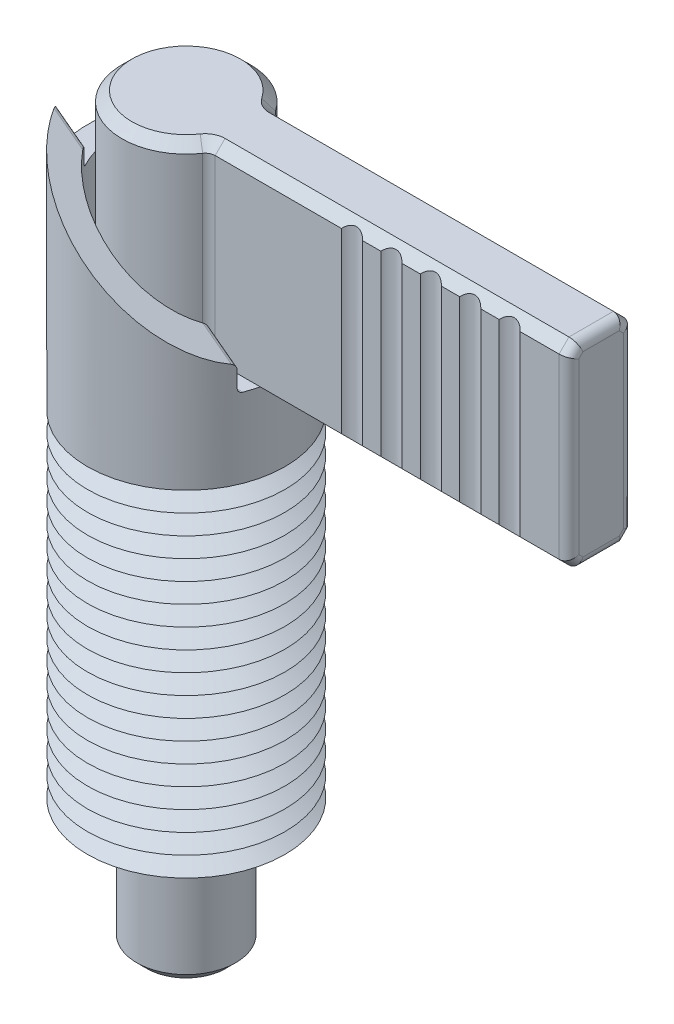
ISO-10303-21;
HEADER;
FILE_DESCRIPTION(('STEP AP214'),'2;1');
FILE_NAME('part.step','',(''),(''),'','','');
FILE_SCHEMA(('AUTOMOTIVE_DESIGN { 1 0 10303 214 1 1 1 1 }'));
ENDSEC;
DATA;
#1=APPLICATION_CONTEXT('core data for automotive mechanical design processes');
#2=APPLICATION_PROTOCOL_DEFINITION('international standard','automotive_design',2000,#1);
#3=PRODUCT_CONTEXT('',#1,'mechanical');
#4=PRODUCT('Part','Part','',(#3));
#5=PRODUCT_RELATED_PRODUCT_CATEGORY('part','',(#4));
#6=PRODUCT_DEFINITION_FORMATION('','',#4);
#7=PRODUCT_DEFINITION_CONTEXT('part definition',#1,'design');
#8=PRODUCT_DEFINITION('design','',#6,#7);
#9=PRODUCT_DEFINITION_SHAPE('','',#8);
#10=(LENGTH_UNIT() NAMED_UNIT(*) SI_UNIT(.MILLI.,.METRE.));
#11=(NAMED_UNIT(*) PLANE_ANGLE_UNIT() SI_UNIT($,.RADIAN.));
#12=(NAMED_UNIT(*) SI_UNIT($,.STERADIAN.) SOLID_ANGLE_UNIT());
#13=UNCERTAINTY_MEASURE_WITH_UNIT(LENGTH_MEASURE(1.E-05),#10,'distance_accuracy_value','');
#14=(GEOMETRIC_REPRESENTATION_CONTEXT(3) GLOBAL_UNCERTAINTY_ASSIGNED_CONTEXT((#13)) GLOBAL_UNIT_ASSIGNED_CONTEXT((#10,
#11,#12)) REPRESENTATION_CONTEXT('',''));
#15=CARTESIAN_POINT('',(0.,0.,0.));
#16=DIRECTION('',(0.,0.,1.));
#17=DIRECTION('',(1.,0.,0.));
#18=AXIS2_PLACEMENT_3D('',#15,#16,#17);
#19=CARTESIAN_POINT('',(2.81458256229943,3.0264538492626,1.625));
#20=DIRECTION('',(0.,0.,1.));
#21=DIRECTION('',(1.,0.,0.));
#22=AXIS2_PLACEMENT_3D('',#19,#20,#21);
#23=PLANE('',#22);
#24=DIRECTION('',(0.,1.,0.));
#25=VECTOR('',#24,1.);
#26=CARTESIAN_POINT('',(10.55198504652,-6.,1.625));
#27=LINE('',#26,#25);
#28=CARTESIAN_POINT('',(10.55198504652,22.0005,1.625));
#29=VERTEX_POINT('',#28);
#30=CARTESIAN_POINT('',(10.55198504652,30.9995,1.625));
#31=VERTEX_POINT('',#30);
#32=EDGE_CURVE('P0_E200',#29,#31,#27,.T.);
#33=ORIENTED_EDGE('',*,*,#32,.F.);
#34=DIRECTION('',(1.,0.,0.));
#35=VECTOR('',#34,1.);
#36=CARTESIAN_POINT('',(21.,22.0005,1.625));
#37=LINE('',#36,#35);
#38=CARTESIAN_POINT('',(11.47701495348,22.0005,1.625));
#39=VERTEX_POINT('',#38);
#40=EDGE_CURVE('P0_E209',#29,#39,#37,.T.);
#41=ORIENTED_EDGE('',*,*,#40,.T.);
#42=DIRECTION('',(0.,1.,0.));
#43=VECTOR('',#42,1.);
#44=CARTESIAN_POINT('',(11.47701495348,-6.,1.625));
#45=LINE('',#44,#43);
#46=CARTESIAN_POINT('',(11.47701495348,30.9995,1.625));
#47=VERTEX_POINT('',#46);
#48=EDGE_CURVE('P0_E210',#39,#47,#45,.T.);
#49=ORIENTED_EDGE('',*,*,#48,.T.);
#50=DIRECTION('',(-1.,0.,0.));
#51=VECTOR('',#50,1.);
#52=CARTESIAN_POINT('',(3.09006472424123,30.9995,1.625));
#53=LINE('',#52,#51);
#54=EDGE_CURVE('P0_E236',#47,#31,#53,.T.);
#55=ORIENTED_EDGE('',*,*,#54,.T.);
#56=EDGE_LOOP('',(#33,#41,#49,#55));
#57=FACE_BOUND('',#56,.T.);
#58=ADVANCED_FACE('P0_F16',(#57),#23,.T.);
#59=DIRECTION('',(0.,1.,0.));
#60=VECTOR('',#59,1.);
#61=CARTESIAN_POINT('',(12.54698504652,-6.,1.625));
#62=LINE('',#61,#60);
#63=CARTESIAN_POINT('',(12.54698504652,22.0005,1.625));
#64=VERTEX_POINT('',#63);
#65=CARTESIAN_POINT('',(12.54698504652,30.9995,1.625));
#66=VERTEX_POINT('',#65);
#67=EDGE_CURVE('P0_E299',#64,#66,#62,.T.);
#68=ORIENTED_EDGE('',*,*,#67,.F.);
#69=CARTESIAN_POINT('',(13.47201495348,22.0005,1.625));
#70=VERTEX_POINT('',#69);
#71=EDGE_CURVE('P0_E221',#64,#70,#37,.T.);
#72=ORIENTED_EDGE('',*,*,#71,.T.);
#73=DIRECTION('',(0.,1.,0.));
#74=VECTOR('',#73,1.);
#75=CARTESIAN_POINT('',(13.47201495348,-6.,1.625));
#76=LINE('',#75,#74);
#77=CARTESIAN_POINT('',(13.47201495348,30.9995,1.625));
#78=VERTEX_POINT('',#77);
#79=EDGE_CURVE('P0_E293',#70,#78,#76,.T.);
#80=ORIENTED_EDGE('',*,*,#79,.T.);
#81=EDGE_CURVE('P0_E239',#78,#66,#53,.T.);
#82=ORIENTED_EDGE('',*,*,#81,.T.);
#83=EDGE_LOOP('',(#68,#72,#80,#82));
#84=FACE_BOUND('',#83,.T.);
#85=ADVANCED_FACE('P0_F496',(#84),#23,.T.);
#86=DIRECTION('',(0.,1.,0.));
#87=VECTOR('',#86,1.);
#88=CARTESIAN_POINT('',(14.54198504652,-6.,1.625));
#89=LINE('',#88,#87);
#90=CARTESIAN_POINT('',(14.54198504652,22.0005,1.625));
#91=VERTEX_POINT('',#90);
#92=CARTESIAN_POINT('',(14.54198504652,30.9995,1.625));
#93=VERTEX_POINT('',#92);
#94=EDGE_CURVE('P0_E292',#91,#93,#89,.T.);
#95=ORIENTED_EDGE('',*,*,#94,.F.);
#96=CARTESIAN_POINT('',(15.46701495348,22.0005,1.625));
#97=VERTEX_POINT('',#96);
#98=EDGE_CURVE('P0_E228',#91,#97,#37,.T.);
#99=ORIENTED_EDGE('',*,*,#98,.T.);
#100=DIRECTION('',(0.,1.,0.));
#101=VECTOR('',#100,1.);
#102=CARTESIAN_POINT('',(15.46701495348,-6.,1.625));
#103=LINE('',#102,#101);
#104=CARTESIAN_POINT('',(15.46701495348,30.9995,1.625));
#105=VERTEX_POINT('',#104);
#106=EDGE_CURVE('P0_E286',#97,#105,#103,.T.);
#107=ORIENTED_EDGE('',*,*,#106,.T.);
#108=EDGE_CURVE('P0_E234',#105,#93,#53,.T.);
#109=ORIENTED_EDGE('',*,*,#108,.T.);
#110=EDGE_LOOP('',(#95,#99,#107,#109));
#111=FACE_BOUND('',#110,.T.);
#112=ADVANCED_FACE('P0_F324',(#111),#23,.T.);
#113=DIRECTION('',(0.,1.,0.));
#114=VECTOR('',#113,1.);
#115=CARTESIAN_POINT('',(16.53698504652,-6.,1.625));
#116=LINE('',#115,#114);
#117=CARTESIAN_POINT('',(16.53698504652,22.0005,1.625));
#118=VERTEX_POINT('',#117);
#119=CARTESIAN_POINT('',(16.53698504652,30.9995,1.625));
#120=VERTEX_POINT('',#119);
#121=EDGE_CURVE('P0_E285',#118,#120,#116,.T.);
#122=ORIENTED_EDGE('',*,*,#121,.F.);
#123=CARTESIAN_POINT('',(17.46201495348,22.0005,1.625));
#124=VERTEX_POINT('',#123);
#125=EDGE_CURVE('P0_E223',#118,#124,#37,.T.);
#126=ORIENTED_EDGE('',*,*,#125,.T.);
#127=DIRECTION('',(0.,1.,0.));
#128=VECTOR('',#127,1.);
#129=CARTESIAN_POINT('',(17.46201495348,-6.,1.625));
#130=LINE('',#129,#128);
#131=CARTESIAN_POINT('',(17.46201495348,30.9995,1.625));
#132=VERTEX_POINT('',#131);
#133=EDGE_CURVE('P0_E279',#124,#132,#130,.T.);
#134=ORIENTED_EDGE('',*,*,#133,.T.);
#135=EDGE_CURVE('P0_E229',#132,#120,#53,.T.);
#136=ORIENTED_EDGE('',*,*,#135,.T.);
#137=EDGE_LOOP('',(#122,#126,#134,#136));
#138=FACE_BOUND('',#137,.T.);
#139=ADVANCED_FACE('P0_F337',(#138),#23,.T.);
#140=CARTESIAN_POINT('',(18.53198504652,22.0005,1.625));
#141=VERTEX_POINT('',#140);
#142=CARTESIAN_POINT('',(20.4995,22.0005,1.625));
#143=VERTEX_POINT('',#142);
#144=EDGE_CURVE('P0_E218',#141,#143,#37,.T.);
#145=ORIENTED_EDGE('',*,*,#144,.T.);
#146=DIRECTION('',(0.,1.,0.));
#147=VECTOR('',#146,1.);
#148=CARTESIAN_POINT('',(20.4995,3.0264538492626,1.625));
#149=LINE('',#148,#147);
#150=CARTESIAN_POINT('',(20.4995,30.9995,1.625));
#151=VERTEX_POINT('',#150);
#152=EDGE_CURVE('P0_E11',#143,#151,#149,.T.);
#153=ORIENTED_EDGE('',*,*,#152,.T.);
#154=CARTESIAN_POINT('',(18.53198504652,30.9995,1.625));
#155=VERTEX_POINT('',#154);
#156=EDGE_CURVE('P0_E224',#151,#155,#53,.T.);
#157=ORIENTED_EDGE('',*,*,#156,.T.);
#158=DIRECTION('',(0.,1.,0.));
#159=VECTOR('',#158,1.);
#160=CARTESIAN_POINT('',(18.53198504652,-6.,1.625));
#161=LINE('',#160,#159);
#162=EDGE_CURVE('P0_E278',#141,#155,#161,.T.);
#163=ORIENTED_EDGE('',*,*,#162,.F.);
#164=EDGE_LOOP('',(#145,#153,#157,#163));
#165=FACE_BOUND('',#164,.T.);
#166=ADVANCED_FACE('P0_F506',(#165),#23,.T.);
#167=CARTESIAN_POINT('',(0.,-6.,0.));
#168=DIRECTION('',(0.,1.,0.));
#169=DIRECTION('',(0.,0.,1.));
#170=AXIS2_PLACEMENT_3D('',#167,#168,#169);
#171=PLANE('',#170);
#172=CARTESIAN_POINT('',(0.,-6.,0.));
#173=DIRECTION('',(0.,-1.,0.));
#174=DIRECTION('',(0.,0.,-1.));
#175=AXIS2_PLACEMENT_3D('',#172,#173,#174);
#176=CIRCLE('',#175,2.);
#177=CARTESIAN_POINT('',(0.,-6.,-2.));
#178=VERTEX_POINT('',#177);
#179=EDGE_CURVE('P0_E259',#178,#178,#176,.T.);
#180=ORIENTED_EDGE('',*,*,#179,.T.);
#181=EDGE_LOOP('',(#180));
#182=FACE_BOUND('',#181,.T.);
#183=ADVANCED_FACE('P0_F516',(#182),#171,.F.);
#184=CARTESIAN_POINT('',(0.,-5.5,0.));
#185=DIRECTION('',(0.,1.,0.));
#186=DIRECTION('',(0.,0.,1.));
#187=AXIS2_PLACEMENT_3D('',#184,#185,#186);
#188=CONICAL_SURFACE('',#187,2.5,0.785398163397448);
#189=ORIENTED_EDGE('',*,*,#179,.F.);
#190=EDGE_LOOP('',(#189));
#191=FACE_BOUND('',#190,.T.);
#192=CARTESIAN_POINT('',(0.,-5.5,0.));
#193=DIRECTION('',(0.,-1.,0.));
#194=DIRECTION('',(0.,0.,-1.));
#195=AXIS2_PLACEMENT_3D('',#192,#193,#194);
#196=CIRCLE('',#195,2.5);
#197=CARTESIAN_POINT('',(0.,-5.5,-2.5));
#198=VERTEX_POINT('',#197);
#199=EDGE_CURVE('P0_E262',#198,#198,#196,.T.);
#200=ORIENTED_EDGE('',*,*,#199,.T.);
#201=EDGE_LOOP('',(#200));
#202=FACE_BOUND('',#201,.T.);
#203=ADVANCED_FACE('P0_F521',(#191,#202),#188,.T.);
#204=CARTESIAN_POINT('',(0.,-6.,0.));
#205=DIRECTION('',(0.,-1.,0.));
#206=DIRECTION('',(0.,0.,-1.));
#207=AXIS2_PLACEMENT_3D('',#204,#205,#206);
#208=CYLINDRICAL_SURFACE('',#207,2.5);
#209=ORIENTED_EDGE('',*,*,#199,.F.);
#210=EDGE_LOOP('',(#209));
#211=FACE_BOUND('',#210,.T.);
#212=CARTESIAN_POINT('',(0.,4.75,0.));
#213=DIRECTION('',(0.,-1.,0.));
#214=DIRECTION('',(0.,0.,-1.));
#215=AXIS2_PLACEMENT_3D('',#212,#213,#214);
#216=CIRCLE('',#215,2.5);
#217=CARTESIAN_POINT('',(0.,4.75,-2.5));
#218=VERTEX_POINT('',#217);
#219=EDGE_CURVE('P0_E265',#218,#218,#216,.T.);
#220=ORIENTED_EDGE('',*,*,#219,.T.);
#221=EDGE_LOOP('',(#220));
#222=FACE_BOUND('',#221,.T.);
#223=ADVANCED_FACE('P0_F555',(#211,#222),#208,.T.);
#224=CARTESIAN_POINT('',(-2.5,4.75,0.));
#225=DIRECTION('',(0.,-1.,0.));
#226=DIRECTION('',(0.,0.,-1.));
#227=AXIS2_PLACEMENT_3D('',#224,#225,#226);
#228=PLANE('',#227);
#229=ORIENTED_EDGE('',*,*,#219,.F.);
#230=EDGE_LOOP('',(#229));
#231=FACE_BOUND('',#230,.T.);
#232=CARTESIAN_POINT('',(0.,4.75,0.));
#233=DIRECTION('',(0.,-1.,0.));
#234=DIRECTION('',(0.,0.,-1.));
#235=AXIS2_PLACEMENT_3D('',#232,#233,#234);
#236=CIRCLE('',#235,1.875);
#237=CARTESIAN_POINT('',(0.,4.75,-1.875));
#238=VERTEX_POINT('',#237);
#239=EDGE_CURVE('P0_E268',#238,#238,#236,.T.);
#240=ORIENTED_EDGE('',*,*,#239,.T.);
#241=EDGE_LOOP('',(#240));
#242=FACE_BOUND('',#241,.T.);
#243=ADVANCED_FACE('P0_F563',(#231,#242),#228,.F.);
#244=CARTESIAN_POINT('',(0.,-6.,0.));
#245=DIRECTION('',(0.,-1.,0.));
#246=DIRECTION('',(0.,0.,-1.));
#247=AXIS2_PLACEMENT_3D('',#244,#245,#246);
#248=CYLINDRICAL_SURFACE('',#247,1.875);
#249=ORIENTED_EDGE('',*,*,#239,.F.);
#250=EDGE_LOOP('',(#249));
#251=FACE_BOUND('',#250,.T.);
#252=CARTESIAN_POINT('',(0.,21.5,0.));
#253=DIRECTION('',(0.,-1.,0.));
#254=DIRECTION('',(0.,0.,-1.));
#255=AXIS2_PLACEMENT_3D('',#252,#253,#254);
#256=CIRCLE('',#255,1.875);
#257=CARTESIAN_POINT('',(0.,21.5,-1.875));
#258=VERTEX_POINT('',#257);
#259=EDGE_CURVE('P0_E271',#258,#258,#256,.T.);
#260=ORIENTED_EDGE('',*,*,#259,.T.);
#261=EDGE_LOOP('',(#260));
#262=FACE_BOUND('',#261,.T.);
#263=ADVANCED_FACE('P0_F571',(#251,#262),#248,.T.);
#264=CARTESIAN_POINT('',(-1.875,21.5,0.));
#265=DIRECTION('',(0.,1.,0.));
#266=DIRECTION('',(0.,0.,1.));
#267=AXIS2_PLACEMENT_3D('',#264,#265,#266);
#268=PLANE('',#267);
#269=ORIENTED_EDGE('',*,*,#259,.F.);
#270=EDGE_LOOP('',(#269));
#271=FACE_BOUND('',#270,.T.);
#272=DIRECTION('',(1.,0.,0.));
#273=VECTOR('',#272,1.);
#274=CARTESIAN_POINT('',(21.,21.5,-1.1245));
#275=LINE('',#274,#273);
#276=CARTESIAN_POINT('',(3.09006472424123,21.5,-1.1245));
#277=VERTEX_POINT('',#276);
#278=CARTESIAN_POINT('',(20.4995,21.5,-1.1245));
#279=VERTEX_POINT('',#278);
#280=EDGE_CURVE('P0_E247',#277,#279,#275,.T.);
#281=ORIENTED_EDGE('',*,*,#280,.T.);
#282=DIRECTION('',(0.,0.,1.));
#283=VECTOR('',#282,1.);
#284=CARTESIAN_POINT('',(20.4995,21.5,1.12450000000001));
#285=LINE('',#284,#283);
#286=CARTESIAN_POINT('',(20.4995,21.5,1.1245));
#287=VERTEX_POINT('',#286);
#288=EDGE_CURVE('P0_E40',#279,#287,#285,.T.);
#289=ORIENTED_EDGE('',*,*,#288,.T.);
#290=DIRECTION('',(-1.,0.,0.));
#291=VECTOR('',#290,1.);
#292=CARTESIAN_POINT('',(3.09006472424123,21.5,1.1245));
#293=LINE('',#292,#291);
#294=CARTESIAN_POINT('',(3.09006472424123,21.5,1.1245));
#295=VERTEX_POINT('',#294);
#296=EDGE_CURVE('P0_E237',#287,#295,#293,.T.);
#297=ORIENTED_EDGE('',*,*,#296,.T.);
#298=CARTESIAN_POINT('',(3.09006472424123,21.5,2.1255));
#299=DIRECTION('',(0.,1.,0.));
#300=DIRECTION('',(0.,0.,1.));
#301=AXIS2_PLACEMENT_3D('',#298,#299,#300);
#302=CIRCLE('',#301,1.001);
#303=CARTESIAN_POINT('',(2.26533341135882,21.5,1.55820883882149));
#304=VERTEX_POINT('',#303);
#305=EDGE_CURVE('P0_E240',#295,#304,#302,.T.);
#306=ORIENTED_EDGE('',*,*,#305,.T.);
#307=CARTESIAN_POINT('',(0.,21.5,0.));
#308=DIRECTION('',(0.,1.,0.));
#309=DIRECTION('',(0.,0.,1.));
#310=AXIS2_PLACEMENT_3D('',#307,#308,#309);
#311=CIRCLE('',#310,2.7495);
#312=CARTESIAN_POINT('',(2.26533341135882,21.5,-1.55820883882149));
#313=VERTEX_POINT('',#312);
#314=EDGE_CURVE('P0_E241',#304,#313,#311,.F.);
#315=ORIENTED_EDGE('',*,*,#314,.T.);
#316=CARTESIAN_POINT('',(3.09006472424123,21.5,-2.1255));
#317=DIRECTION('',(0.,1.,0.));
#318=DIRECTION('',(0.,0.,1.));
#319=AXIS2_PLACEMENT_3D('',#316,#317,#318);
#320=CIRCLE('',#319,1.001);
#321=EDGE_CURVE('P0_E245',#313,#277,#320,.T.);
#322=ORIENTED_EDGE('',*,*,#321,.T.);
#323=EDGE_LOOP('',(#281,#289,#297,#306,#315,#322));
#324=FACE_BOUND('',#323,.T.);
#325=ADVANCED_FACE('P0_F422',(#271,#324),#268,.F.);
#326=CARTESIAN_POINT('',(0.,-6.,0.));
#327=DIRECTION('',(0.,-1.,0.));
#328=DIRECTION('',(0.,0.,-1.));
#329=AXIS2_PLACEMENT_3D('',#326,#327,#328);
#330=CYLINDRICAL_SURFACE('',#329,3.25);
#331=DIRECTION('',(0.,-1.,0.));
#332=VECTOR('',#331,1.);
#333=CARTESIAN_POINT('',(2.67769906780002,-6.,-1.84185441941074));
#334=LINE('',#333,#332);
#335=CARTESIAN_POINT('',(2.67769906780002,30.9995,-1.84185441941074));
#336=VERTEX_POINT('',#335);
#337=CARTESIAN_POINT('',(2.67769906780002,22.0005,-1.84185441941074));
#338=VERTEX_POINT('',#337);
#339=EDGE_CURVE('P0_E250',#336,#338,#334,.T.);
#340=ORIENTED_EDGE('',*,*,#339,.T.);
#341=CARTESIAN_POINT('',(0.,22.0005,0.));
#342=DIRECTION('',(0.,1.,0.));
#343=DIRECTION('',(0.,0.,1.));
#344=AXIS2_PLACEMENT_3D('',#341,#342,#343);
#345=CIRCLE('',#344,3.25);
#346=CARTESIAN_POINT('',(2.67769906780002,22.0005,1.84185441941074));
#347=VERTEX_POINT('',#346);
#348=EDGE_CURVE('P0_E436',#338,#347,#345,.T.);
#349=ORIENTED_EDGE('',*,*,#348,.T.);
#350=DIRECTION('',(0.,-1.,0.));
#351=VECTOR('',#350,1.);
#352=CARTESIAN_POINT('',(2.67769906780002,-6.,1.84185441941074));
#353=LINE('',#352,#351);
#354=CARTESIAN_POINT('',(2.67769906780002,30.9995,1.84185441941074));
#355=VERTEX_POINT('',#354);
#356=EDGE_CURVE('P0_E253',#347,#355,#353,.F.);
#357=ORIENTED_EDGE('',*,*,#356,.T.);
#358=CARTESIAN_POINT('',(0.,30.9995,0.));
#359=DIRECTION('',(0.,-1.,0.));
#360=DIRECTION('',(0.,0.,-1.));
#361=AXIS2_PLACEMENT_3D('',#358,#359,#360);
#362=CIRCLE('',#361,3.25);
#363=EDGE_CURVE('P0_E476',#355,#336,#362,.T.);
#364=ORIENTED_EDGE('',*,*,#363,.T.);
#365=EDGE_LOOP('',(#340,#349,#357,#364));
#366=FACE_BOUND('',#365,.T.);
#367=ADVANCED_FACE('P0_F586',(#366),#330,.T.);
#368=CARTESIAN_POINT('',(-3.25,31.5,0.));
#369=DIRECTION('',(0.,-1.,0.));
#370=DIRECTION('',(0.,0.,-1.));
#371=AXIS2_PLACEMENT_3D('',#368,#369,#370);
#372=PLANE('',#371);
#373=DIRECTION('',(1.,0.,0.));
#374=VECTOR('',#373,1.);
#375=CARTESIAN_POINT('',(21.,31.5,1.1245));
#376=LINE('',#375,#374);
#377=CARTESIAN_POINT('',(3.09006472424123,31.5,1.1245));
#378=VERTEX_POINT('',#377);
#379=CARTESIAN_POINT('',(20.4995,31.5,1.1245));
#380=VERTEX_POINT('',#379);
#381=EDGE_CURVE('P0_E343',#378,#380,#376,.T.);
#382=ORIENTED_EDGE('',*,*,#381,.T.);
#383=DIRECTION('',(0.,0.,-1.));
#384=VECTOR('',#383,1.);
#385=CARTESIAN_POINT('',(20.4995,31.5,-1.12449999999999));
#386=LINE('',#385,#384);
#387=CARTESIAN_POINT('',(20.4995,31.5,-1.1245));
#388=VERTEX_POINT('',#387);
#389=EDGE_CURVE('P0_E375',#380,#388,#386,.T.);
#390=ORIENTED_EDGE('',*,*,#389,.T.);
#391=DIRECTION('',(-1.,0.,0.));
#392=VECTOR('',#391,1.);
#393=CARTESIAN_POINT('',(3.09006472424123,31.5,-1.1245));
#394=LINE('',#393,#392);
#395=CARTESIAN_POINT('',(3.09006472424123,31.5,-1.1245));
#396=VERTEX_POINT('',#395);
#397=EDGE_CURVE('P0_E465',#388,#396,#394,.T.);
#398=ORIENTED_EDGE('',*,*,#397,.T.);
#399=CARTESIAN_POINT('',(3.09006472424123,31.5,-2.1255));
#400=DIRECTION('',(0.,-1.,0.));
#401=DIRECTION('',(0.,0.,-1.));
#402=AXIS2_PLACEMENT_3D('',#399,#400,#401);
#403=CIRCLE('',#402,1.001);
#404=CARTESIAN_POINT('',(2.26533341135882,31.5,-1.55820883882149));
#405=VERTEX_POINT('',#404);
#406=EDGE_CURVE('P0_E463',#396,#405,#403,.T.);
#407=ORIENTED_EDGE('',*,*,#406,.T.);
#408=CARTESIAN_POINT('',(0.,31.5,0.));
#409=DIRECTION('',(0.,-1.,0.));
#410=DIRECTION('',(0.,0.,-1.));
#411=AXIS2_PLACEMENT_3D('',#408,#409,#410);
#412=CIRCLE('',#411,2.7495);
#413=CARTESIAN_POINT('',(2.26533341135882,31.5,1.55820883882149));
#414=VERTEX_POINT('',#413);
#415=EDGE_CURVE('P0_E461',#405,#414,#412,.F.);
#416=ORIENTED_EDGE('',*,*,#415,.T.);
#417=CARTESIAN_POINT('',(3.09006472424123,31.5,2.1255));
#418=DIRECTION('',(0.,-1.,0.));
#419=DIRECTION('',(0.,0.,-1.));
#420=AXIS2_PLACEMENT_3D('',#417,#418,#419);
#421=CIRCLE('',#420,1.001);
#422=EDGE_CURVE('P0_E348',#414,#378,#421,.T.);
#423=ORIENTED_EDGE('',*,*,#422,.T.);
#424=EDGE_LOOP('',(#382,#390,#398,#407,#416,#423));
#425=FACE_BOUND('',#424,.T.);
#426=ADVANCED_FACE('P0_F594',(#425),#372,.F.);
#427=CARTESIAN_POINT('',(2.81458256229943,3.0264538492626,-1.625));
#428=DIRECTION('',(0.,0.,-1.));
#429=DIRECTION('',(-1.,0.,0.));
#430=AXIS2_PLACEMENT_3D('',#427,#428,#429);
#431=PLANE('',#430);
#432=DIRECTION('',(1.,0.,0.));
#433=VECTOR('',#432,1.);
#434=CARTESIAN_POINT('',(21.,30.9995,-1.625));
#435=LINE('',#434,#433);
#436=CARTESIAN_POINT('',(3.09006472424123,30.9995,-1.625));
#437=VERTEX_POINT('',#436);
#438=CARTESIAN_POINT('',(20.4995,30.9995,-1.625));
#439=VERTEX_POINT('',#438);
#440=EDGE_CURVE('P0_E468',#437,#439,#435,.T.);
#441=ORIENTED_EDGE('',*,*,#440,.T.);
#442=DIRECTION('',(0.,1.,0.));
#443=VECTOR('',#442,1.);
#444=CARTESIAN_POINT('',(20.4995,3.0264538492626,-1.625));
#445=LINE('',#444,#443);
#446=CARTESIAN_POINT('',(20.4995,22.0005,-1.625));
#447=VERTEX_POINT('',#446);
#448=EDGE_CURVE('P0_E379',#439,#447,#445,.F.);
#449=ORIENTED_EDGE('',*,*,#448,.T.);
#450=DIRECTION('',(-1.,0.,0.));
#451=VECTOR('',#450,1.);
#452=CARTESIAN_POINT('',(3.09006472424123,22.0005,-1.625));
#453=LINE('',#452,#451);
#454=CARTESIAN_POINT('',(3.09006472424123,22.0005,-1.625));
#455=VERTEX_POINT('',#454);
#456=EDGE_CURVE('P0_E421',#447,#455,#453,.T.);
#457=ORIENTED_EDGE('',*,*,#456,.T.);
#458=DIRECTION('',(0.,-1.,0.));
#459=VECTOR('',#458,1.);
#460=CARTESIAN_POINT('',(3.09006472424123,3.0264538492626,-1.625));
#461=LINE('',#460,#459);
#462=EDGE_CURVE('P0_E256',#455,#437,#461,.F.);
#463=ORIENTED_EDGE('',*,*,#462,.T.);
#464=EDGE_LOOP('',(#441,#449,#457,#463));
#465=FACE_BOUND('',#464,.T.);
#466=ADVANCED_FACE('P0_F513',(#465),#431,.T.);
#467=CARTESIAN_POINT('',(21.,3.0264538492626,1.625));
#468=DIRECTION('',(1.,0.,0.));
#469=DIRECTION('',(0.,0.,-1.));
#470=AXIS2_PLACEMENT_3D('',#467,#468,#469);
#471=PLANE('',#470);
#472=DIRECTION('',(0.,0.,-1.));
#473=VECTOR('',#472,1.);
#474=CARTESIAN_POINT('',(21.,30.9995,1.12449999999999));
#475=LINE('',#474,#473);
#476=CARTESIAN_POINT('',(21.,30.9995,-0.917186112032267));
#477=VERTEX_POINT('',#476);
#478=CARTESIAN_POINT('',(21.,30.9995,0.917186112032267));
#479=VERTEX_POINT('',#478);
#480=EDGE_CURVE('P0_E367',#477,#479,#475,.F.);
#481=ORIENTED_EDGE('',*,*,#480,.T.);
#482=DIRECTION('',(0.,-0.707106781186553,0.707106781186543));
#483=VECTOR('',#482,1.);
#484=CARTESIAN_POINT('',(21.,16.6590699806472,15.2576161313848));
#485=LINE('',#484,#483);
#486=CARTESIAN_POINT('',(21.,30.7921861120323,1.1245));
#487=VERTEX_POINT('',#486);
#488=EDGE_CURVE('P0_E369',#479,#487,#485,.T.);
#489=ORIENTED_EDGE('',*,*,#488,.T.);
#490=DIRECTION('',(0.,1.,0.));
#491=VECTOR('',#490,1.);
#492=CARTESIAN_POINT('',(21.,3.0264538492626,1.1245));
#493=LINE('',#492,#491);
#494=CARTESIAN_POINT('',(21.,22.2078138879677,1.1245));
#495=VERTEX_POINT('',#494);
#496=EDGE_CURVE('P0_E309',#487,#495,#493,.F.);
#497=ORIENTED_EDGE('',*,*,#496,.T.);
#498=DIRECTION('',(0.,-0.707106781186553,-0.707106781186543));
#499=VECTOR('',#498,1.);
#500=CARTESIAN_POINT('',(21.,12.867383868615,-8.21593001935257));
#501=LINE('',#500,#499);
#502=CARTESIAN_POINT('',(21.,22.0005,0.917186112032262));
#503=VERTEX_POINT('',#502);
#504=EDGE_CURVE('P0_E357',#495,#503,#501,.T.);
#505=ORIENTED_EDGE('',*,*,#504,.T.);
#506=DIRECTION('',(0.,0.,1.));
#507=VECTOR('',#506,1.);
#508=CARTESIAN_POINT('',(21.,22.0005,-1.1245));
#509=LINE('',#508,#507);
#510=CARTESIAN_POINT('',(21.,22.0005,-0.91718611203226));
#511=VERTEX_POINT('',#510);
#512=EDGE_CURVE('P0_E359',#503,#511,#509,.F.);
#513=ORIENTED_EDGE('',*,*,#512,.T.);
#514=DIRECTION('',(0.,0.707106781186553,-0.707106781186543));
#515=VECTOR('',#514,1.);
#516=CARTESIAN_POINT('',(21.,11.242383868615,9.84093001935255));
#517=LINE('',#516,#515);
#518=CARTESIAN_POINT('',(21.,22.2078138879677,-1.1245));
#519=VERTEX_POINT('',#518);
#520=EDGE_CURVE('P0_E361',#511,#519,#517,.T.);
#521=ORIENTED_EDGE('',*,*,#520,.T.);
#522=DIRECTION('',(0.,1.,0.));
#523=VECTOR('',#522,1.);
#524=CARTESIAN_POINT('',(21.,3.0264538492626,-1.1245));
#525=LINE('',#524,#523);
#526=CARTESIAN_POINT('',(21.,30.7921861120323,-1.1245));
#527=VERTEX_POINT('',#526);
#528=EDGE_CURVE('P0_E363',#519,#527,#525,.T.);
#529=ORIENTED_EDGE('',*,*,#528,.T.);
#530=DIRECTION('',(0.,0.707106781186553,0.707106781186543));
#531=VECTOR('',#530,1.);
#532=CARTESIAN_POINT('',(21.,18.2840699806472,-13.6326161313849));
#533=LINE('',#532,#531);
#534=EDGE_CURVE('P0_E365',#527,#477,#533,.T.);
#535=ORIENTED_EDGE('',*,*,#534,.T.);
#536=EDGE_LOOP('',(#481,#489,#497,#505,#513,#521,#529,#535));
#537=FACE_BOUND('',#536,.T.);
#538=ADVANCED_FACE('P0_F505',(#537),#471,.T.);
#539=DIRECTION('',(0.,1.,0.));
#540=VECTOR('',#539,1.);
#541=CARTESIAN_POINT('',(9.48201495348,-6.,1.625));
#542=LINE('',#541,#540);
#543=CARTESIAN_POINT('',(9.48201495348,22.0005,1.625));
#544=VERTEX_POINT('',#543);
#545=CARTESIAN_POINT('',(9.48201495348,30.9995,1.625));
#546=VERTEX_POINT('',#545);
#547=EDGE_CURVE('P0_E190',#544,#546,#542,.T.);
#548=ORIENTED_EDGE('',*,*,#547,.T.);
#549=CARTESIAN_POINT('',(3.09006472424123,30.9995,1.625));
#550=VERTEX_POINT('',#549);
#551=EDGE_CURVE('P0_E230',#546,#550,#53,.T.);
#552=ORIENTED_EDGE('',*,*,#551,.T.);
#553=DIRECTION('',(0.,-1.,0.));
#554=VECTOR('',#553,1.);
#555=CARTESIAN_POINT('',(3.09006472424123,3.0264538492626,1.625));
#556=LINE('',#555,#554);
#557=CARTESIAN_POINT('',(3.09006472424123,22.0005,1.625));
#558=VERTEX_POINT('',#557);
#559=EDGE_CURVE('P0_E215',#550,#558,#556,.T.);
#560=ORIENTED_EDGE('',*,*,#559,.T.);
#561=EDGE_CURVE('P0_E206',#558,#544,#37,.T.);
#562=ORIENTED_EDGE('',*,*,#561,.T.);
#563=EDGE_LOOP('',(#548,#552,#560,#562));
#564=FACE_BOUND('',#563,.T.);
#565=ADVANCED_FACE('P0_F213',(#564),#23,.T.);
#566=CARTESIAN_POINT('',(3.09006472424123,-6.,-2.1255));
#567=DIRECTION('',(0.,-1.,0.));
#568=DIRECTION('',(0.,0.,-1.));
#569=AXIS2_PLACEMENT_3D('',#566,#567,#568);
#570=CYLINDRICAL_SURFACE('',#569,0.5005);
#571=ORIENTED_EDGE('',*,*,#462,.F.);
#572=CARTESIAN_POINT('',(3.09006472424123,22.0005,-2.1255));
#573=DIRECTION('',(0.,1.,0.));
#574=DIRECTION('',(0.,0.,1.));
#575=AXIS2_PLACEMENT_3D('',#572,#573,#574);
#576=CIRCLE('',#575,0.5005);
#577=EDGE_CURVE('P0_E471',#455,#338,#576,.F.);
#578=ORIENTED_EDGE('',*,*,#577,.T.);
#579=ORIENTED_EDGE('',*,*,#339,.F.);
#580=CARTESIAN_POINT('',(3.09006472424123,30.9995,-2.1255));
#581=DIRECTION('',(0.,-1.,0.));
#582=DIRECTION('',(0.,0.,-1.));
#583=AXIS2_PLACEMENT_3D('',#580,#581,#582);
#584=CIRCLE('',#583,0.5005);
#585=EDGE_CURVE('P0_E473',#336,#437,#584,.F.);
#586=ORIENTED_EDGE('',*,*,#585,.T.);
#587=EDGE_LOOP('',(#571,#578,#579,#586));
#588=FACE_BOUND('',#587,.T.);
#589=ADVANCED_FACE('P0_F504',(#588),#570,.F.);
#590=CARTESIAN_POINT('',(3.09006472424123,-6.,2.1255));
#591=DIRECTION('',(0.,-1.,0.));
#592=DIRECTION('',(0.,0.,-1.));
#593=AXIS2_PLACEMENT_3D('',#590,#591,#592);
#594=CYLINDRICAL_SURFACE('',#593,0.5005);
#595=ORIENTED_EDGE('',*,*,#356,.F.);
#596=CARTESIAN_POINT('',(3.09006472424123,22.0005,2.1255));
#597=DIRECTION('',(0.,1.,0.));
#598=DIRECTION('',(0.,0.,1.));
#599=AXIS2_PLACEMENT_3D('',#596,#597,#598);
#600=CIRCLE('',#599,0.5005);
#601=EDGE_CURVE('P0_E219',#347,#558,#600,.F.);
#602=ORIENTED_EDGE('',*,*,#601,.T.);
#603=ORIENTED_EDGE('',*,*,#559,.F.);
#604=CARTESIAN_POINT('',(3.09006472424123,30.9995,2.1255));
#605=DIRECTION('',(0.,-1.,0.));
#606=DIRECTION('',(0.,0.,-1.));
#607=AXIS2_PLACEMENT_3D('',#604,#605,#606);
#608=CIRCLE('',#607,0.5005);
#609=EDGE_CURVE('P0_E216',#550,#355,#608,.F.);
#610=ORIENTED_EDGE('',*,*,#609,.T.);
#611=EDGE_LOOP('',(#595,#602,#603,#610));
#612=FACE_BOUND('',#611,.T.);
#613=ADVANCED_FACE('P0_F481',(#612),#594,.F.);
#614=CARTESIAN_POINT('',(-1.875,21.5,-1.1245));
#615=DIRECTION('',(0.,-0.707106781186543,-0.707106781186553));
#616=DIRECTION('',(0.,0.707106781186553,-0.707106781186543));
#617=AXIS2_PLACEMENT_3D('',#614,#615,#616);
#618=PLANE('',#617);
#619=ORIENTED_EDGE('',*,*,#456,.F.);
#620=DIRECTION('',(0.,0.707106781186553,-0.707106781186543));
#621=VECTOR('',#620,1.);
#622=CARTESIAN_POINT('',(20.4995,21.5,-1.1245));
#623=LINE('',#622,#621);
#624=EDGE_CURVE('P0_E381',#447,#279,#623,.F.);
#625=ORIENTED_EDGE('',*,*,#624,.T.);
#626=ORIENTED_EDGE('',*,*,#280,.F.);
#627=DIRECTION('',(0.,-0.707106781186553,0.707106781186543));
#628=VECTOR('',#627,1.);
#629=CARTESIAN_POINT('',(3.09006472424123,22.0005,-1.625));
#630=LINE('',#629,#628);
#631=EDGE_CURVE('P0_E274',#455,#277,#630,.T.);
#632=ORIENTED_EDGE('',*,*,#631,.F.);
#633=EDGE_LOOP('',(#619,#625,#626,#632));
#634=FACE_BOUND('',#633,.T.);
#635=ADVANCED_FACE('P0_F418',(#634),#618,.T.);
#636=CARTESIAN_POINT('',(3.09006472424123,21.5,-2.1255));
#637=DIRECTION('',(0.,-1.,0.));
#638=DIRECTION('',(0.,0.,-1.));
#639=AXIS2_PLACEMENT_3D('',#636,#637,#638);
#640=CONICAL_SURFACE('',#639,1.001,0.785398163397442);
#641=ORIENTED_EDGE('',*,*,#631,.T.);
#642=ORIENTED_EDGE('',*,*,#321,.F.);
#643=DIRECTION('',(-0.582590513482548,-0.707106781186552,0.400734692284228));
#644=VECTOR('',#643,1.);
#645=CARTESIAN_POINT('',(2.67769906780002,22.0005,-1.84185441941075));
#646=LINE('',#645,#644);
#647=EDGE_CURVE('P0_E430',#338,#313,#646,.T.);
#648=ORIENTED_EDGE('',*,*,#647,.F.);
#649=ORIENTED_EDGE('',*,*,#577,.F.);
#650=EDGE_LOOP('',(#641,#642,#648,#649));
#651=FACE_BOUND('',#650,.T.);
#652=ADVANCED_FACE('P0_F428',(#651),#640,.F.);
#653=CARTESIAN_POINT('',(0.,21.5,0.));
#654=DIRECTION('',(0.,1.,0.));
#655=DIRECTION('',(0.,0.,1.));
#656=AXIS2_PLACEMENT_3D('',#653,#654,#655);
#657=CONICAL_SURFACE('',#656,2.7495,0.785398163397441);
#658=ORIENTED_EDGE('',*,*,#647,.T.);
#659=ORIENTED_EDGE('',*,*,#314,.F.);
#660=DIRECTION('',(-0.582590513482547,-0.707106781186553,-0.400734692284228));
#661=VECTOR('',#660,1.);
#662=CARTESIAN_POINT('',(2.67769906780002,22.0005,1.84185441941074));
#663=LINE('',#662,#661);
#664=EDGE_CURVE('P0_E437',#347,#304,#663,.T.);
#665=ORIENTED_EDGE('',*,*,#664,.F.);
#666=ORIENTED_EDGE('',*,*,#348,.F.);
#667=EDGE_LOOP('',(#658,#659,#665,#666));
#668=FACE_BOUND('',#667,.T.);
#669=ADVANCED_FACE('P0_F433',(#668),#657,.T.);
#670=CARTESIAN_POINT('',(3.09006472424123,21.5,2.1255));
#671=DIRECTION('',(0.,-1.,0.));
#672=DIRECTION('',(0.,0.,-1.));
#673=AXIS2_PLACEMENT_3D('',#670,#671,#672);
#674=CONICAL_SURFACE('',#673,1.001,0.785398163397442);
#675=ORIENTED_EDGE('',*,*,#664,.T.);
#676=ORIENTED_EDGE('',*,*,#305,.F.);
#677=DIRECTION('',(0.,-0.707106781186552,-0.707106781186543));
#678=VECTOR('',#677,1.);
#679=CARTESIAN_POINT('',(3.09006472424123,22.0005,1.625));
#680=LINE('',#679,#678);
#681=EDGE_CURVE('P0_E440',#558,#295,#680,.T.);
#682=ORIENTED_EDGE('',*,*,#681,.F.);
#683=ORIENTED_EDGE('',*,*,#601,.F.);
#684=EDGE_LOOP('',(#675,#676,#682,#683));
#685=FACE_BOUND('',#684,.T.);
#686=ADVANCED_FACE('P0_F484',(#685),#674,.F.);
#687=CARTESIAN_POINT('',(-1.875,21.5,1.1245));
#688=DIRECTION('',(0.,-0.707106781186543,0.707106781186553));
#689=DIRECTION('',(0.,-0.707106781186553,-0.707106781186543));
#690=AXIS2_PLACEMENT_3D('',#687,#688,#689);
#691=PLANE('',#690);
#692=ORIENTED_EDGE('',*,*,#296,.F.);
#693=DIRECTION('',(0.,-0.707106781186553,-0.707106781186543));
#694=VECTOR('',#693,1.);
#695=CARTESIAN_POINT('',(20.4995,21.5,1.1245));
#696=LINE('',#695,#694);
#697=EDGE_CURVE('P0_E25',#287,#143,#696,.F.);
#698=ORIENTED_EDGE('',*,*,#697,.T.);
#699=ORIENTED_EDGE('',*,*,#144,.F.);
#700=CARTESIAN_POINT('',(17.997,22.5045,2.129));
#701=DIRECTION('',(0.,-0.707106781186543,0.707106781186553));
#702=DIRECTION('',(0.,0.707106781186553,0.707106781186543));
#703=AXIS2_PLACEMENT_3D('',#700,#701,#702);
#704=ELLIPSE('',#703,1.03944696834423,0.735000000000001);
#705=EDGE_CURVE('P0_E275',#124,#141,#704,.T.);
#706=ORIENTED_EDGE('',*,*,#705,.F.);
#707=ORIENTED_EDGE('',*,*,#125,.F.);
#708=CARTESIAN_POINT('',(16.002,22.5045,2.129));
#709=DIRECTION('',(0.,-0.707106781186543,0.707106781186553));
#710=DIRECTION('',(0.,0.707106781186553,0.707106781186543));
#711=AXIS2_PLACEMENT_3D('',#708,#709,#710);
#712=ELLIPSE('',#711,1.03944696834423,0.735000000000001);
#713=EDGE_CURVE('P0_E282',#97,#118,#712,.T.);
#714=ORIENTED_EDGE('',*,*,#713,.F.);
#715=ORIENTED_EDGE('',*,*,#98,.F.);
#716=CARTESIAN_POINT('',(14.007,22.5045,2.129));
#717=DIRECTION('',(0.,-0.707106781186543,0.707106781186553));
#718=DIRECTION('',(0.,0.707106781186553,0.707106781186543));
#719=AXIS2_PLACEMENT_3D('',#716,#717,#718);
#720=ELLIPSE('',#719,1.03944696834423,0.735000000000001);
#721=EDGE_CURVE('P0_E289',#70,#91,#720,.T.);
#722=ORIENTED_EDGE('',*,*,#721,.F.);
#723=ORIENTED_EDGE('',*,*,#71,.F.);
#724=CARTESIAN_POINT('',(12.012,22.5045,2.129));
#725=DIRECTION('',(0.,-0.707106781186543,0.707106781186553));
#726=DIRECTION('',(0.,0.707106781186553,0.707106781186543));
#727=AXIS2_PLACEMENT_3D('',#724,#725,#726);
#728=ELLIPSE('',#727,1.03944696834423,0.735000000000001);
#729=EDGE_CURVE('P0_E296',#39,#64,#728,.T.);
#730=ORIENTED_EDGE('',*,*,#729,.F.);
#731=ORIENTED_EDGE('',*,*,#40,.F.);
#732=CARTESIAN_POINT('',(10.017,22.5045,2.129));
#733=DIRECTION('',(0.,-0.707106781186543,0.707106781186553));
#734=DIRECTION('',(0.,0.707106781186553,0.707106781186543));
#735=AXIS2_PLACEMENT_3D('',#732,#733,#734);
#736=ELLIPSE('',#735,1.03944696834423,0.735000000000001);
#737=EDGE_CURVE('P0_E193',#544,#29,#736,.T.);
#738=ORIENTED_EDGE('',*,*,#737,.F.);
#739=ORIENTED_EDGE('',*,*,#561,.F.);
#740=ORIENTED_EDGE('',*,*,#681,.T.);
#741=EDGE_LOOP('',(#692,#698,#699,#706,#707,#714,#715,#722,#723,#730,#731,#738,#739,#740));
#742=FACE_BOUND('',#741,.T.);
#743=ADVANCED_FACE('P0_F204',(#742),#691,.T.);
#744=CARTESIAN_POINT('',(-3.25,31.5,-1.1245));
#745=DIRECTION('',(0.,0.707106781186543,-0.707106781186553));
#746=DIRECTION('',(0.,0.707106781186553,0.707106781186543));
#747=AXIS2_PLACEMENT_3D('',#744,#745,#746);
#748=PLANE('',#747);
#749=ORIENTED_EDGE('',*,*,#397,.F.);
#750=DIRECTION('',(0.,0.707106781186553,0.707106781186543));
#751=VECTOR('',#750,1.);
#752=CARTESIAN_POINT('',(20.4995,31.5,-1.1245));
#753=LINE('',#752,#751);
#754=EDGE_CURVE('P0_E377',#388,#439,#753,.F.);
#755=ORIENTED_EDGE('',*,*,#754,.T.);
#756=ORIENTED_EDGE('',*,*,#440,.F.);
#757=DIRECTION('',(0.,-0.707106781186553,-0.707106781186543));
#758=VECTOR('',#757,1.);
#759=CARTESIAN_POINT('',(3.09006472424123,31.5,-1.1245));
#760=LINE('',#759,#758);
#761=EDGE_CURVE('P0_E351',#396,#437,#760,.T.);
#762=ORIENTED_EDGE('',*,*,#761,.F.);
#763=EDGE_LOOP('',(#749,#755,#756,#762));
#764=FACE_BOUND('',#763,.T.);
#765=ADVANCED_FACE('P0_F492',(#764),#748,.T.);
#766=CARTESIAN_POINT('',(3.09006472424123,31.5,-2.1255));
#767=DIRECTION('',(0.,1.,0.));
#768=DIRECTION('',(0.,0.,1.));
#769=AXIS2_PLACEMENT_3D('',#766,#767,#768);
#770=CONICAL_SURFACE('',#769,1.001,0.785398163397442);
#771=ORIENTED_EDGE('',*,*,#761,.T.);
#772=ORIENTED_EDGE('',*,*,#585,.F.);
#773=DIRECTION('',(0.582590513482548,-0.707106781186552,-0.400734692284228));
#774=VECTOR('',#773,1.);
#775=CARTESIAN_POINT('',(2.26533341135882,31.5,-1.55820883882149));
#776=LINE('',#775,#774);
#777=EDGE_CURVE('P0_E447',#405,#336,#776,.T.);
#778=ORIENTED_EDGE('',*,*,#777,.F.);
#779=ORIENTED_EDGE('',*,*,#406,.F.);
#780=EDGE_LOOP('',(#771,#772,#778,#779));
#781=FACE_BOUND('',#780,.T.);
#782=ADVANCED_FACE('P0_F653',(#781),#770,.F.);
#783=CARTESIAN_POINT('',(0.,30.9995,0.));
#784=DIRECTION('',(0.,-1.,0.));
#785=DIRECTION('',(0.,0.,-1.));
#786=AXIS2_PLACEMENT_3D('',#783,#784,#785);
#787=CONICAL_SURFACE('',#786,3.25,0.785398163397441);
#788=ORIENTED_EDGE('',*,*,#777,.T.);
#789=ORIENTED_EDGE('',*,*,#363,.F.);
#790=DIRECTION('',(0.582590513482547,-0.707106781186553,0.400734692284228));
#791=VECTOR('',#790,1.);
#792=CARTESIAN_POINT('',(2.26533341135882,31.5,1.55820883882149));
#793=LINE('',#792,#791);
#794=EDGE_CURVE('P0_E445',#414,#355,#793,.T.);
#795=ORIENTED_EDGE('',*,*,#794,.F.);
#796=ORIENTED_EDGE('',*,*,#415,.F.);
#797=EDGE_LOOP('',(#788,#789,#795,#796));
#798=FACE_BOUND('',#797,.T.);
#799=ADVANCED_FACE('P0_F661',(#798),#787,.T.);
#800=CARTESIAN_POINT('',(3.09006472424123,31.5,2.1255));
#801=DIRECTION('',(0.,1.,0.));
#802=DIRECTION('',(0.,0.,1.));
#803=AXIS2_PLACEMENT_3D('',#800,#801,#802);
#804=CONICAL_SURFACE('',#803,1.001,0.785398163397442);
#805=ORIENTED_EDGE('',*,*,#794,.T.);
#806=ORIENTED_EDGE('',*,*,#609,.F.);
#807=DIRECTION('',(0.,-0.707106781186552,0.707106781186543));
#808=VECTOR('',#807,1.);
#809=CARTESIAN_POINT('',(3.09006472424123,31.5,1.1245));
#810=LINE('',#809,#808);
#811=EDGE_CURVE('P0_E277',#378,#550,#810,.T.);
#812=ORIENTED_EDGE('',*,*,#811,.F.);
#813=ORIENTED_EDGE('',*,*,#422,.F.);
#814=EDGE_LOOP('',(#805,#806,#812,#813));
#815=FACE_BOUND('',#814,.T.);
#816=ADVANCED_FACE('P0_F668',(#815),#804,.F.);
#817=CARTESIAN_POINT('',(-3.25,31.5,1.1245));
#818=DIRECTION('',(0.,0.707106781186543,0.707106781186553));
#819=DIRECTION('',(0.,-0.707106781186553,0.707106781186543));
#820=AXIS2_PLACEMENT_3D('',#817,#818,#819);
#821=PLANE('',#820);
#822=ORIENTED_EDGE('',*,*,#156,.F.);
#823=DIRECTION('',(0.,-0.707106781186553,0.707106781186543));
#824=VECTOR('',#823,1.);
#825=CARTESIAN_POINT('',(20.4995,31.5,1.1245));
#826=LINE('',#825,#824);
#827=EDGE_CURVE('P0_E372',#151,#380,#826,.F.);
#828=ORIENTED_EDGE('',*,*,#827,.T.);
#829=ORIENTED_EDGE('',*,*,#381,.F.);
#830=ORIENTED_EDGE('',*,*,#811,.T.);
#831=ORIENTED_EDGE('',*,*,#551,.F.);
#832=CARTESIAN_POINT('',(10.017,30.4955,2.129));
#833=DIRECTION('',(0.,0.707106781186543,0.707106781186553));
#834=DIRECTION('',(0.,0.707106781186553,-0.707106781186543));
#835=AXIS2_PLACEMENT_3D('',#832,#833,#834);
#836=ELLIPSE('',#835,1.03944696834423,0.735000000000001);
#837=EDGE_CURVE('P0_E196',#31,#546,#836,.T.);
#838=ORIENTED_EDGE('',*,*,#837,.F.);
#839=ORIENTED_EDGE('',*,*,#54,.F.);
#840=CARTESIAN_POINT('',(12.012,30.4955,2.129));
#841=DIRECTION('',(0.,0.707106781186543,0.707106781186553));
#842=DIRECTION('',(0.,0.707106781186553,-0.707106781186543));
#843=AXIS2_PLACEMENT_3D('',#840,#841,#842);
#844=ELLIPSE('',#843,1.03944696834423,0.735000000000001);
#845=EDGE_CURVE('P0_E310',#66,#47,#844,.T.);
#846=ORIENTED_EDGE('',*,*,#845,.F.);
#847=ORIENTED_EDGE('',*,*,#81,.F.);
#848=CARTESIAN_POINT('',(14.007,30.4955,2.129));
#849=DIRECTION('',(0.,0.707106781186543,0.707106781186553));
#850=DIRECTION('',(0.,0.707106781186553,-0.707106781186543));
#851=AXIS2_PLACEMENT_3D('',#848,#849,#850);
#852=ELLIPSE('',#851,1.03944696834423,0.735000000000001);
#853=EDGE_CURVE('P0_E345',#93,#78,#852,.T.);
#854=ORIENTED_EDGE('',*,*,#853,.F.);
#855=ORIENTED_EDGE('',*,*,#108,.F.);
#856=CARTESIAN_POINT('',(16.002,30.4955,2.129));
#857=DIRECTION('',(0.,0.707106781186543,0.707106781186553));
#858=DIRECTION('',(0.,0.707106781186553,-0.707106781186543));
#859=AXIS2_PLACEMENT_3D('',#856,#857,#858);
#860=ELLIPSE('',#859,1.03944696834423,0.735000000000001);
#861=EDGE_CURVE('P0_E332',#120,#105,#860,.T.);
#862=ORIENTED_EDGE('',*,*,#861,.F.);
#863=ORIENTED_EDGE('',*,*,#135,.F.);
#864=CARTESIAN_POINT('',(17.997,30.4955,2.129));
#865=DIRECTION('',(0.,0.707106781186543,0.707106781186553));
#866=DIRECTION('',(0.,0.707106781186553,-0.707106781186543));
#867=AXIS2_PLACEMENT_3D('',#864,#865,#866);
#868=ELLIPSE('',#867,1.03944696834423,0.735000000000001);
#869=EDGE_CURVE('P0_E342',#155,#132,#868,.T.);
#870=ORIENTED_EDGE('',*,*,#869,.F.);
#871=EDGE_LOOP('',(#822,#828,#829,#830,#831,#838,#839,#846,#847,#854,#855,#862,#863,#870));
#872=FACE_BOUND('',#871,.T.);
#873=ADVANCED_FACE('P0_F306',(#872),#821,.T.);
#874=CARTESIAN_POINT('',(17.997,-6.,2.129));
#875=DIRECTION('',(0.,1.,0.));
#876=DIRECTION('',(0.,0.,1.));
#877=AXIS2_PLACEMENT_3D('',#874,#875,#876);
#878=CYLINDRICAL_SURFACE('',#877,0.735000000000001);
#879=ORIENTED_EDGE('',*,*,#705,.T.);
#880=ORIENTED_EDGE('',*,*,#162,.T.);
#881=ORIENTED_EDGE('',*,*,#869,.T.);
#882=ORIENTED_EDGE('',*,*,#133,.F.);
#883=EDGE_LOOP('',(#879,#880,#881,#882));
#884=FACE_BOUND('',#883,.T.);
#885=ADVANCED_FACE('P0_F340',(#884),#878,.F.);
#886=CARTESIAN_POINT('',(16.002,-6.,2.129));
#887=DIRECTION('',(0.,1.,0.));
#888=DIRECTION('',(0.,0.,1.));
#889=AXIS2_PLACEMENT_3D('',#886,#887,#888);
#890=CYLINDRICAL_SURFACE('',#889,0.735000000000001);
#891=ORIENTED_EDGE('',*,*,#713,.T.);
#892=ORIENTED_EDGE('',*,*,#121,.T.);
#893=ORIENTED_EDGE('',*,*,#861,.T.);
#894=ORIENTED_EDGE('',*,*,#106,.F.);
#895=EDGE_LOOP('',(#891,#892,#893,#894));
#896=FACE_BOUND('',#895,.T.);
#897=ADVANCED_FACE('P0_F329',(#896),#890,.F.);
#898=CARTESIAN_POINT('',(14.007,-6.,2.129));
#899=DIRECTION('',(0.,1.,0.));
#900=DIRECTION('',(0.,0.,1.));
#901=AXIS2_PLACEMENT_3D('',#898,#899,#900);
#902=CYLINDRICAL_SURFACE('',#901,0.735000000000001);
#903=ORIENTED_EDGE('',*,*,#721,.T.);
#904=ORIENTED_EDGE('',*,*,#94,.T.);
#905=ORIENTED_EDGE('',*,*,#853,.T.);
#906=ORIENTED_EDGE('',*,*,#79,.F.);
#907=EDGE_LOOP('',(#903,#904,#905,#906));
#908=FACE_BOUND('',#907,.T.);
#909=ADVANCED_FACE('P0_F694',(#908),#902,.F.);
#910=CARTESIAN_POINT('',(12.012,-6.,2.129));
#911=DIRECTION('',(0.,1.,0.));
#912=DIRECTION('',(0.,0.,1.));
#913=AXIS2_PLACEMENT_3D('',#910,#911,#912);
#914=CYLINDRICAL_SURFACE('',#913,0.735000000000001);
#915=ORIENTED_EDGE('',*,*,#729,.T.);
#916=ORIENTED_EDGE('',*,*,#67,.T.);
#917=ORIENTED_EDGE('',*,*,#845,.T.);
#918=ORIENTED_EDGE('',*,*,#48,.F.);
#919=EDGE_LOOP('',(#915,#916,#917,#918));
#920=FACE_BOUND('',#919,.T.);
#921=ADVANCED_FACE('P0_F314',(#920),#914,.F.);
#922=CARTESIAN_POINT('',(10.017,-6.,2.129));
#923=DIRECTION('',(0.,1.,0.));
#924=DIRECTION('',(0.,0.,1.));
#925=AXIS2_PLACEMENT_3D('',#922,#923,#924);
#926=CYLINDRICAL_SURFACE('',#925,0.735000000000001);
#927=ORIENTED_EDGE('',*,*,#737,.T.);
#928=ORIENTED_EDGE('',*,*,#32,.T.);
#929=ORIENTED_EDGE('',*,*,#837,.T.);
#930=ORIENTED_EDGE('',*,*,#547,.F.);
#931=EDGE_LOOP('',(#927,#928,#929,#930));
#932=FACE_BOUND('',#931,.T.);
#933=ADVANCED_FACE('P0_F192',(#932),#926,.F.);
#934=CARTESIAN_POINT('',(20.4995,11.242383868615,9.84093001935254));
#935=DIRECTION('',(0.,0.707106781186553,-0.707106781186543));
#936=DIRECTION('',(0.,0.707106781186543,0.707106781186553));
#937=AXIS2_PLACEMENT_3D('',#934,#935,#936);
#938=CYLINDRICAL_SURFACE('',#937,0.5005);
#939=CARTESIAN_POINT('',(20.4995,22.0005,-0.917186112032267));
#940=DIRECTION('',(0.,0.382683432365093,-0.923879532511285));
#941=DIRECTION('',(0.,-0.923879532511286,-0.382683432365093));
#942=AXIS2_PLACEMENT_3D('',#939,#940,#941);
#943=ELLIPSE('',#942,0.541737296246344,0.5005);
#944=EDGE_CURVE('P0_E400',#279,#511,#943,.F.);
#945=ORIENTED_EDGE('',*,*,#944,.F.);
#946=ORIENTED_EDGE('',*,*,#624,.F.);
#947=CARTESIAN_POINT('',(20.4995,22.2078138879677,-1.1245));
#948=DIRECTION('',(0.,0.923879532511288,-0.382683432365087));
#949=DIRECTION('',(0.,-0.382683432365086,-0.923879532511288));
#950=AXIS2_PLACEMENT_3D('',#947,#948,#949);
#951=ELLIPSE('',#950,0.541737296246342,0.5005);
#952=EDGE_CURVE('P0_E20',#519,#447,#951,.T.);
#953=ORIENTED_EDGE('',*,*,#952,.F.);
#954=ORIENTED_EDGE('',*,*,#520,.F.);
#955=EDGE_LOOP('',(#945,#946,#953,#954));
#956=FACE_BOUND('',#955,.T.);
#957=ADVANCED_FACE('P0_F18',(#956),#938,.T.);
#958=CARTESIAN_POINT('',(20.4995,3.0264538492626,-1.1245));
#959=DIRECTION('',(0.,1.,0.));
#960=DIRECTION('',(0.,0.,1.));
#961=AXIS2_PLACEMENT_3D('',#958,#959,#960);
#962=CYLINDRICAL_SURFACE('',#961,0.5005);
#963=ORIENTED_EDGE('',*,*,#952,.T.);
#964=ORIENTED_EDGE('',*,*,#448,.F.);
#965=CARTESIAN_POINT('',(20.4995,30.7921861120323,-1.1245));
#966=DIRECTION('',(0.,0.923879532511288,0.382683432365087));
#967=DIRECTION('',(0.,0.382683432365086,-0.923879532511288));
#968=AXIS2_PLACEMENT_3D('',#965,#966,#967);
#969=ELLIPSE('',#968,0.541737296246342,0.5005);
#970=EDGE_CURVE('P0_E398',#527,#439,#969,.T.);
#971=ORIENTED_EDGE('',*,*,#970,.F.);
#972=ORIENTED_EDGE('',*,*,#528,.F.);
#973=EDGE_LOOP('',(#963,#964,#971,#972));
#974=FACE_BOUND('',#973,.T.);
#975=ADVANCED_FACE('P0_F410',(#974),#962,.T.);
#976=CARTESIAN_POINT('',(20.4995,22.0005,0.));
#977=DIRECTION('',(0.,0.,-1.));
#978=DIRECTION('',(-1.,0.,0.));
#979=AXIS2_PLACEMENT_3D('',#976,#977,#978);
#980=CYLINDRICAL_SURFACE('',#979,0.5005);
#981=ORIENTED_EDGE('',*,*,#944,.T.);
#982=ORIENTED_EDGE('',*,*,#512,.F.);
#983=CARTESIAN_POINT('',(20.4995,22.0005,0.917186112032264));
#984=DIRECTION('',(0.,-0.382683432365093,-0.923879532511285));
#985=DIRECTION('',(0.,-0.923879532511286,0.382683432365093));
#986=AXIS2_PLACEMENT_3D('',#983,#984,#985);
#987=ELLIPSE('',#986,0.541737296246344,0.5005);
#988=EDGE_CURVE('P0_E395',#287,#503,#987,.F.);
#989=ORIENTED_EDGE('',*,*,#988,.F.);
#990=ORIENTED_EDGE('',*,*,#288,.F.);
#991=EDGE_LOOP('',(#981,#982,#989,#990));
#992=FACE_BOUND('',#991,.T.);
#993=ADVANCED_FACE('P0_F725',(#992),#980,.T.);
#994=CARTESIAN_POINT('',(20.4995,18.2840699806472,-13.6326161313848));
#995=DIRECTION('',(0.,0.707106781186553,0.707106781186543));
#996=DIRECTION('',(0.,-0.707106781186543,0.707106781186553));
#997=AXIS2_PLACEMENT_3D('',#994,#995,#996);
#998=CYLINDRICAL_SURFACE('',#997,0.5005);
#999=ORIENTED_EDGE('',*,*,#970,.T.);
#1000=ORIENTED_EDGE('',*,*,#754,.F.);
#1001=CARTESIAN_POINT('',(20.4995,30.9995,-0.917186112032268));
#1002=DIRECTION('',(0.,0.382683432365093,0.923879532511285));
#1003=DIRECTION('',(0.,0.923879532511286,-0.382683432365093));
#1004=AXIS2_PLACEMENT_3D('',#1001,#1002,#1003);
#1005=ELLIPSE('',#1004,0.541737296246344,0.5005);
#1006=EDGE_CURVE('P0_E392',#477,#388,#1005,.T.);
#1007=ORIENTED_EDGE('',*,*,#1006,.F.);
#1008=ORIENTED_EDGE('',*,*,#534,.F.);
#1009=EDGE_LOOP('',(#999,#1000,#1007,#1008));
#1010=FACE_BOUND('',#1009,.T.);
#1011=ADVANCED_FACE('P0_F731',(#1010),#998,.T.);
#1012=CARTESIAN_POINT('',(20.4995,12.867383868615,-8.21593001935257));
#1013=DIRECTION('',(0.,-0.707106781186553,-0.707106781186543));
#1014=DIRECTION('',(0.,0.707106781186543,-0.707106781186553));
#1015=AXIS2_PLACEMENT_3D('',#1012,#1013,#1014);
#1016=CYLINDRICAL_SURFACE('',#1015,0.5005);
#1017=ORIENTED_EDGE('',*,*,#988,.T.);
#1018=ORIENTED_EDGE('',*,*,#504,.F.);
#1019=CARTESIAN_POINT('',(20.4995,22.2078138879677,1.1245));
#1020=DIRECTION('',(0.,0.923879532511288,0.382683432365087));
#1021=DIRECTION('',(0.,0.382683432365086,-0.923879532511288));
#1022=AXIS2_PLACEMENT_3D('',#1019,#1020,#1021);
#1023=ELLIPSE('',#1022,0.541737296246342,0.5005);
#1024=EDGE_CURVE('P0_E389',#143,#495,#1023,.T.);
#1025=ORIENTED_EDGE('',*,*,#1024,.F.);
#1026=ORIENTED_EDGE('',*,*,#697,.F.);
#1027=EDGE_LOOP('',(#1017,#1018,#1025,#1026));
#1028=FACE_BOUND('',#1027,.T.);
#1029=ADVANCED_FACE('P0_F738',(#1028),#1016,.T.);
#1030=CARTESIAN_POINT('',(20.4995,30.9995,0.));
#1031=DIRECTION('',(0.,0.,1.));
#1032=DIRECTION('',(1.,0.,0.));
#1033=AXIS2_PLACEMENT_3D('',#1030,#1031,#1032);
#1034=CYLINDRICAL_SURFACE('',#1033,0.5005);
#1035=ORIENTED_EDGE('',*,*,#1006,.T.);
#1036=ORIENTED_EDGE('',*,*,#389,.F.);
#1037=CARTESIAN_POINT('',(20.4995,30.9995,0.917186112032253));
#1038=DIRECTION('',(0.,-0.382683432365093,0.923879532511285));
#1039=DIRECTION('',(0.,0.923879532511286,0.382683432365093));
#1040=AXIS2_PLACEMENT_3D('',#1037,#1038,#1039);
#1041=ELLIPSE('',#1040,0.541737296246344,0.5005);
#1042=EDGE_CURVE('P0_E387',#479,#380,#1041,.T.);
#1043=ORIENTED_EDGE('',*,*,#1042,.F.);
#1044=ORIENTED_EDGE('',*,*,#480,.F.);
#1045=EDGE_LOOP('',(#1035,#1036,#1043,#1044));
#1046=FACE_BOUND('',#1045,.T.);
#1047=ADVANCED_FACE('P0_F746',(#1046),#1034,.T.);
#1048=CARTESIAN_POINT('',(20.4995,3.0264538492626,1.1245));
#1049=DIRECTION('',(0.,1.,0.));
#1050=DIRECTION('',(0.,0.,1.));
#1051=AXIS2_PLACEMENT_3D('',#1048,#1049,#1050);
#1052=CYLINDRICAL_SURFACE('',#1051,0.5005);
#1053=ORIENTED_EDGE('',*,*,#1024,.T.);
#1054=ORIENTED_EDGE('',*,*,#496,.F.);
#1055=CARTESIAN_POINT('',(20.4995,30.7921861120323,1.1245));
#1056=DIRECTION('',(0.,0.923879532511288,-0.382683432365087));
#1057=DIRECTION('',(0.,0.382683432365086,0.923879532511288));
#1058=AXIS2_PLACEMENT_3D('',#1055,#1056,#1057);
#1059=ELLIPSE('',#1058,0.541737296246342,0.5005);
#1060=EDGE_CURVE('P0_E385',#151,#487,#1059,.T.);
#1061=ORIENTED_EDGE('',*,*,#1060,.F.);
#1062=ORIENTED_EDGE('',*,*,#152,.F.);
#1063=EDGE_LOOP('',(#1053,#1054,#1061,#1062));
#1064=FACE_BOUND('',#1063,.T.);
#1065=ADVANCED_FACE('P0_F754',(#1064),#1052,.T.);
#1066=CARTESIAN_POINT('',(20.4995,16.6590699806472,15.2576161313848));
#1067=DIRECTION('',(0.,-0.707106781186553,0.707106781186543));
#1068=DIRECTION('',(0.,-0.707106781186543,-0.707106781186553));
#1069=AXIS2_PLACEMENT_3D('',#1066,#1067,#1068);
#1070=CYLINDRICAL_SURFACE('',#1069,0.5005);
#1071=ORIENTED_EDGE('',*,*,#1042,.T.);
#1072=ORIENTED_EDGE('',*,*,#827,.F.);
#1073=ORIENTED_EDGE('',*,*,#1060,.T.);
#1074=ORIENTED_EDGE('',*,*,#488,.F.);
#1075=EDGE_LOOP('',(#1071,#1072,#1073,#1074));
#1076=FACE_BOUND('',#1075,.T.);
#1077=ADVANCED_FACE('P0_F762',(#1076),#1070,.T.);
#1078=CLOSED_SHELL('',(#58,#85,#112,#139,#166,#183,#203,#223,#243,#263,#325,#367,#426,#466,#538,
#565,#589,#613,#635,#652,#669,#686,#743,#765,#782,#799,#816,#873,#885,#897,#909,#921,#933,#957,
#975,#993,#1011,#1029,#1047,#1065,#1077));
#1079=MANIFOLD_SOLID_BREP('P0_B1',#1078);
#1080=CARTESIAN_POINT('',(5.,22.45,-25.5));
#1081=DIRECTION('',(-0.599999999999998,-0.800000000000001,0.));
#1082=DIRECTION('',(0.800000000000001,-0.599999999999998,0.));
#1083=AXIS2_PLACEMENT_3D('',#1080,#1081,#1082);
#1084=PLANE('',#1083);
#1085=CARTESIAN_POINT('',(0.,26.2,0.));
#1086=DIRECTION('',(-0.599999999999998,-0.800000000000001,0.));
#1087=DIRECTION('',(0.800000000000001,-0.599999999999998,0.));
#1088=AXIS2_PLACEMENT_3D('',#1085,#1086,#1087);
#1089=ELLIPSE('',#1088,4.68749999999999,3.75);
#1090=CARTESIAN_POINT('',(-3.03685692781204,28.477642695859,2.2));
#1091=VERTEX_POINT('',#1090);
#1092=CARTESIAN_POINT('',(3.03685692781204,23.922357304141,2.2));
#1093=VERTEX_POINT('',#1092);
#1094=EDGE_CURVE('P1_E332',#1091,#1093,#1089,.F.);
#1095=ORIENTED_EDGE('',*,*,#1094,.F.);
#1096=DIRECTION('',(-0.800000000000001,0.599999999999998,0.));
#1097=VECTOR('',#1096,1.);
#1098=CARTESIAN_POINT('',(5.,22.45,2.2));
#1099=LINE('',#1098,#1097);
#1100=CARTESIAN_POINT('',(-4.48998886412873,29.5674916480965,2.2));
#1101=VERTEX_POINT('',#1100);
#1102=EDGE_CURVE('P1_E310',#1091,#1101,#1099,.T.);
#1103=ORIENTED_EDGE('',*,*,#1102,.T.);
#1104=CARTESIAN_POINT('',(0.,26.2,0.));
#1105=DIRECTION('',(-0.599999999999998,-0.800000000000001,0.));
#1106=DIRECTION('',(0.800000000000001,-0.599999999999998,0.));
#1107=AXIS2_PLACEMENT_3D('',#1104,#1105,#1106);
#1108=ELLIPSE('',#1107,6.24999999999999,5.);
#1109=CARTESIAN_POINT('',(4.48998886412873,22.8325083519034,2.2));
#1110=VERTEX_POINT('',#1109);
#1111=EDGE_CURVE('P1_E156',#1110,#1101,#1108,.T.);
#1112=ORIENTED_EDGE('',*,*,#1111,.F.);
#1113=DIRECTION('',(0.800000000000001,-0.599999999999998,0.));
#1114=VECTOR('',#1113,1.);
#1115=CARTESIAN_POINT('',(3.17214438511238,23.8208917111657,2.2));
#1116=LINE('',#1115,#1114);
#1117=EDGE_CURVE('P1_E313',#1110,#1093,#1116,.F.);
#1118=ORIENTED_EDGE('',*,*,#1117,.T.);
#1119=EDGE_LOOP('',(#1095,#1103,#1112,#1118));
#1120=FACE_BOUND('',#1119,.T.);
#1121=ADVANCED_FACE('P1_F15',(#1120),#1084,.F.);
#1122=CARTESIAN_POINT('',(0.,0.,0.));
#1123=DIRECTION('',(0.,-1.,0.));
#1124=DIRECTION('',(0.,0.,-1.));
#1125=AXIS2_PLACEMENT_3D('',#1122,#1123,#1124);
#1126=CYLINDRICAL_SURFACE('',#1125,5.);
#1127=CARTESIAN_POINT('',(0.,17.5,0.));
#1128=DIRECTION('',(0.,-1.,0.));
#1129=DIRECTION('',(0.,0.,-1.));
#1130=AXIS2_PLACEMENT_3D('',#1127,#1128,#1129);
#1131=CIRCLE('',#1130,5.);
#1132=CARTESIAN_POINT('',(0.,17.5,-5.));
#1133=VERTEX_POINT('',#1132);
#1134=EDGE_CURVE('P1_E476',#1133,#1133,#1131,.T.);
#1135=ORIENTED_EDGE('',*,*,#1134,.F.);
#1136=EDGE_LOOP('',(#1135));
#1137=FACE_BOUND('',#1136,.T.);
#1138=DIRECTION('',(0.,-1.,0.));
#1139=VECTOR('',#1138,1.);
#1140=CARTESIAN_POINT('',(-4.58257569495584,0.,-2.));
#1141=LINE('',#1140,#1139);
#1142=CARTESIAN_POINT('',(-4.58257569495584,27.7,-2.));
#1143=VERTEX_POINT('',#1142);
#1144=CARTESIAN_POINT('',(-4.58257569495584,29.3869317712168,-2.));
#1145=VERTEX_POINT('',#1144);
#1146=EDGE_CURVE('P1_E141',#1143,#1145,#1141,.F.);
#1147=ORIENTED_EDGE('',*,*,#1146,.T.);
#1148=CARTESIAN_POINT('',(-4.58257569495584,29.3869317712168,-2.));
#1149=CARTESIAN_POINT('',(-4.58257336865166,29.4000307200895,-2.00000124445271));
#1150=CARTESIAN_POINT('',(-4.58221505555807,29.4131928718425,-2.00082586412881));
#1151=CARTESIAN_POINT('',(-4.58066450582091,29.4393378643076,-2.00437553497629));
#1152=CARTESIAN_POINT('',(-4.57946374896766,29.452317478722,-2.00712000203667));
#1153=CARTESIAN_POINT('',(-4.5765147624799,29.4744095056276,-2.01383253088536));
#1154=CARTESIAN_POINT('',(-4.57497361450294,29.4836883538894,-2.0173340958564));
#1155=CARTESIAN_POINT('',(-4.57130062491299,29.501485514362,-2.02564346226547));
#1156=CARTESIAN_POINT('',(-4.56917114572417,29.5100066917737,-2.03044603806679));
#1157=CARTESIAN_POINT('',(-4.56466994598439,29.5247418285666,-2.0405425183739));
#1158=CARTESIAN_POINT('',(-4.5623847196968,29.5311094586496,-2.0456497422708));
#1159=CARTESIAN_POINT('',(-4.55738667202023,29.5428231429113,-2.05676049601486));
#1160=CARTESIAN_POINT('',(-4.55467379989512,29.5481690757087,-2.06276413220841));
#1161=CARTESIAN_POINT('',(-4.54886423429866,29.5576325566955,-2.07554412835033));
#1162=CARTESIAN_POINT('',(-4.54576638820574,29.5617462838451,-2.08232280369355));
#1163=CARTESIAN_POINT('',(-4.53928369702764,29.5685818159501,-2.09641683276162));
#1164=CARTESIAN_POINT('',(-4.53589898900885,29.5713042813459,-2.10373192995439));
#1165=CARTESIAN_POINT('',(-4.52911676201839,29.5752381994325,-2.11829241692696));
#1166=CARTESIAN_POINT('',(-4.52572773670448,29.576516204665,-2.12552414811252));
#1167=CARTESIAN_POINT('',(-4.51886647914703,29.5778589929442,-2.14007258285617));
#1168=CARTESIAN_POINT('',(-4.51539409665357,29.5779213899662,-2.14738942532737));
#1169=CARTESIAN_POINT('',(-4.50821931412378,29.5769114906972,-2.16241350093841));
#1170=CARTESIAN_POINT('',(-4.50451666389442,29.5757650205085,-2.17011511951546));
#1171=CARTESIAN_POINT('',(-4.4971868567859,29.5723920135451,-2.18526473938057));
#1172=CARTESIAN_POINT('',(-4.49355939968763,29.5701713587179,-2.19271388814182));
#1173=CARTESIAN_POINT('',(-4.48998886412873,29.5674916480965,-2.2));
#1174=B_SPLINE_CURVE_WITH_KNOTS('',3,(#1148,#1149,#1150,#1151,#1152,#1153,#1154,#1155,#1156,
#1157,#1158,#1159,#1160,#1161,#1162,#1163,#1164,#1165,#1166,#1167,#1168,#1169,#1170,#1171,#1172,
#1173),.UNSPECIFIED.,.F.,.F.,(4,2,2,2,2,2,2,2,2,2,2,2,4),(0.,0.0393685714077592,
0.0791411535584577,0.109138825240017,0.139017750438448,0.164339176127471,0.189663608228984,
0.215065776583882,0.240455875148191,0.26462122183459,0.288833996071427,0.314623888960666,
0.340274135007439),.UNSPECIFIED.);
#1175=CARTESIAN_POINT('',(-4.48998886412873,29.5674916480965,-2.2));
#1176=VERTEX_POINT('',#1175);
#1177=EDGE_CURVE('P1_E135',#1145,#1176,#1174,.T.);
#1178=ORIENTED_EDGE('',*,*,#1177,.T.);
#1179=CARTESIAN_POINT('',(4.48998886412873,22.8325083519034,-2.2));
#1180=VERTEX_POINT('',#1179);
#1181=EDGE_CURVE('P1_E138',#1176,#1180,#1108,.T.);
#1182=ORIENTED_EDGE('',*,*,#1181,.T.);
#1183=CARTESIAN_POINT('',(4.48998886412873,22.8325083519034,-2.2));
#1184=CARTESIAN_POINT('',(4.49716806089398,22.8270919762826,-2.18534926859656));
#1185=CARTESIAN_POINT('',(4.5039841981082,22.8200055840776,-2.17125534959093));
#1186=CARTESIAN_POINT('',(4.51679420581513,22.8031896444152,-2.14447831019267));
#1187=CARTESIAN_POINT('',(4.52279379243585,22.7934800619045,-2.1317855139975));
#1188=CARTESIAN_POINT('',(4.5348724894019,22.7703077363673,-2.10598350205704));
#1189=CARTESIAN_POINT('',(4.54081233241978,22.7564936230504,-2.09312942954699));
#1190=CARTESIAN_POINT('',(4.55160309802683,22.7266940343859,-2.06955980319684));
#1191=CARTESIAN_POINT('',(4.5564497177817,22.7107003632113,-2.05885271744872));
#1192=CARTESIAN_POINT('',(4.56503676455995,22.67690221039,-2.03974269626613));
#1193=CARTESIAN_POINT('',(4.56876570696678,22.6590812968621,-2.0313637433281));
#1194=CARTESIAN_POINT('',(4.57497225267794,22.622240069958,-2.01734668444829));
#1195=CARTESIAN_POINT('',(4.57745402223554,22.6032239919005,-2.01169945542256));
#1196=CARTESIAN_POINT('',(4.58032470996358,22.5722369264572,-2.00515154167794));
#1197=CARTESIAN_POINT('',(4.58115395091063,22.5605120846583,-2.00325523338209));
#1198=CARTESIAN_POINT('',(4.58227842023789,22.5368876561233,-2.00068122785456));
#1199=CARTESIAN_POINT('',(4.58257281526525,22.5249878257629,-2.00000543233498));
#1200=CARTESIAN_POINT('',(4.58257569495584,22.5130682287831,-2.));
#1201=B_SPLINE_CURVE_WITH_KNOTS('',3,(#1183,#1184,#1185,#1186,#1187,#1188,#1189,#1190,#1191,
#1192,#1193,#1194,#1195,#1196,#1197,#1198,#1199,#1200),.UNSPECIFIED.,.F.,.F.,(4,2,2,2,2,2,2,2,
4),(0.,0.05133334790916,0.102286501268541,0.161347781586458,0.220637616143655,0.280517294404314,
0.34019558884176,0.375845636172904,0.41155118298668),.UNSPECIFIED.);
#1202=CARTESIAN_POINT('',(4.58257569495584,22.5130682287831,-2.));
#1203=VERTEX_POINT('',#1202);
#1204=EDGE_CURVE('P1_E253',#1180,#1203,#1201,.T.);
#1205=ORIENTED_EDGE('',*,*,#1204,.T.);
#1206=DIRECTION('',(0.,-1.,0.));
#1207=VECTOR('',#1206,1.);
#1208=CARTESIAN_POINT('',(4.58257569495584,0.,-2.));
#1209=LINE('',#1208,#1207);
#1210=CARTESIAN_POINT('',(4.58257569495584,21.7,-2.));
#1211=VERTEX_POINT('',#1210);
#1212=EDGE_CURVE('P1_E364',#1211,#1203,#1209,.F.);
#1213=ORIENTED_EDGE('',*,*,#1212,.F.);
#1214=CARTESIAN_POINT('',(4.58257569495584,21.7,-2.));
#1215=CARTESIAN_POINT('',(4.58256935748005,21.6894013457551,-2.00001210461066));
#1216=CARTESIAN_POINT('',(4.58294300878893,21.67881154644,-1.99915837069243));
#1217=CARTESIAN_POINT('',(4.58440035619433,21.6579768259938,-1.99581542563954));
#1218=CARTESIAN_POINT('',(4.58548179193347,21.6477309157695,-1.99333142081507));
#1219=CARTESIAN_POINT('',(4.58830475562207,21.62784420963,-1.98682440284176));
#1220=CARTESIAN_POINT('',(4.59004600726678,21.6182031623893,-1.98280203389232));
#1221=CARTESIAN_POINT('',(4.59410776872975,21.5997543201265,-1.97337281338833));
#1222=CARTESIAN_POINT('',(4.59642857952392,21.5909469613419,-1.96796524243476));
#1223=CARTESIAN_POINT('',(4.60164943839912,21.574056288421,-1.95572700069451));
#1224=CARTESIAN_POINT('',(4.60456747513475,21.5660109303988,-1.94885174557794));
#1225=CARTESIAN_POINT('',(4.61081646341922,21.5511761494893,-1.93402075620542));
#1226=CARTESIAN_POINT('',(4.61414753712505,21.5443870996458,-1.92606470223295));
#1227=CARTESIAN_POINT('',(4.62138944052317,21.5316983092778,-1.90862657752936));
#1228=CARTESIAN_POINT('',(4.62532525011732,21.5259100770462,-1.8990737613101));
#1229=CARTESIAN_POINT('',(4.6334274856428,21.5160234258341,-1.87921921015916));
#1230=CARTESIAN_POINT('',(4.63759398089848,21.5119255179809,-1.86891724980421));
#1231=CARTESIAN_POINT('',(4.64560455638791,21.505820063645,-1.84890824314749));
#1232=CARTESIAN_POINT('',(4.64943784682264,21.5036411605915,-1.83924863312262));
#1233=CARTESIAN_POINT('',(4.65711200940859,21.5007309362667,-1.81973070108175));
#1234=CARTESIAN_POINT('',(4.6609528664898,21.4999978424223,-1.8098726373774));
#1235=CARTESIAN_POINT('',(4.66476151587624,21.5,-1.8));
#1236=B_SPLINE_CURVE_WITH_KNOTS('',3,(#1214,#1215,#1216,#1217,#1218,#1219,#1220,#1221,#1222,
#1223,#1224,#1225,#1226,#1227,#1228,#1229,#1230,#1231,#1232,#1233,#1234,#1235),.UNSPECIFIED.,
.F.,.F.,(4,2,2,2,2,2,2,2,2,2,4),(0.,0.0317412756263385,0.0633816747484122,0.0950088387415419,
0.126652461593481,0.159446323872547,0.192249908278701,0.227626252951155,0.263013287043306,
0.29476895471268,0.326485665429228),.UNSPECIFIED.);
#1237=CARTESIAN_POINT('',(4.66476151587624,21.5,-1.8));
#1238=VERTEX_POINT('',#1237);
#1239=EDGE_CURVE('P1_E10',#1211,#1238,#1236,.T.);
#1240=ORIENTED_EDGE('',*,*,#1239,.T.);
#1241=CARTESIAN_POINT('',(0.,21.5,0.));
#1242=DIRECTION('',(0.,1.,0.));
#1243=DIRECTION('',(0.,0.,1.));
#1244=AXIS2_PLACEMENT_3D('',#1241,#1242,#1243);
#1245=CIRCLE('',#1244,5.);
#1246=CARTESIAN_POINT('',(4.66476151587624,21.5,1.8));
#1247=VERTEX_POINT('',#1246);
#1248=EDGE_CURVE('P1_E335',#1247,#1238,#1245,.T.);
#1249=ORIENTED_EDGE('',*,*,#1248,.F.);
#1250=CARTESIAN_POINT('',(4.66476151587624,21.5,1.8));
#1251=CARTESIAN_POINT('',(4.6601376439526,21.4999944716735,1.81198822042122));
#1252=CARTESIAN_POINT('',(4.65546429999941,21.5010775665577,1.82395661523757));
#1253=CARTESIAN_POINT('',(4.64615504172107,21.5053637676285,1.84753866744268));
#1254=CARTESIAN_POINT('',(4.64151917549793,21.5085692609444,1.85915190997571));
#1255=CARTESIAN_POINT('',(4.63242851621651,21.5170463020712,1.88168946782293));
#1256=CARTESIAN_POINT('',(4.6279738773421,21.5223195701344,1.89261320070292));
#1257=CARTESIAN_POINT('',(4.61940950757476,21.5348252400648,1.91342155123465));
#1258=CARTESIAN_POINT('',(4.61529957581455,21.5420564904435,1.92330677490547));
#1259=CARTESIAN_POINT('',(4.60770503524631,21.5580854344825,1.94142944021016));
#1260=CARTESIAN_POINT('',(4.60420559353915,21.5668308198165,1.94970678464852));
#1261=CARTESIAN_POINT('',(4.59785104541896,21.5858178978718,1.9646454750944));
#1262=CARTESIAN_POINT('',(4.59499584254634,21.5960593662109,1.97130706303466));
#1263=CARTESIAN_POINT('',(4.59027252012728,21.6169179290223,1.98227932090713));
#1264=CARTESIAN_POINT('',(4.58834628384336,21.6274487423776,1.98672919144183));
#1265=CARTESIAN_POINT('',(4.58528686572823,21.6492118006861,1.99378017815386));
#1266=CARTESIAN_POINT('',(4.58415217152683,21.6604426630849,1.99638482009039));
#1267=CARTESIAN_POINT('',(4.58315621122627,21.6764881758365,1.99866943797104));
#1268=CARTESIAN_POINT('',(4.58293862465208,21.6811773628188,1.99916825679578));
#1269=CARTESIAN_POINT('',(4.58264849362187,21.6905768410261,1.99983321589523));
#1270=CARTESIAN_POINT('',(4.58257573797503,21.6952870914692,1.99999984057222));
#1271=CARTESIAN_POINT('',(4.58257569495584,21.7,2.));
#1272=B_SPLINE_CURVE_WITH_KNOTS('',3,(#1250,#1251,#1252,#1253,#1254,#1255,#1256,#1257,#1258,
#1259,#1260,#1261,#1262,#1263,#1264,#1265,#1266,#1267,#1268,#1269,#1270,#1271),.UNSPECIFIED.,
.F.,.F.,(4,2,2,2,2,2,2,2,2,2,4),(0.,0.0385014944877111,0.0770463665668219,0.115623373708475,
0.154177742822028,0.191598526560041,0.229013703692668,0.263612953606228,0.29814591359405,
0.31229652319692,0.326426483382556),.UNSPECIFIED.);
#1273=CARTESIAN_POINT('',(4.58257569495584,21.7,2.));
#1274=VERTEX_POINT('',#1273);
#1275=EDGE_CURVE('P1_E35',#1247,#1274,#1272,.T.);
#1276=ORIENTED_EDGE('',*,*,#1275,.T.);
#1277=DIRECTION('',(0.,-1.,0.));
#1278=VECTOR('',#1277,1.);
#1279=CARTESIAN_POINT('',(4.58257569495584,0.,2.));
#1280=LINE('',#1279,#1278);
#1281=CARTESIAN_POINT('',(4.58257569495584,22.5130682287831,2.));
#1282=VERTEX_POINT('',#1281);
#1283=EDGE_CURVE('P1_E359',#1282,#1274,#1280,.T.);
#1284=ORIENTED_EDGE('',*,*,#1283,.F.);
#1285=CARTESIAN_POINT('',(4.58257569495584,22.5130682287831,2.));
#1286=CARTESIAN_POINT('',(4.58256529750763,22.5300933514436,2.00001928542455));
#1287=CARTESIAN_POINT('',(4.58197017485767,22.5470659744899,2.00138770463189));
#1288=CARTESIAN_POINT('',(4.57973169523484,22.5805049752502,2.00650685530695));
#1289=CARTESIAN_POINT('',(4.57809311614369,22.5969733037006,2.01024672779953));
#1290=CARTESIAN_POINT('',(4.57373682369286,22.6303102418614,2.02013895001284));
#1291=CARTESIAN_POINT('',(4.57095052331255,22.6471237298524,2.02644424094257));
#1292=CARTESIAN_POINT('',(4.56437399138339,22.6796283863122,2.04121430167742));
#1293=CARTESIAN_POINT('',(4.56058053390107,22.6953157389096,2.04968600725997));
#1294=CARTESIAN_POINT('',(4.55139176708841,22.727422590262,2.07001826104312));
#1295=CARTESIAN_POINT('',(4.54584147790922,22.7435984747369,2.08219662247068));
#1296=CARTESIAN_POINT('',(4.53352003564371,22.773265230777,2.10888850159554));
#1297=CARTESIAN_POINT('',(4.52675406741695,22.7867670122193,2.12339207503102));
#1298=CARTESIAN_POINT('',(4.51492571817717,22.8056549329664,2.14838420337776));
#1299=CARTESIAN_POINT('',(4.51023630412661,22.8121469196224,2.15821574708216));
#1300=CARTESIAN_POINT('',(4.50042684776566,22.8235779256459,2.17859754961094));
#1301=CARTESIAN_POINT('',(4.49530520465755,22.8285108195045,2.18915044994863));
#1302=CARTESIAN_POINT('',(4.48998886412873,22.8325083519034,2.2));
#1303=B_SPLINE_CURVE_WITH_KNOTS('',3,(#1285,#1286,#1287,#1288,#1289,#1290,#1291,#1292,#1293,
#1294,#1295,#1296,#1297,#1298,#1299,#1300,#1301,#1302),.UNSPECIFIED.,.F.,.F.,(4,2,2,2,2,2,2,2,
4),(0.,0.0509383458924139,0.101645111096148,0.155965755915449,0.210462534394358,
0.273140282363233,0.335556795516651,0.373487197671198,0.411564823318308),.UNSPECIFIED.);
#1304=EDGE_CURVE('P1_E43',#1282,#1110,#1303,.T.);
#1305=ORIENTED_EDGE('',*,*,#1304,.T.);
#1306=ORIENTED_EDGE('',*,*,#1111,.T.);
#1307=CARTESIAN_POINT('',(-4.48998886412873,29.5674916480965,2.2));
#1308=CARTESIAN_POINT('',(-4.49411918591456,29.570593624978,2.19157236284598));
#1309=CARTESIAN_POINT('',(-4.49832917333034,29.5730801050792,2.18291824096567));
#1310=CARTESIAN_POINT('',(-4.50685328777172,29.5765935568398,2.16526400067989));
#1311=CARTESIAN_POINT('',(-4.51116803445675,29.5776057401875,2.15626129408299));
#1312=CARTESIAN_POINT('',(-4.51978982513,29.5778711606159,2.13813041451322));
#1313=CARTESIAN_POINT('',(-4.52409661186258,29.5771122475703,2.12900180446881));
#1314=CARTESIAN_POINT('',(-4.53249391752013,29.5736247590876,2.11106517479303));
#1315=CARTESIAN_POINT('',(-4.53658536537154,29.5709055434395,2.10225583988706));
#1316=CARTESIAN_POINT('',(-4.54387240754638,29.5639928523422,2.08645375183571));
#1317=CARTESIAN_POINT('',(-4.54711477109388,29.5600436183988,2.07937523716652));
#1318=CARTESIAN_POINT('',(-4.55322058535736,29.5507909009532,2.06597111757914));
#1319=CARTESIAN_POINT('',(-4.55608370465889,29.545486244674,2.05964617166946));
#1320=CARTESIAN_POINT('',(-4.561174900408,29.5341709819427,2.04834551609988));
#1321=CARTESIAN_POINT('',(-4.56343361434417,29.5282371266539,2.04330592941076));
#1322=CARTESIAN_POINT('',(-4.56754741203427,29.5156145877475,2.0340934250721));
#1323=CARTESIAN_POINT('',(-4.56940254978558,29.5089260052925,2.02992039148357));
#1324=CARTESIAN_POINT('',(-4.57334984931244,29.4923286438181,2.02101545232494));
#1325=CARTESIAN_POINT('',(-4.57526216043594,29.4821652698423,2.01667830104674));
#1326=CARTESIAN_POINT('',(-4.57839257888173,29.4611870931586,2.00956124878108));
#1327=CARTESIAN_POINT('',(-4.57960840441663,29.4503702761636,2.00678646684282));
#1328=CARTESIAN_POINT('',(-4.58122312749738,29.4307434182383,2.00309705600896));
#1329=CARTESIAN_POINT('',(-4.58174016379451,29.4219906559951,2.00191370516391));
#1330=CARTESIAN_POINT('',(-4.58241463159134,29.4044663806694,2.00036900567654));
#1331=CARTESIAN_POINT('',(-4.58257482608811,29.395695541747,2.00000134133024));
#1332=CARTESIAN_POINT('',(-4.58257569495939,29.3869317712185,1.9999999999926));
#1333=B_SPLINE_CURVE_WITH_KNOTS('',3,(#1307,#1308,#1309,#1310,#1311,#1312,#1313,#1314,#1315,
#1316,#1317,#1318,#1319,#1320,#1321,#1322,#1323,#1324,#1325,#1326,#1327,#1328,#1329,#1330,#1331,
#1332),.UNSPECIFIED.,.F.,.F.,(4,2,2,2,2,2,2,2,2,2,2,2,4),(0.,0.0296835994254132,
0.059662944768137,0.0898485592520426,0.119890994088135,0.14593689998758,0.172005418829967,
0.196225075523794,0.220441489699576,0.253902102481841,0.287471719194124,0.31396954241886,
0.340261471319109),.UNSPECIFIED.);
#1334=CARTESIAN_POINT('',(-4.58257569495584,29.3869317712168,2.));
#1335=VERTEX_POINT('',#1334);
#1336=EDGE_CURVE('P1_E146',#1101,#1335,#1333,.T.);
#1337=ORIENTED_EDGE('',*,*,#1336,.T.);
#1338=DIRECTION('',(0.,-1.,0.));
#1339=VECTOR('',#1338,1.);
#1340=CARTESIAN_POINT('',(-4.58257569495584,0.,2.));
#1341=LINE('',#1340,#1339);
#1342=CARTESIAN_POINT('',(-4.58257569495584,27.7,2.));
#1343=VERTEX_POINT('',#1342);
#1344=EDGE_CURVE('P1_E369',#1335,#1343,#1341,.T.);
#1345=ORIENTED_EDGE('',*,*,#1344,.T.);
#1346=CARTESIAN_POINT('',(-4.58257569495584,27.7,2.));
#1347=CARTESIAN_POINT('',(-4.58256935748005,27.6894013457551,2.00001210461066));
#1348=CARTESIAN_POINT('',(-4.58294300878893,27.67881154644,1.99915837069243));
#1349=CARTESIAN_POINT('',(-4.58440035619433,27.6579768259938,1.99581542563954));
#1350=CARTESIAN_POINT('',(-4.58548179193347,27.6477309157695,1.99333142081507));
#1351=CARTESIAN_POINT('',(-4.58830475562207,27.62784420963,1.98682440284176));
#1352=CARTESIAN_POINT('',(-4.59004600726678,27.6182031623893,1.98280203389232));
#1353=CARTESIAN_POINT('',(-4.59410776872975,27.5997543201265,1.97337281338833));
#1354=CARTESIAN_POINT('',(-4.59642857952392,27.5909469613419,1.96796524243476));
#1355=CARTESIAN_POINT('',(-4.60164943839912,27.574056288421,1.95572700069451));
#1356=CARTESIAN_POINT('',(-4.60456747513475,27.5660109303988,1.94885174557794));
#1357=CARTESIAN_POINT('',(-4.61081646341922,27.5511761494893,1.93402075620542));
#1358=CARTESIAN_POINT('',(-4.61414753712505,27.5443870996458,1.92606470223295));
#1359=CARTESIAN_POINT('',(-4.62138944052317,27.5316983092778,1.90862657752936));
#1360=CARTESIAN_POINT('',(-4.62532525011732,27.5259100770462,1.8990737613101));
#1361=CARTESIAN_POINT('',(-4.63342748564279,27.5160234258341,1.87921921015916));
#1362=CARTESIAN_POINT('',(-4.63759398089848,27.5119255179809,1.86891724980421));
#1363=CARTESIAN_POINT('',(-4.64560455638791,27.505820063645,1.84890824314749));
#1364=CARTESIAN_POINT('',(-4.64943784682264,27.5036411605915,1.83924863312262));
#1365=CARTESIAN_POINT('',(-4.65711200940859,27.5007309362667,1.81973070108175));
#1366=CARTESIAN_POINT('',(-4.6609528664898,27.4999978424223,1.8098726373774));
#1367=CARTESIAN_POINT('',(-4.66476151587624,27.5,1.8));
#1368=B_SPLINE_CURVE_WITH_KNOTS('',3,(#1346,#1347,#1348,#1349,#1350,#1351,#1352,#1353,#1354,
#1355,#1356,#1357,#1358,#1359,#1360,#1361,#1362,#1363,#1364,#1365,#1366,#1367),.UNSPECIFIED.,
.F.,.F.,(4,2,2,2,2,2,2,2,2,2,4),(0.,0.0317412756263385,0.0633816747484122,0.0950088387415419,
0.126652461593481,0.159446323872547,0.192249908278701,0.227626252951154,0.263013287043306,
0.29476895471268,0.326485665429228),.UNSPECIFIED.);
#1369=CARTESIAN_POINT('',(-4.66476151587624,27.5,1.8));
#1370=VERTEX_POINT('',#1369);
#1371=EDGE_CURVE('P1_E229',#1343,#1370,#1368,.T.);
#1372=ORIENTED_EDGE('',*,*,#1371,.T.);
#1373=CARTESIAN_POINT('',(0.,27.5,0.));
#1374=DIRECTION('',(0.,-1.,0.));
#1375=DIRECTION('',(0.,0.,-1.));
#1376=AXIS2_PLACEMENT_3D('',#1373,#1374,#1375);
#1377=CIRCLE('',#1376,5.);
#1378=CARTESIAN_POINT('',(-4.66476151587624,27.5,-1.8));
#1379=VERTEX_POINT('',#1378);
#1380=EDGE_CURVE('P1_E322',#1370,#1379,#1377,.T.);
#1381=ORIENTED_EDGE('',*,*,#1380,.T.);
#1382=CARTESIAN_POINT('',(-4.66476151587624,27.5,-1.8));
#1383=CARTESIAN_POINT('',(-4.6601376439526,27.4999944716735,-1.81198822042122));
#1384=CARTESIAN_POINT('',(-4.65546429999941,27.5010775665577,-1.82395661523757));
#1385=CARTESIAN_POINT('',(-4.64615504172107,27.5053637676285,-1.84753866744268));
#1386=CARTESIAN_POINT('',(-4.64151917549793,27.5085692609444,-1.85915190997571));
#1387=CARTESIAN_POINT('',(-4.63242851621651,27.5170463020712,-1.88168946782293));
#1388=CARTESIAN_POINT('',(-4.6279738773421,27.5223195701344,-1.89261320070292));
#1389=CARTESIAN_POINT('',(-4.61940950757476,27.5348252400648,-1.91342155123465));
#1390=CARTESIAN_POINT('',(-4.61529957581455,27.5420564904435,-1.92330677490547));
#1391=CARTESIAN_POINT('',(-4.60770503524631,27.5580854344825,-1.94142944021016));
#1392=CARTESIAN_POINT('',(-4.60420559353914,27.5668308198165,-1.94970678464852));
#1393=CARTESIAN_POINT('',(-4.59785104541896,27.5858178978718,-1.9646454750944));
#1394=CARTESIAN_POINT('',(-4.59499584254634,27.5960593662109,-1.97130706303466));
#1395=CARTESIAN_POINT('',(-4.59027252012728,27.6169179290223,-1.98227932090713));
#1396=CARTESIAN_POINT('',(-4.58834628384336,27.6274487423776,-1.98672919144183));
#1397=CARTESIAN_POINT('',(-4.58528686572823,27.6492118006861,-1.99378017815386));
#1398=CARTESIAN_POINT('',(-4.58415217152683,27.6604426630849,-1.99638482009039));
#1399=CARTESIAN_POINT('',(-4.58315621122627,27.6764881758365,-1.99866943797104));
#1400=CARTESIAN_POINT('',(-4.58293862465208,27.6811773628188,-1.99916825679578));
#1401=CARTESIAN_POINT('',(-4.58264849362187,27.6905768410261,-1.99983321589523));
#1402=CARTESIAN_POINT('',(-4.58257573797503,27.6952870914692,-1.99999984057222));
#1403=CARTESIAN_POINT('',(-4.58257569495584,27.7,-2.));
#1404=B_SPLINE_CURVE_WITH_KNOTS('',3,(#1382,#1383,#1384,#1385,#1386,#1387,#1388,#1389,#1390,
#1391,#1392,#1393,#1394,#1395,#1396,#1397,#1398,#1399,#1400,#1401,#1402,#1403),.UNSPECIFIED.,
.F.,.F.,(4,2,2,2,2,2,2,2,2,2,4),(0.,0.0385014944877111,0.0770463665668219,0.115623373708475,
0.154177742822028,0.191598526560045,0.229013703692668,0.263612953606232,0.298145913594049,
0.312296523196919,0.326426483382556),.UNSPECIFIED.);
#1405=EDGE_CURVE('P1_E276',#1379,#1143,#1404,.T.);
#1406=ORIENTED_EDGE('',*,*,#1405,.T.);
#1407=EDGE_LOOP('',(#1147,#1178,#1182,#1205,#1213,#1240,#1249,#1276,#1284,#1305,#1306,#1337,
#1345,#1372,#1381,#1406));
#1408=FACE_BOUND('',#1407,.T.);
#1409=ADVANCED_FACE('P1_F137',(#1137,#1408),#1126,.T.);
#1410=CARTESIAN_POINT('',(0.,0.,0.));
#1411=DIRECTION('',(0.,-1.,0.));
#1412=DIRECTION('',(0.,0.,-1.));
#1413=AXIS2_PLACEMENT_3D('',#1410,#1411,#1412);
#1414=CYLINDRICAL_SURFACE('',#1413,3.75);
#1415=CARTESIAN_POINT('',(0.,19.,0.));
#1416=DIRECTION('',(0.,-1.,0.));
#1417=DIRECTION('',(0.,0.,-1.));
#1418=AXIS2_PLACEMENT_3D('',#1415,#1416,#1417);
#1419=CIRCLE('',#1418,3.75);
#1420=CARTESIAN_POINT('',(0.,19.,-3.75));
#1421=VERTEX_POINT('',#1420);
#1422=EDGE_CURVE('P1_E329',#1421,#1421,#1419,.T.);
#1423=ORIENTED_EDGE('',*,*,#1422,.T.);
#1424=EDGE_LOOP('',(#1423));
#1425=FACE_BOUND('',#1424,.T.);
#1426=CARTESIAN_POINT('',(3.03685692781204,23.922357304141,-2.2));
#1427=VERTEX_POINT('',#1426);
#1428=CARTESIAN_POINT('',(-3.03685692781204,28.477642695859,-2.2));
#1429=VERTEX_POINT('',#1428);
#1430=EDGE_CURVE('P1_E157',#1427,#1429,#1089,.F.);
#1431=ORIENTED_EDGE('',*,*,#1430,.T.);
#1432=CARTESIAN_POINT('',(-3.03685692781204,28.477642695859,-2.2));
#1433=CARTESIAN_POINT('',(-3.04365868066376,28.4827338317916,-2.19061374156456));
#1434=CARTESIAN_POINT('',(-3.05064032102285,28.4871509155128,-2.18088211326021));
#1435=CARTESIAN_POINT('',(-3.06490112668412,28.4941616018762,-2.16079414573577));
#1436=CARTESIAN_POINT('',(-3.07218299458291,28.4967305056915,-2.15043128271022));
#1437=CARTESIAN_POINT('',(-3.08461227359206,28.4990078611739,-2.13254503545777));
#1438=CARTESIAN_POINT('',(-3.08974735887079,28.4993416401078,-2.12509837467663));
#1439=CARTESIAN_POINT('',(-3.09991309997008,28.498574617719,-2.11024144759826));
#1440=CARTESIAN_POINT('',(-3.10494412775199,28.497480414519,-2.10283117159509));
#1441=CARTESIAN_POINT('',(-3.11402949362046,28.4939724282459,-2.08934830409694));
#1442=CARTESIAN_POINT('',(-3.1181173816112,28.4917804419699,-2.08324138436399));
#1443=CARTESIAN_POINT('',(-3.12600043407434,28.4861893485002,-2.07139370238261));
#1444=CARTESIAN_POINT('',(-3.12979555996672,28.4827900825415,-2.06565298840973));
#1445=CARTESIAN_POINT('',(-3.13697844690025,28.4748286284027,-2.05472849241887));
#1446=CARTESIAN_POINT('',(-3.14036538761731,28.4702641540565,-2.04954583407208));
#1447=CARTESIAN_POINT('',(-3.14663253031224,28.4601304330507,-2.03991099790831));
#1448=CARTESIAN_POINT('',(-3.14951267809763,28.4545610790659,-2.03545889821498));
#1449=CARTESIAN_POINT('',(-3.15465304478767,28.4427973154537,-2.02748271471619));
#1450=CARTESIAN_POINT('',(-3.1569279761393,28.4366239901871,-2.02393671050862));
#1451=CARTESIAN_POINT('',(-3.16096322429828,28.4237341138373,-2.01762867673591));
#1452=CARTESIAN_POINT('',(-3.16272316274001,28.4170171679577,-2.01486722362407));
#1453=CARTESIAN_POINT('',(-3.16649611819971,28.3998534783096,-2.00893513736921));
#1454=CARTESIAN_POINT('',(-3.16821457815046,28.3891841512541,-2.00622079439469));
#1455=CARTESIAN_POINT('',(-3.17071356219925,28.3674793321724,-2.00226895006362));
#1456=CARTESIAN_POINT('',(-3.17149303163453,28.3564434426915,-2.00103310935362));
#1457=CARTESIAN_POINT('',(-3.1720552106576,28.3399512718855,-2.00014133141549));
#1458=CARTESIAN_POINT('',(-3.17214377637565,28.3345268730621,-2.00000069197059));
#1459=CARTESIAN_POINT('',(-3.17214438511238,28.3291082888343,-2.));
#1460=B_SPLINE_CURVE_WITH_KNOTS('',3,(#1432,#1433,#1434,#1435,#1436,#1437,#1438,#1439,#1440,
#1441,#1442,#1443,#1444,#1445,#1446,#1447,#1448,#1449,#1450,#1451,#1452,#1453,#1454,#1455,#1456,
#1457,#1458,#1459),.UNSPECIFIED.,.F.,.F.,(4,2,2,2,2,2,2,2,2,2,2,2,2,4),(0.,0.0380893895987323,
0.076678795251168,0.103738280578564,0.130673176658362,0.153580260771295,0.176490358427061,
0.199445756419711,0.222403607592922,0.244737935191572,0.267088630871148,0.300330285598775,
0.33360924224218,0.349874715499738),.UNSPECIFIED.);
#1461=CARTESIAN_POINT('',(-3.17214438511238,28.3291082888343,-2.));
#1462=VERTEX_POINT('',#1461);
#1463=EDGE_CURVE('P1_E160',#1429,#1462,#1460,.T.);
#1464=ORIENTED_EDGE('',*,*,#1463,.T.);
#1465=DIRECTION('',(0.,-1.,0.));
#1466=VECTOR('',#1465,1.);
#1467=CARTESIAN_POINT('',(-3.17214438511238,0.,-2.));
#1468=LINE('',#1467,#1466);
#1469=CARTESIAN_POINT('',(-3.17214438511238,27.7,-2.));
#1470=VERTEX_POINT('',#1469);
#1471=EDGE_CURVE('P1_E375',#1462,#1470,#1468,.T.);
#1472=ORIENTED_EDGE('',*,*,#1471,.T.);
#1473=CARTESIAN_POINT('',(-3.17214438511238,27.7,-2.));
#1474=CARTESIAN_POINT('',(-3.17213443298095,27.6899396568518,-2.00001357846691));
#1475=CARTESIAN_POINT('',(-3.17262235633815,27.6798932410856,-1.99924192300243));
#1476=CARTESIAN_POINT('',(-3.17451246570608,27.660159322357,-1.99624046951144));
#1477=CARTESIAN_POINT('',(-3.17591000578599,27.6504702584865,-1.99401808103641));
#1478=CARTESIAN_POINT('',(-3.17953711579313,27.6316859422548,-1.98822900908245));
#1479=CARTESIAN_POINT('',(-3.18176566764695,27.6225899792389,-1.98466397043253));
#1480=CARTESIAN_POINT('',(-3.18693526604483,27.6051677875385,-1.97635211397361));
#1481=CARTESIAN_POINT('',(-3.18987707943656,27.5968424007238,-1.97160402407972));
#1482=CARTESIAN_POINT('',(-3.1965462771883,27.5806149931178,-1.96077398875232));
#1483=CARTESIAN_POINT('',(-3.20031126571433,27.5727719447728,-1.95462722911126));
#1484=CARTESIAN_POINT('',(-3.20835054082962,27.558218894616,-1.94140329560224));
#1485=CARTESIAN_POINT('',(-3.21262495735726,27.5515091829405,-1.93432588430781));
#1486=CARTESIAN_POINT('',(-3.22220643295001,27.5383816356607,-1.9183285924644));
#1487=CARTESIAN_POINT('',(-3.22757299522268,27.5321509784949,-1.90929072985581));
#1488=CARTESIAN_POINT('',(-3.23863236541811,27.521301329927,-1.89047087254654));
#1489=CARTESIAN_POINT('',(-3.24432549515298,27.5166839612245,-1.8806881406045));
#1490=CARTESIAN_POINT('',(-3.2566191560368,27.5086197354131,-1.85932795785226));
#1491=CARTESIAN_POINT('',(-3.26324336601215,27.5053948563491,-1.84768002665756));
#1492=CARTESIAN_POINT('',(-3.27652147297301,27.5010860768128,-1.82403290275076));
#1493=CARTESIAN_POINT('',(-3.2831753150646,27.4999991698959,-1.81203422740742));
#1494=CARTESIAN_POINT('',(-3.28975682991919,27.5,-1.8));
#1495=B_SPLINE_CURVE_WITH_KNOTS('',3,(#1473,#1474,#1475,#1476,#1477,#1478,#1479,#1480,#1481,
#1482,#1483,#1484,#1485,#1486,#1487,#1488,#1489,#1490,#1491,#1492,#1493,#1494),.UNSPECIFIED.,
.F.,.F.,(4,2,2,2,2,2,2,2,2,2,4),(0.,0.030117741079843,0.0600828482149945,0.0900113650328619,
0.119972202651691,0.151805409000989,0.183646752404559,0.220158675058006,0.256707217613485,
0.29787946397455,0.338993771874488),.UNSPECIFIED.);
#1496=CARTESIAN_POINT('',(-3.28975682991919,27.5,-1.8));
#1497=VERTEX_POINT('',#1496);
#1498=EDGE_CURVE('P1_E209',#1470,#1497,#1495,.T.);
#1499=ORIENTED_EDGE('',*,*,#1498,.T.);
#1500=CARTESIAN_POINT('',(0.,27.5,0.));
#1501=DIRECTION('',(0.,-1.,0.));
#1502=DIRECTION('',(0.,0.,-1.));
#1503=AXIS2_PLACEMENT_3D('',#1500,#1501,#1502);
#1504=CIRCLE('',#1503,3.75);
#1505=CARTESIAN_POINT('',(-3.28975682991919,27.5,1.8));
#1506=VERTEX_POINT('',#1505);
#1507=EDGE_CURVE('P1_E165',#1497,#1506,#1504,.F.);
#1508=ORIENTED_EDGE('',*,*,#1507,.T.);
#1509=CARTESIAN_POINT('',(-3.28975682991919,27.5,1.8));
#1510=CARTESIAN_POINT('',(-3.28157509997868,27.4999969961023,1.81496673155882));
#1511=CARTESIAN_POINT('',(-3.27327326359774,27.5016799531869,1.82988400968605));
#1512=CARTESIAN_POINT('',(-3.2567588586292,27.5083457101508,1.85911048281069));
#1513=CARTESIAN_POINT('',(-3.24854690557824,27.5133442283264,1.87341643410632));
#1514=CARTESIAN_POINT('',(-3.23379875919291,27.5255941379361,1.89874460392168));
#1515=CARTESIAN_POINT('',(-3.22719383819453,27.5324055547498,1.90994019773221));
#1516=CARTESIAN_POINT('',(-3.21464635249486,27.5482893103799,1.93098351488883));
#1517=CARTESIAN_POINT('',(-3.2087017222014,27.5573542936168,1.94083546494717));
#1518=CARTESIAN_POINT('',(-3.1990906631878,27.5752002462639,1.95662556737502));
#1519=CARTESIAN_POINT('',(-3.19521804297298,27.5835405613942,1.96293814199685));
#1520=CARTESIAN_POINT('',(-3.1882154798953,27.6013403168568,1.97429139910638));
#1521=CARTESIAN_POINT('',(-3.18508565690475,27.6107999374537,1.97933187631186));
#1522=CARTESIAN_POINT('',(-3.17972987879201,27.6306984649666,1.98792450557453));
#1523=CARTESIAN_POINT('',(-3.17751027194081,27.6411436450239,1.99146620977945));
#1524=CARTESIAN_POINT('',(-3.17417042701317,27.6626245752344,1.99678557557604));
#1525=CARTESIAN_POINT('',(-3.17304725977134,27.6736586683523,1.99856793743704));
#1526=CARTESIAN_POINT('',(-3.17226541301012,27.6898420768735,1.999807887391));
#1527=CARTESIAN_POINT('',(-3.17214224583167,27.694922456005,2.00000299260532));
#1528=CARTESIAN_POINT('',(-3.17214438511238,27.7,2.));
#1529=B_SPLINE_CURVE_WITH_KNOTS('',3,(#1509,#1510,#1511,#1512,#1513,#1514,#1515,#1516,#1517,
#1518,#1519,#1520,#1521,#1522,#1523,#1524,#1525,#1526,#1527,#1528),.UNSPECIFIED.,.F.,.F.,(4,2,2,
2,2,2,2,2,2,4),(0.,0.0511183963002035,0.10248088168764,0.146282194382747,0.189942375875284,
0.223268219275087,0.256599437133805,0.290159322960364,0.323629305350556,0.338865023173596),.UNSPECIFIED.);
#1530=CARTESIAN_POINT('',(-3.17214438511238,27.7,2.));
#1531=VERTEX_POINT('',#1530);
#1532=EDGE_CURVE('P1_E217',#1506,#1531,#1529,.T.);
#1533=ORIENTED_EDGE('',*,*,#1532,.T.);
#1534=DIRECTION('',(0.,-1.,0.));
#1535=VECTOR('',#1534,1.);
#1536=CARTESIAN_POINT('',(-3.17214438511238,0.,2.));
#1537=LINE('',#1536,#1535);
#1538=CARTESIAN_POINT('',(-3.17214438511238,28.3291082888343,2.));
#1539=VERTEX_POINT('',#1538);
#1540=EDGE_CURVE('P1_E372',#1531,#1539,#1537,.F.);
#1541=ORIENTED_EDGE('',*,*,#1540,.T.);
#1542=CARTESIAN_POINT('',(-3.17214438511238,28.3291082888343,2.));
#1543=CARTESIAN_POINT('',(-3.1721418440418,28.340312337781,2.00000124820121));
#1544=CARTESIAN_POINT('',(-3.17176326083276,28.351570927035,2.00060414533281));
#1545=CARTESIAN_POINT('',(-3.17010120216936,28.3739660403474,2.00323840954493));
#1546=CARTESIAN_POINT('',(-3.16880817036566,28.3851000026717,2.00528486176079));
#1547=CARTESIAN_POINT('',(-3.16556501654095,28.404347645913,2.01039905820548));
#1548=CARTESIAN_POINT('',(-3.16382562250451,28.4125813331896,2.01313744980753));
#1549=CARTESIAN_POINT('',(-3.15964615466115,28.4283947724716,2.01969092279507));
#1550=CARTESIAN_POINT('',(-3.15720854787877,28.4359767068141,2.02350221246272));
#1551=CARTESIAN_POINT('',(-3.15157370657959,28.450270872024,2.03226731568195));
#1552=CARTESIAN_POINT('',(-3.14836860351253,28.456972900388,2.03723294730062));
#1553=CARTESIAN_POINT('',(-3.14126035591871,28.4690584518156,2.04817615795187));
#1554=CARTESIAN_POINT('',(-3.13735739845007,28.4744423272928,2.0541534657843));
#1555=CARTESIAN_POINT('',(-3.1296238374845,28.4829501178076,2.06591297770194));
#1556=CARTESIAN_POINT('',(-3.12587017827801,28.4862918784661,2.0715899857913));
#1557=CARTESIAN_POINT('',(-3.11807897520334,28.4917973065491,2.08329857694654));
#1558=CARTESIAN_POINT('',(-3.11404157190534,28.493961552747,2.08932998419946));
#1559=CARTESIAN_POINT('',(-3.1048156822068,28.4975375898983,2.10302226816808));
#1560=CARTESIAN_POINT('',(-3.09958146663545,28.4986487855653,2.11073006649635));
#1561=CARTESIAN_POINT('',(-3.08900517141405,28.4993428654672,2.12617864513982));
#1562=CARTESIAN_POINT('',(-3.0836626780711,28.4989179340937,2.13391939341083));
#1563=CARTESIAN_POINT('',(-3.07122352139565,28.496417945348,2.15179936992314));
#1564=CARTESIAN_POINT('',(-3.06413978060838,28.4938370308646,2.16187184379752));
#1565=CARTESIAN_POINT('',(-3.05026906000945,28.4869157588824,2.18139932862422));
#1566=CARTESIAN_POINT('',(-3.04347936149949,28.4825996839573,2.19086085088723));
#1567=CARTESIAN_POINT('',(-3.03685692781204,28.477642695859,2.2));
#1568=B_SPLINE_CURVE_WITH_KNOTS('',3,(#1542,#1543,#1544,#1545,#1546,#1547,#1548,#1549,#1550,
#1551,#1552,#1553,#1554,#1555,#1556,#1557,#1558,#1559,#1560,#1561,#1562,#1563,#1564,#1565,#1566,
#1567),.UNSPECIFIED.,.F.,.F.,(4,2,2,2,2,2,2,2,2,2,2,2,4),(0.,0.0336772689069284,0.0677117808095,
0.0941594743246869,0.120514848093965,0.147152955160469,0.173783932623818,0.196420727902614,
0.21904638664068,0.247043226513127,0.275182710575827,0.312764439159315,0.349837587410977),.UNSPECIFIED.);
#1569=EDGE_CURVE('P1_E195',#1539,#1091,#1568,.T.);
#1570=ORIENTED_EDGE('',*,*,#1569,.T.);
#1571=ORIENTED_EDGE('',*,*,#1094,.T.);
#1572=CARTESIAN_POINT('',(3.03685692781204,23.922357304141,2.2));
#1573=CARTESIAN_POINT('',(3.0483177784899,23.9137063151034,2.18418023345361));
#1574=CARTESIAN_POINT('',(3.05914692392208,23.9032994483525,2.16897080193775));
#1575=CARTESIAN_POINT('',(3.07943669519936,23.879662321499,2.14006518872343));
#1576=CARTESIAN_POINT('',(3.08890487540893,23.8664487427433,2.12636076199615));
#1577=CARTESIAN_POINT('',(3.10667586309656,23.8374874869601,2.10031398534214));
#1578=CARTESIAN_POINT('',(3.11495180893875,23.8216947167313,2.08800407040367));
#1579=CARTESIAN_POINT('',(3.13007888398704,23.7880753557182,2.06525870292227));
#1580=CARTESIAN_POINT('',(3.13692360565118,23.7702401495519,2.05483170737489));
#1581=CARTESIAN_POINT('',(3.14999890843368,23.7299073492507,2.03474143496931));
#1582=CARTESIAN_POINT('',(3.15595288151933,23.7071215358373,2.0254718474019));
#1583=CARTESIAN_POINT('',(3.16533114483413,23.659922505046,2.01078486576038));
#1584=CARTESIAN_POINT('',(3.16877189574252,23.635521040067,2.00534241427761));
#1585=CARTESIAN_POINT('',(3.17111559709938,23.604137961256,2.00163091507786));
#1586=CARTESIAN_POINT('',(3.1714956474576,23.5975137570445,2.00102861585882));
#1587=CARTESIAN_POINT('',(3.17200999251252,23.5842255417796,2.00021321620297));
#1588=CARTESIAN_POINT('',(3.17214403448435,23.5775614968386,2.00000051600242));
#1589=CARTESIAN_POINT('',(3.17214438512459,23.5708917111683,1.99999999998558));
#1590=B_SPLINE_CURVE_WITH_KNOTS('',3,(#1572,#1573,#1574,#1575,#1576,#1577,#1578,#1579,#1580,
#1581,#1582,#1583,#1584,#1585,#1586,#1587,#1588,#1589),.UNSPECIFIED.,.F.,.F.,(4,2,2,2,2,2,2,2,
4),(0.,0.0638892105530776,0.127408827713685,0.19218923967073,0.257253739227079,
0.332800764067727,0.407848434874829,0.427822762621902,0.447817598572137),.UNSPECIFIED.);
#1591=CARTESIAN_POINT('',(3.17214438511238,23.5708917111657,2.));
#1592=VERTEX_POINT('',#1591);
#1593=EDGE_CURVE('P1_E163',#1093,#1592,#1590,.T.);
#1594=ORIENTED_EDGE('',*,*,#1593,.T.);
#1595=DIRECTION('',(0.,-1.,0.));
#1596=VECTOR('',#1595,1.);
#1597=CARTESIAN_POINT('',(3.17214438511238,0.,2.));
#1598=LINE('',#1597,#1596);
#1599=CARTESIAN_POINT('',(3.17214438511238,21.7,2.));
#1600=VERTEX_POINT('',#1599);
#1601=EDGE_CURVE('P1_E361',#1600,#1592,#1598,.F.);
#1602=ORIENTED_EDGE('',*,*,#1601,.F.);
#1603=CARTESIAN_POINT('',(3.17214438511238,21.7,2.));
#1604=CARTESIAN_POINT('',(3.17213443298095,21.6899396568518,2.00001357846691));
#1605=CARTESIAN_POINT('',(3.17262235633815,21.6798932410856,1.99924192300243));
#1606=CARTESIAN_POINT('',(3.17451246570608,21.660159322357,1.99624046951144));
#1607=CARTESIAN_POINT('',(3.17591000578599,21.6504702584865,1.99401808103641));
#1608=CARTESIAN_POINT('',(3.17953711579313,21.6316859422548,1.98822900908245));
#1609=CARTESIAN_POINT('',(3.18176566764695,21.6225899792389,1.98466397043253));
#1610=CARTESIAN_POINT('',(3.18693526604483,21.6051677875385,1.97635211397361));
#1611=CARTESIAN_POINT('',(3.18987707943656,21.5968424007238,1.97160402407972));
#1612=CARTESIAN_POINT('',(3.1965462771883,21.5806149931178,1.96077398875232));
#1613=CARTESIAN_POINT('',(3.20031126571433,21.5727719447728,1.95462722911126));
#1614=CARTESIAN_POINT('',(3.20835054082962,21.558218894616,1.94140329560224));
#1615=CARTESIAN_POINT('',(3.21262495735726,21.5515091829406,1.93432588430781));
#1616=CARTESIAN_POINT('',(3.22220643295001,21.5383816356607,1.9183285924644));
#1617=CARTESIAN_POINT('',(3.22757299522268,21.5321509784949,1.90929072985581));
#1618=CARTESIAN_POINT('',(3.23863236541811,21.521301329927,1.89047087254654));
#1619=CARTESIAN_POINT('',(3.24432549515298,21.5166839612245,1.8806881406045));
#1620=CARTESIAN_POINT('',(3.2566191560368,21.5086197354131,1.85932795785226));
#1621=CARTESIAN_POINT('',(3.26324336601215,21.5053948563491,1.84768002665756));
#1622=CARTESIAN_POINT('',(3.27652147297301,21.5010860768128,1.82403290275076));
#1623=CARTESIAN_POINT('',(3.2831753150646,21.4999991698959,1.81203422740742));
#1624=CARTESIAN_POINT('',(3.28975682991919,21.5,1.8));
#1625=B_SPLINE_CURVE_WITH_KNOTS('',3,(#1603,#1604,#1605,#1606,#1607,#1608,#1609,#1610,#1611,
#1612,#1613,#1614,#1615,#1616,#1617,#1618,#1619,#1620,#1621,#1622,#1623,#1624),.UNSPECIFIED.,
.F.,.F.,(4,2,2,2,2,2,2,2,2,2,4),(0.,0.030117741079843,0.0600828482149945,0.0900113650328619,
0.119972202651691,0.151805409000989,0.183646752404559,0.220158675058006,0.256707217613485,
0.29787946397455,0.338993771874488),.UNSPECIFIED.);
#1626=CARTESIAN_POINT('',(3.28975682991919,21.5,1.8));
#1627=VERTEX_POINT('',#1626);
#1628=EDGE_CURVE('P1_E224',#1600,#1627,#1625,.T.);
#1629=ORIENTED_EDGE('',*,*,#1628,.T.);
#1630=CARTESIAN_POINT('',(0.,21.5,0.));
#1631=DIRECTION('',(0.,1.,0.));
#1632=DIRECTION('',(0.,0.,1.));
#1633=AXIS2_PLACEMENT_3D('',#1630,#1631,#1632);
#1634=CIRCLE('',#1633,3.75);
#1635=CARTESIAN_POINT('',(3.28975682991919,21.5,-1.8));
#1636=VERTEX_POINT('',#1635);
#1637=EDGE_CURVE('P1_E327',#1636,#1627,#1634,.F.);
#1638=ORIENTED_EDGE('',*,*,#1637,.F.);
#1639=CARTESIAN_POINT('',(3.28975682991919,21.5,-1.8));
#1640=CARTESIAN_POINT('',(3.28157509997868,21.4999969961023,-1.81496673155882));
#1641=CARTESIAN_POINT('',(3.27327326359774,21.5016799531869,-1.82988400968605));
#1642=CARTESIAN_POINT('',(3.2567588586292,21.5083457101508,-1.85911048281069));
#1643=CARTESIAN_POINT('',(3.24854690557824,21.5133442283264,-1.87341643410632));
#1644=CARTESIAN_POINT('',(3.23379875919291,21.5255941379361,-1.89874460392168));
#1645=CARTESIAN_POINT('',(3.22719383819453,21.5324055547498,-1.90994019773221));
#1646=CARTESIAN_POINT('',(3.21464635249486,21.5482893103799,-1.93098351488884));
#1647=CARTESIAN_POINT('',(3.2087017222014,21.5573542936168,-1.94083546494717));
#1648=CARTESIAN_POINT('',(3.1990906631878,21.575200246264,-1.95662556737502));
#1649=CARTESIAN_POINT('',(3.19521804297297,21.5835405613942,-1.96293814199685));
#1650=CARTESIAN_POINT('',(3.1882154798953,21.6013403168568,-1.97429139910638));
#1651=CARTESIAN_POINT('',(3.18508565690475,21.6107999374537,-1.97933187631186));
#1652=CARTESIAN_POINT('',(3.17972987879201,21.6306984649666,-1.98792450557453));
#1653=CARTESIAN_POINT('',(3.17751027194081,21.6411436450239,-1.99146620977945));
#1654=CARTESIAN_POINT('',(3.17417042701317,21.6626245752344,-1.99678557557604));
#1655=CARTESIAN_POINT('',(3.17304725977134,21.6736586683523,-1.99856793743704));
#1656=CARTESIAN_POINT('',(3.17226541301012,21.6898420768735,-1.999807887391));
#1657=CARTESIAN_POINT('',(3.17214224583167,21.694922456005,-2.00000299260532));
#1658=CARTESIAN_POINT('',(3.17214438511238,21.7,-2.));
#1659=B_SPLINE_CURVE_WITH_KNOTS('',3,(#1639,#1640,#1641,#1642,#1643,#1644,#1645,#1646,#1647,
#1648,#1649,#1650,#1651,#1652,#1653,#1654,#1655,#1656,#1657,#1658),.UNSPECIFIED.,.F.,.F.,(4,2,2,
2,2,2,2,2,2,4),(0.,0.0511183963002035,0.10248088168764,0.146282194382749,0.189942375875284,
0.223268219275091,0.256599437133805,0.290159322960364,0.323629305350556,0.338865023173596),.UNSPECIFIED.);
#1660=CARTESIAN_POINT('',(3.17214438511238,21.7,-2.));
#1661=VERTEX_POINT('',#1660);
#1662=EDGE_CURVE('P1_E28',#1636,#1661,#1659,.T.);
#1663=ORIENTED_EDGE('',*,*,#1662,.T.);
#1664=DIRECTION('',(0.,-1.,0.));
#1665=VECTOR('',#1664,1.);
#1666=CARTESIAN_POINT('',(3.17214438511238,0.,-2.));
#1667=LINE('',#1666,#1665);
#1668=CARTESIAN_POINT('',(3.17214438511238,23.5708917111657,-2.));
#1669=VERTEX_POINT('',#1668);
#1670=EDGE_CURVE('P1_E366',#1669,#1661,#1667,.T.);
#1671=ORIENTED_EDGE('',*,*,#1670,.F.);
#1672=CARTESIAN_POINT('',(3.17214438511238,23.5708917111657,-2.));
#1673=CARTESIAN_POINT('',(3.17212254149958,23.5879712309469,-2.0000304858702));
#1674=CARTESIAN_POINT('',(3.17126599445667,23.6049616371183,-2.00139373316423));
#1675=CARTESIAN_POINT('',(3.16813502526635,23.6383835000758,-2.00634810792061));
#1676=CARTESIAN_POINT('',(3.16586944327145,23.6548177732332,-2.00992534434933));
#1677=CARTESIAN_POINT('',(3.15910462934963,23.6929456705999,-2.02054685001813));
#1678=CARTESIAN_POINT('',(3.15408798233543,23.7143213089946,-2.02838584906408));
#1679=CARTESIAN_POINT('',(3.14214597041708,23.7553710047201,-2.04683660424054));
#1680=CARTESIAN_POINT('',(3.13521165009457,23.7750364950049,-2.05746135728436));
#1681=CARTESIAN_POINT('',(3.11950658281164,23.8124520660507,-2.08119783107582));
#1682=CARTESIAN_POINT('',(3.11070992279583,23.8301691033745,-2.09434436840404));
#1683=CARTESIAN_POINT('',(3.09146931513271,23.8627924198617,-2.12264184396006));
#1684=CARTESIAN_POINT('',(3.0810323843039,23.8777101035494,-2.13778420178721));
#1685=CARTESIAN_POINT('',(3.06464722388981,23.8969312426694,-2.16113816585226));
#1686=CARTESIAN_POINT('',(3.05932289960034,23.9026128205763,-2.16867076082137));
#1687=CARTESIAN_POINT('',(3.04833912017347,23.9131405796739,-2.18408292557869));
#1688=CARTESIAN_POINT('',(3.04267930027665,23.9179858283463,-2.1919628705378));
#1689=CARTESIAN_POINT('',(3.03685692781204,23.922357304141,-2.2));
#1690=B_SPLINE_CURVE_WITH_KNOTS('',3,(#1672,#1673,#1674,#1675,#1676,#1677,#1678,#1679,#1680,
#1681,#1682,#1683,#1684,#1685,#1686,#1687,#1688,#1689),.UNSPECIFIED.,.F.,.F.,(4,2,2,2,2,2,2,2,
4),(0.,0.0510394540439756,0.101761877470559,0.171354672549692,0.241278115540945,
0.312247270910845,0.38292070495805,0.415384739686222,0.447884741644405),.UNSPECIFIED.);
#1691=EDGE_CURVE('P1_E161',#1669,#1427,#1690,.T.);
#1692=ORIENTED_EDGE('',*,*,#1691,.T.);
#1693=EDGE_LOOP('',(#1431,#1464,#1472,#1499,#1508,#1533,#1541,#1570,#1571,#1594,#1602,#1629,
#1638,#1663,#1671,#1692));
#1694=FACE_BOUND('',#1693,.T.);
#1695=ADVANCED_FACE('P1_F181',(#1425,#1694),#1414,.F.);
#1696=ORIENTED_EDGE('',*,*,#1181,.F.);
#1697=DIRECTION('',(0.800000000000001,-0.599999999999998,0.));
#1698=VECTOR('',#1697,1.);
#1699=CARTESIAN_POINT('',(5.,22.45,-2.2));
#1700=LINE('',#1699,#1698);
#1701=EDGE_CURVE('P1_E152',#1176,#1429,#1700,.T.);
#1702=ORIENTED_EDGE('',*,*,#1701,.T.);
#1703=ORIENTED_EDGE('',*,*,#1430,.F.);
#1704=DIRECTION('',(-0.800000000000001,0.599999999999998,0.));
#1705=VECTOR('',#1704,1.);
#1706=CARTESIAN_POINT('',(4.58257569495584,22.7630682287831,-2.2));
#1707=LINE('',#1706,#1705);
#1708=EDGE_CURVE('P1_E155',#1427,#1180,#1707,.F.);
#1709=ORIENTED_EDGE('',*,*,#1708,.T.);
#1710=EDGE_LOOP('',(#1696,#1702,#1703,#1709));
#1711=FACE_BOUND('',#1710,.T.);
#1712=ADVANCED_FACE('P1_F150',(#1711),#1084,.F.);
#1713=CARTESIAN_POINT('',(-2.5,0.,0.));
#1714=DIRECTION('',(0.,1.,0.));
#1715=DIRECTION('',(0.,0.,1.));
#1716=AXIS2_PLACEMENT_3D('',#1713,#1714,#1715);
#1717=PLANE('',#1716);
#1718=CARTESIAN_POINT('',(0.,0.,0.));
#1719=DIRECTION('',(0.,-1.,0.));
#1720=DIRECTION('',(0.,0.,-1.));
#1721=AXIS2_PLACEMENT_3D('',#1718,#1719,#1720);
#1722=CIRCLE('',#1721,4.13397459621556);
#1723=CARTESIAN_POINT('',(0.,0.,-4.13397459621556));
#1724=VERTEX_POINT('',#1723);
#1725=EDGE_CURVE('P1_E377',#1724,#1724,#1722,.T.);
#1726=ORIENTED_EDGE('',*,*,#1725,.T.);
#1727=EDGE_LOOP('',(#1726));
#1728=FACE_BOUND('',#1727,.T.);
#1729=CARTESIAN_POINT('',(0.,0.,0.));
#1730=DIRECTION('',(0.,-1.,0.));
#1731=DIRECTION('',(0.,0.,-1.));
#1732=AXIS2_PLACEMENT_3D('',#1729,#1730,#1731);
#1733=CIRCLE('',#1732,2.5);
#1734=CARTESIAN_POINT('',(0.,0.,-2.5));
#1735=VERTEX_POINT('',#1734);
#1736=EDGE_CURVE('P1_E353',#1735,#1735,#1733,.T.);
#1737=ORIENTED_EDGE('',*,*,#1736,.F.);
#1738=EDGE_LOOP('',(#1737));
#1739=FACE_BOUND('',#1738,.T.);
#1740=ADVANCED_FACE('P1_F510',(#1728,#1739),#1717,.F.);
#1741=CARTESIAN_POINT('',(-3.75,19.,0.));
#1742=DIRECTION('',(0.,-1.,0.));
#1743=DIRECTION('',(0.,0.,-1.));
#1744=AXIS2_PLACEMENT_3D('',#1741,#1742,#1743);
#1745=PLANE('',#1744);
#1746=ORIENTED_EDGE('',*,*,#1422,.F.);
#1747=EDGE_LOOP('',(#1746));
#1748=FACE_BOUND('',#1747,.T.);
#1749=CARTESIAN_POINT('',(0.,19.,0.));
#1750=DIRECTION('',(0.,-1.,0.));
#1751=DIRECTION('',(0.,0.,-1.));
#1752=AXIS2_PLACEMENT_3D('',#1749,#1750,#1751);
#1753=CIRCLE('',#1752,1.875);
#1754=CARTESIAN_POINT('',(0.,19.,-1.875));
#1755=VERTEX_POINT('',#1754);
#1756=EDGE_CURVE('P1_E338',#1755,#1755,#1753,.T.);
#1757=ORIENTED_EDGE('',*,*,#1756,.T.);
#1758=EDGE_LOOP('',(#1757));
#1759=FACE_BOUND('',#1758,.T.);
#1760=ADVANCED_FACE('P1_F186',(#1748,#1759),#1745,.F.);
#1761=CARTESIAN_POINT('',(0.,0.,0.));
#1762=DIRECTION('',(0.,-1.,0.));
#1763=DIRECTION('',(0.,0.,-1.));
#1764=AXIS2_PLACEMENT_3D('',#1761,#1762,#1763);
#1765=CYLINDRICAL_SURFACE('',#1764,1.875);
#1766=ORIENTED_EDGE('',*,*,#1756,.F.);
#1767=EDGE_LOOP('',(#1766));
#1768=FACE_BOUND('',#1767,.T.);
#1769=CARTESIAN_POINT('',(0.,17.5,0.));
#1770=DIRECTION('',(0.,-1.,0.));
#1771=DIRECTION('',(0.,0.,-1.));
#1772=AXIS2_PLACEMENT_3D('',#1769,#1770,#1771);
#1773=CIRCLE('',#1772,1.875);
#1774=CARTESIAN_POINT('',(0.,17.5,-1.875));
#1775=VERTEX_POINT('',#1774);
#1776=EDGE_CURVE('P1_E341',#1775,#1775,#1773,.T.);
#1777=ORIENTED_EDGE('',*,*,#1776,.T.);
#1778=EDGE_LOOP('',(#1777));
#1779=FACE_BOUND('',#1778,.T.);
#1780=ADVANCED_FACE('P1_F520',(#1768,#1779),#1765,.F.);
#1781=CARTESIAN_POINT('',(-1.875,17.5,0.));
#1782=DIRECTION('',(0.,1.,0.));
#1783=DIRECTION('',(0.,0.,1.));
#1784=AXIS2_PLACEMENT_3D('',#1781,#1782,#1783);
#1785=PLANE('',#1784);
#1786=ORIENTED_EDGE('',*,*,#1776,.F.);
#1787=EDGE_LOOP('',(#1786));
#1788=FACE_BOUND('',#1787,.T.);
#1789=CARTESIAN_POINT('',(0.,17.5,0.));
#1790=DIRECTION('',(0.,-1.,0.));
#1791=DIRECTION('',(0.,0.,-1.));
#1792=AXIS2_PLACEMENT_3D('',#1789,#1790,#1791);
#1793=CIRCLE('',#1792,3.75);
#1794=CARTESIAN_POINT('',(0.,17.5,-3.75));
#1795=VERTEX_POINT('',#1794);
#1796=EDGE_CURVE('P1_E344',#1795,#1795,#1793,.T.);
#1797=ORIENTED_EDGE('',*,*,#1796,.T.);
#1798=EDGE_LOOP('',(#1797));
#1799=FACE_BOUND('',#1798,.T.);
#1800=ADVANCED_FACE('P1_F546',(#1788,#1799),#1785,.F.);
#1801=CARTESIAN_POINT('',(0.,0.,0.));
#1802=DIRECTION('',(0.,-1.,0.));
#1803=DIRECTION('',(0.,0.,-1.));
#1804=AXIS2_PLACEMENT_3D('',#1801,#1802,#1803);
#1805=CYLINDRICAL_SURFACE('',#1804,3.75);
#1806=ORIENTED_EDGE('',*,*,#1796,.F.);
#1807=EDGE_LOOP('',(#1806));
#1808=FACE_BOUND('',#1807,.T.);
#1809=CARTESIAN_POINT('',(0.,5.99999999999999,0.));
#1810=DIRECTION('',(0.,-1.,0.));
#1811=DIRECTION('',(0.,0.,-1.));
#1812=AXIS2_PLACEMENT_3D('',#1809,#1810,#1811);
#1813=CIRCLE('',#1812,3.75);
#1814=CARTESIAN_POINT('',(0.,5.99999999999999,-3.75));
#1815=VERTEX_POINT('',#1814);
#1816=EDGE_CURVE('P1_E347',#1815,#1815,#1813,.T.);
#1817=ORIENTED_EDGE('',*,*,#1816,.T.);
#1818=EDGE_LOOP('',(#1817));
#1819=FACE_BOUND('',#1818,.T.);
#1820=ADVANCED_FACE('P1_F539',(#1808,#1819),#1805,.F.);
#1821=CARTESIAN_POINT('',(0.,4.75,0.));
#1822=DIRECTION('',(0.,1.,0.));
#1823=DIRECTION('',(0.,0.,1.));
#1824=AXIS2_PLACEMENT_3D('',#1821,#1822,#1823);
#1825=CONICAL_SURFACE('',#1824,2.5,0.78539816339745);
#1826=ORIENTED_EDGE('',*,*,#1816,.F.);
#1827=EDGE_LOOP('',(#1826));
#1828=FACE_BOUND('',#1827,.T.);
#1829=CARTESIAN_POINT('',(0.,4.75,0.));
#1830=DIRECTION('',(0.,-1.,0.));
#1831=DIRECTION('',(0.,0.,-1.));
#1832=AXIS2_PLACEMENT_3D('',#1829,#1830,#1831);
#1833=CIRCLE('',#1832,2.5);
#1834=CARTESIAN_POINT('',(0.,4.75,-2.5));
#1835=VERTEX_POINT('',#1834);
#1836=EDGE_CURVE('P1_E350',#1835,#1835,#1833,.T.);
#1837=ORIENTED_EDGE('',*,*,#1836,.T.);
#1838=EDGE_LOOP('',(#1837));
#1839=FACE_BOUND('',#1838,.T.);
#1840=ADVANCED_FACE('P1_F529',(#1828,#1839),#1825,.F.);
#1841=CARTESIAN_POINT('',(0.,0.,0.));
#1842=DIRECTION('',(0.,-1.,0.));
#1843=DIRECTION('',(0.,0.,-1.));
#1844=AXIS2_PLACEMENT_3D('',#1841,#1842,#1843);
#1845=CYLINDRICAL_SURFACE('',#1844,2.5);
#1846=ORIENTED_EDGE('',*,*,#1836,.F.);
#1847=EDGE_LOOP('',(#1846));
#1848=FACE_BOUND('',#1847,.T.);
#1849=ORIENTED_EDGE('',*,*,#1736,.T.);
#1850=EDGE_LOOP('',(#1849));
#1851=FACE_BOUND('',#1850,.T.);
#1852=ADVANCED_FACE('P1_F526',(#1848,#1851),#1845,.F.);
#1853=CARTESIAN_POINT('',(5.,21.5,2.));
#1854=DIRECTION('',(0.,1.,0.));
#1855=DIRECTION('',(0.,0.,1.));
#1856=AXIS2_PLACEMENT_3D('',#1853,#1854,#1855);
#1857=PLANE('',#1856);
#1858=ORIENTED_EDGE('',*,*,#1637,.T.);
#1859=DIRECTION('',(-1.,0.,0.));
#1860=VECTOR('',#1859,1.);
#1861=CARTESIAN_POINT('',(4.58257569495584,21.5,1.8));
#1862=LINE('',#1861,#1860);
#1863=EDGE_CURVE('P1_E294',#1627,#1247,#1862,.F.);
#1864=ORIENTED_EDGE('',*,*,#1863,.T.);
#1865=ORIENTED_EDGE('',*,*,#1248,.T.);
#1866=DIRECTION('',(-1.,0.,0.));
#1867=VECTOR('',#1866,1.);
#1868=CARTESIAN_POINT('',(3.17214438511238,21.5,-1.8));
#1869=LINE('',#1868,#1867);
#1870=EDGE_CURVE('P1_E298',#1238,#1636,#1869,.T.);
#1871=ORIENTED_EDGE('',*,*,#1870,.T.);
#1872=EDGE_LOOP('',(#1858,#1864,#1865,#1871));
#1873=FACE_BOUND('',#1872,.T.);
#1874=ADVANCED_FACE('P1_F528',(#1873),#1857,.T.);
#1875=CARTESIAN_POINT('',(5.,21.5,2.));
#1876=DIRECTION('',(0.,0.,-1.));
#1877=DIRECTION('',(-1.,0.,0.));
#1878=AXIS2_PLACEMENT_3D('',#1875,#1876,#1877);
#1879=PLANE('',#1878);
#1880=ORIENTED_EDGE('',*,*,#1601,.T.);
#1881=DIRECTION('',(0.800000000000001,-0.599999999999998,0.));
#1882=VECTOR('',#1881,1.);
#1883=CARTESIAN_POINT('',(4.46257569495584,22.6030682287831,2.));
#1884=LINE('',#1883,#1882);
#1885=EDGE_CURVE('P1_E301',#1592,#1282,#1884,.T.);
#1886=ORIENTED_EDGE('',*,*,#1885,.T.);
#1887=ORIENTED_EDGE('',*,*,#1283,.T.);
#1888=DIRECTION('',(-1.,0.,0.));
#1889=VECTOR('',#1888,1.);
#1890=CARTESIAN_POINT('',(3.17214438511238,21.7,2.));
#1891=LINE('',#1890,#1889);
#1892=EDGE_CURVE('P1_E303',#1274,#1600,#1891,.T.);
#1893=ORIENTED_EDGE('',*,*,#1892,.T.);
#1894=EDGE_LOOP('',(#1880,#1886,#1887,#1893));
#1895=FACE_BOUND('',#1894,.T.);
#1896=ADVANCED_FACE('P1_F536',(#1895),#1879,.T.);
#1897=CARTESIAN_POINT('',(5.,21.5,-2.));
#1898=DIRECTION('',(0.,0.,1.));
#1899=DIRECTION('',(1.,0.,0.));
#1900=AXIS2_PLACEMENT_3D('',#1897,#1898,#1899);
#1901=PLANE('',#1900);
#1902=ORIENTED_EDGE('',*,*,#1212,.T.);
#1903=DIRECTION('',(-0.800000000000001,0.599999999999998,0.));
#1904=VECTOR('',#1903,1.);
#1905=CARTESIAN_POINT('',(3.05214438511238,23.6608917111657,-2.));
#1906=LINE('',#1905,#1904);
#1907=EDGE_CURVE('P1_E282',#1203,#1669,#1906,.T.);
#1908=ORIENTED_EDGE('',*,*,#1907,.T.);
#1909=ORIENTED_EDGE('',*,*,#1670,.T.);
#1910=DIRECTION('',(-1.,0.,0.));
#1911=VECTOR('',#1910,1.);
#1912=CARTESIAN_POINT('',(4.58257569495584,21.7,-2.));
#1913=LINE('',#1912,#1911);
#1914=EDGE_CURVE('P1_E288',#1661,#1211,#1913,.F.);
#1915=ORIENTED_EDGE('',*,*,#1914,.T.);
#1916=EDGE_LOOP('',(#1902,#1908,#1909,#1915));
#1917=FACE_BOUND('',#1916,.T.);
#1918=ADVANCED_FACE('P1_F915',(#1917),#1901,.T.);
#1919=CARTESIAN_POINT('',(-5.,27.5,2.));
#1920=DIRECTION('',(0.,-1.,0.));
#1921=DIRECTION('',(0.,0.,-1.));
#1922=AXIS2_PLACEMENT_3D('',#1919,#1920,#1921);
#1923=PLANE('',#1922);
#1924=ORIENTED_EDGE('',*,*,#1507,.F.);
#1925=DIRECTION('',(1.,0.,0.));
#1926=VECTOR('',#1925,1.);
#1927=CARTESIAN_POINT('',(-4.58257569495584,27.5,-1.8));
#1928=LINE('',#1927,#1926);
#1929=EDGE_CURVE('P1_E315',#1497,#1379,#1928,.F.);
#1930=ORIENTED_EDGE('',*,*,#1929,.T.);
#1931=ORIENTED_EDGE('',*,*,#1380,.F.);
#1932=DIRECTION('',(1.,0.,0.));
#1933=VECTOR('',#1932,1.);
#1934=CARTESIAN_POINT('',(-3.17214438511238,27.5,1.8));
#1935=LINE('',#1934,#1933);
#1936=EDGE_CURVE('P1_E145',#1370,#1506,#1935,.T.);
#1937=ORIENTED_EDGE('',*,*,#1936,.T.);
#1938=EDGE_LOOP('',(#1924,#1930,#1931,#1937));
#1939=FACE_BOUND('',#1938,.T.);
#1940=ADVANCED_FACE('P1_F320',(#1939),#1923,.F.);
#1941=CARTESIAN_POINT('',(-5.,27.5,2.));
#1942=DIRECTION('',(0.,0.,1.));
#1943=DIRECTION('',(1.,0.,0.));
#1944=AXIS2_PLACEMENT_3D('',#1941,#1942,#1943);
#1945=PLANE('',#1944);
#1946=ORIENTED_EDGE('',*,*,#1344,.F.);
#1947=DIRECTION('',(-0.800000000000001,0.599999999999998,0.));
#1948=VECTOR('',#1947,1.);
#1949=CARTESIAN_POINT('',(-3.94400000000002,28.908,2.));
#1950=LINE('',#1949,#1948);
#1951=EDGE_CURVE('P1_E306',#1335,#1539,#1950,.F.);
#1952=ORIENTED_EDGE('',*,*,#1951,.T.);
#1953=ORIENTED_EDGE('',*,*,#1540,.F.);
#1954=DIRECTION('',(1.,0.,0.));
#1955=VECTOR('',#1954,1.);
#1956=CARTESIAN_POINT('',(-4.58257569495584,27.7,2.));
#1957=LINE('',#1956,#1955);
#1958=EDGE_CURVE('P1_E308',#1531,#1343,#1957,.F.);
#1959=ORIENTED_EDGE('',*,*,#1958,.T.);
#1960=EDGE_LOOP('',(#1946,#1952,#1953,#1959));
#1961=FACE_BOUND('',#1960,.T.);
#1962=ADVANCED_FACE('P1_F911',(#1961),#1945,.F.);
#1963=CARTESIAN_POINT('',(-5.,27.5,-2.));
#1964=DIRECTION('',(0.,0.,-1.));
#1965=DIRECTION('',(-1.,0.,0.));
#1966=AXIS2_PLACEMENT_3D('',#1963,#1964,#1965);
#1967=PLANE('',#1966);
#1968=ORIENTED_EDGE('',*,*,#1471,.F.);
#1969=DIRECTION('',(0.800000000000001,-0.599999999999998,0.));
#1970=VECTOR('',#1969,1.);
#1971=CARTESIAN_POINT('',(-3.94400000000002,28.908,-2.));
#1972=LINE('',#1971,#1970);
#1973=EDGE_CURVE('P1_E930',#1462,#1145,#1972,.F.);
#1974=ORIENTED_EDGE('',*,*,#1973,.T.);
#1975=ORIENTED_EDGE('',*,*,#1146,.F.);
#1976=DIRECTION('',(1.,0.,0.));
#1977=VECTOR('',#1976,1.);
#1978=CARTESIAN_POINT('',(-3.17214438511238,27.7,-2.));
#1979=LINE('',#1978,#1977);
#1980=EDGE_CURVE('P1_E927',#1143,#1470,#1979,.T.);
#1981=ORIENTED_EDGE('',*,*,#1980,.T.);
#1982=EDGE_LOOP('',(#1968,#1974,#1975,#1981));
#1983=FACE_BOUND('',#1982,.T.);
#1984=ADVANCED_FACE('P1_F908',(#1983),#1967,.F.);
#1985=CARTESIAN_POINT('',(4.88,22.29,-2.2));
#1986=DIRECTION('',(0.800000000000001,-0.599999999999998,0.));
#1987=DIRECTION('',(0.599999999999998,0.800000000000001,0.));
#1988=AXIS2_PLACEMENT_3D('',#1985,#1986,#1987);
#1989=CYLINDRICAL_SURFACE('',#1988,0.2);
#1990=ORIENTED_EDGE('',*,*,#1177,.F.);
#1991=ORIENTED_EDGE('',*,*,#1973,.F.);
#1992=ORIENTED_EDGE('',*,*,#1463,.F.);
#1993=ORIENTED_EDGE('',*,*,#1701,.F.);
#1994=EDGE_LOOP('',(#1990,#1991,#1992,#1993));
#1995=FACE_BOUND('',#1994,.T.);
#1996=ADVANCED_FACE('P1_F159',(#1995),#1989,.T.);
#1997=CARTESIAN_POINT('',(-5.,27.7,-1.8));
#1998=DIRECTION('',(-1.,0.,0.));
#1999=DIRECTION('',(0.,0.,1.));
#2000=AXIS2_PLACEMENT_3D('',#1997,#1998,#1999);
#2001=CYLINDRICAL_SURFACE('',#2000,0.2);
#2002=ORIENTED_EDGE('',*,*,#1405,.F.);
#2003=ORIENTED_EDGE('',*,*,#1929,.F.);
#2004=ORIENTED_EDGE('',*,*,#1498,.F.);
#2005=ORIENTED_EDGE('',*,*,#1980,.F.);
#2006=EDGE_LOOP('',(#2002,#2003,#2004,#2005));
#2007=FACE_BOUND('',#2006,.T.);
#2008=ADVANCED_FACE('P1_F268',(#2007),#2001,.F.);
#2009=CARTESIAN_POINT('',(4.88,22.29,2.2));
#2010=DIRECTION('',(-0.800000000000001,0.599999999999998,0.));
#2011=DIRECTION('',(-0.599999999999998,-0.800000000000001,0.));
#2012=AXIS2_PLACEMENT_3D('',#2009,#2010,#2011);
#2013=CYLINDRICAL_SURFACE('',#2012,0.2);
#2014=ORIENTED_EDGE('',*,*,#1569,.F.);
#2015=ORIENTED_EDGE('',*,*,#1951,.F.);
#2016=ORIENTED_EDGE('',*,*,#1336,.F.);
#2017=ORIENTED_EDGE('',*,*,#1102,.F.);
#2018=EDGE_LOOP('',(#2014,#2015,#2016,#2017));
#2019=FACE_BOUND('',#2018,.T.);
#2020=ADVANCED_FACE('P1_F265',(#2019),#2013,.T.);
#2021=CARTESIAN_POINT('',(-5.,27.7,1.8));
#2022=DIRECTION('',(-1.,0.,0.));
#2023=DIRECTION('',(0.,0.,1.));
#2024=AXIS2_PLACEMENT_3D('',#2021,#2022,#2023);
#2025=CYLINDRICAL_SURFACE('',#2024,0.2);
#2026=ORIENTED_EDGE('',*,*,#1371,.F.);
#2027=ORIENTED_EDGE('',*,*,#1958,.F.);
#2028=ORIENTED_EDGE('',*,*,#1532,.F.);
#2029=ORIENTED_EDGE('',*,*,#1936,.F.);
#2030=EDGE_LOOP('',(#2026,#2027,#2028,#2029));
#2031=FACE_BOUND('',#2030,.T.);
#2032=ADVANCED_FACE('P1_F244',(#2031),#2025,.F.);
#2033=CARTESIAN_POINT('',(5.336,21.948,2.2));
#2034=DIRECTION('',(-0.800000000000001,0.599999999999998,0.));
#2035=DIRECTION('',(-0.599999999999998,-0.800000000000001,0.));
#2036=AXIS2_PLACEMENT_3D('',#2033,#2034,#2035);
#2037=CYLINDRICAL_SURFACE('',#2036,0.2);
#2038=ORIENTED_EDGE('',*,*,#1593,.F.);
#2039=ORIENTED_EDGE('',*,*,#1117,.F.);
#2040=ORIENTED_EDGE('',*,*,#1304,.F.);
#2041=ORIENTED_EDGE('',*,*,#1885,.F.);
#2042=EDGE_LOOP('',(#2038,#2039,#2040,#2041));
#2043=FACE_BOUND('',#2042,.T.);
#2044=ADVANCED_FACE('P1_F239',(#2043),#2037,.T.);
#2045=CARTESIAN_POINT('',(5.,21.7,1.8));
#2046=DIRECTION('',(1.,0.,0.));
#2047=DIRECTION('',(0.,0.,-1.));
#2048=AXIS2_PLACEMENT_3D('',#2045,#2046,#2047);
#2049=CYLINDRICAL_SURFACE('',#2048,0.2);
#2050=ORIENTED_EDGE('',*,*,#1275,.F.);
#2051=ORIENTED_EDGE('',*,*,#1863,.F.);
#2052=ORIENTED_EDGE('',*,*,#1628,.F.);
#2053=ORIENTED_EDGE('',*,*,#1892,.F.);
#2054=EDGE_LOOP('',(#2050,#2051,#2052,#2053));
#2055=FACE_BOUND('',#2054,.T.);
#2056=ADVANCED_FACE('P1_F236',(#2055),#2049,.F.);
#2057=CARTESIAN_POINT('',(5.336,21.948,-2.2));
#2058=DIRECTION('',(0.800000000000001,-0.599999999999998,0.));
#2059=DIRECTION('',(0.599999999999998,0.800000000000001,0.));
#2060=AXIS2_PLACEMENT_3D('',#2057,#2058,#2059);
#2061=CYLINDRICAL_SURFACE('',#2060,0.2);
#2062=ORIENTED_EDGE('',*,*,#1204,.F.);
#2063=ORIENTED_EDGE('',*,*,#1708,.F.);
#2064=ORIENTED_EDGE('',*,*,#1691,.F.);
#2065=ORIENTED_EDGE('',*,*,#1907,.F.);
#2066=EDGE_LOOP('',(#2062,#2063,#2064,#2065));
#2067=FACE_BOUND('',#2066,.T.);
#2068=ADVANCED_FACE('P1_F178',(#2067),#2061,.T.);
#2069=CARTESIAN_POINT('',(5.,21.7,-1.8));
#2070=DIRECTION('',(1.,0.,0.));
#2071=DIRECTION('',(0.,0.,-1.));
#2072=AXIS2_PLACEMENT_3D('',#2069,#2070,#2071);
#2073=CYLINDRICAL_SURFACE('',#2072,0.2);
#2074=ORIENTED_EDGE('',*,*,#1239,.F.);
#2075=ORIENTED_EDGE('',*,*,#1914,.F.);
#2076=ORIENTED_EDGE('',*,*,#1662,.F.);
#2077=ORIENTED_EDGE('',*,*,#1870,.F.);
#2078=EDGE_LOOP('',(#2074,#2075,#2076,#2077));
#2079=FACE_BOUND('',#2078,.T.);
#2080=ADVANCED_FACE('P1_F17',(#2079),#2073,.F.);
#2081=CARTESIAN_POINT('',(0.,0.5,0.));
#2082=DIRECTION('',(0.,1.,0.));
#2083=DIRECTION('',(0.,0.,1.));
#2084=AXIS2_PLACEMENT_3D('',#2081,#2082,#2083);
#2085=CONICAL_SURFACE('',#2084,5.,1.0471975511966);
#2086=ORIENTED_EDGE('',*,*,#1725,.F.);
#2087=EDGE_LOOP('',(#2086));
#2088=FACE_BOUND('',#2087,.T.);
#2089=CARTESIAN_POINT('',(0.,0.5,0.));
#2090=DIRECTION('',(0.,-1.,0.));
#2091=DIRECTION('',(0.,0.,-1.));
#2092=AXIS2_PLACEMENT_3D('',#2089,#2090,#2091);
#2093=CIRCLE('',#2092,5.);
#2094=CARTESIAN_POINT('',(0.,0.5,-5.));
#2095=VERTEX_POINT('',#2094);
#2096=EDGE_CURVE('P1_E380',#2095,#2095,#2093,.T.);
#2097=ORIENTED_EDGE('',*,*,#2096,.T.);
#2098=EDGE_LOOP('',(#2097));
#2099=FACE_BOUND('',#2098,.T.);
#2100=ADVANCED_FACE('P1_F637',(#2088,#2099),#2085,.T.);
#2101=CARTESIAN_POINT('',(0.,1.5,0.));
#2102=DIRECTION('',(0.,1.,0.));
#2103=DIRECTION('',(0.,0.,1.));
#2104=AXIS2_PLACEMENT_3D('',#2101,#2102,#2103);
#2105=CONICAL_SURFACE('',#2104,5.,1.0471975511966);
#2106=CARTESIAN_POINT('',(0.,1.,0.));
#2107=DIRECTION('',(0.,-1.,0.));
#2108=DIRECTION('',(0.,0.,-1.));
#2109=AXIS2_PLACEMENT_3D('',#2106,#2107,#2108);
#2110=CIRCLE('',#2109,4.13397459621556);
#2111=CARTESIAN_POINT('',(0.,1.,-4.13397459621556));
#2112=VERTEX_POINT('',#2111);
#2113=EDGE_CURVE('P1_E383',#2112,#2112,#2110,.T.);
#2114=ORIENTED_EDGE('',*,*,#2113,.F.);
#2115=EDGE_LOOP('',(#2114));
#2116=FACE_BOUND('',#2115,.T.);
#2117=CARTESIAN_POINT('',(0.,1.5,0.));
#2118=DIRECTION('',(0.,-1.,0.));
#2119=DIRECTION('',(0.,0.,-1.));
#2120=AXIS2_PLACEMENT_3D('',#2117,#2118,#2119);
#2121=CIRCLE('',#2120,5.);
#2122=CARTESIAN_POINT('',(0.,1.5,-5.));
#2123=VERTEX_POINT('',#2122);
#2124=EDGE_CURVE('P1_E386',#2123,#2123,#2121,.T.);
#2125=ORIENTED_EDGE('',*,*,#2124,.T.);
#2126=EDGE_LOOP('',(#2125));
#2127=FACE_BOUND('',#2126,.T.);
#2128=ADVANCED_FACE('P1_F644',(#2116,#2127),#2105,.T.);
#2129=CARTESIAN_POINT('',(0.,1.,0.));
#2130=DIRECTION('',(0.,-1.,0.));
#2131=DIRECTION('',(0.,0.,-1.));
#2132=AXIS2_PLACEMENT_3D('',#2129,#2130,#2131);
#2133=CONICAL_SURFACE('',#2132,4.13397459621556,1.0471975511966);
#2134=ORIENTED_EDGE('',*,*,#2096,.F.);
#2135=EDGE_LOOP('',(#2134));
#2136=FACE_BOUND('',#2135,.T.);
#2137=ORIENTED_EDGE('',*,*,#2113,.T.);
#2138=EDGE_LOOP('',(#2137));
#2139=FACE_BOUND('',#2138,.T.);
#2140=ADVANCED_FACE('P1_F652',(#2136,#2139),#2133,.T.);
#2141=CARTESIAN_POINT('',(0.,2.5,0.));
#2142=DIRECTION('',(0.,1.,0.));
#2143=DIRECTION('',(0.,0.,1.));
#2144=AXIS2_PLACEMENT_3D('',#2141,#2142,#2143);
#2145=CONICAL_SURFACE('',#2144,5.,1.0471975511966);
#2146=CARTESIAN_POINT('',(0.,2.,0.));
#2147=DIRECTION('',(0.,-1.,0.));
#2148=DIRECTION('',(0.,0.,-1.));
#2149=AXIS2_PLACEMENT_3D('',#2146,#2147,#2148);
#2150=CIRCLE('',#2149,4.13397459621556);
#2151=CARTESIAN_POINT('',(0.,2.,-4.13397459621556));
#2152=VERTEX_POINT('',#2151);
#2153=EDGE_CURVE('P1_E389',#2152,#2152,#2150,.T.);
#2154=ORIENTED_EDGE('',*,*,#2153,.F.);
#2155=EDGE_LOOP('',(#2154));
#2156=FACE_BOUND('',#2155,.T.);
#2157=CARTESIAN_POINT('',(0.,2.5,0.));
#2158=DIRECTION('',(0.,-1.,0.));
#2159=DIRECTION('',(0.,0.,-1.));
#2160=AXIS2_PLACEMENT_3D('',#2157,#2158,#2159);
#2161=CIRCLE('',#2160,5.);
#2162=CARTESIAN_POINT('',(0.,2.5,-5.));
#2163=VERTEX_POINT('',#2162);
#2164=EDGE_CURVE('P1_E392',#2163,#2163,#2161,.T.);
#2165=ORIENTED_EDGE('',*,*,#2164,.T.);
#2166=EDGE_LOOP('',(#2165));
#2167=FACE_BOUND('',#2166,.T.);
#2168=ADVANCED_FACE('P1_F660',(#2156,#2167),#2145,.T.);
#2169=CARTESIAN_POINT('',(0.,2.,0.));
#2170=DIRECTION('',(0.,-1.,0.));
#2171=DIRECTION('',(0.,0.,-1.));
#2172=AXIS2_PLACEMENT_3D('',#2169,#2170,#2171);
#2173=CONICAL_SURFACE('',#2172,4.13397459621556,1.0471975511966);
#2174=ORIENTED_EDGE('',*,*,#2124,.F.);
#2175=EDGE_LOOP('',(#2174));
#2176=FACE_BOUND('',#2175,.T.);
#2177=ORIENTED_EDGE('',*,*,#2153,.T.);
#2178=EDGE_LOOP('',(#2177));
#2179=FACE_BOUND('',#2178,.T.);
#2180=ADVANCED_FACE('P1_F668',(#2176,#2179),#2173,.T.);
#2181=CARTESIAN_POINT('',(0.,3.5,0.));
#2182=DIRECTION('',(0.,1.,0.));
#2183=DIRECTION('',(0.,0.,1.));
#2184=AXIS2_PLACEMENT_3D('',#2181,#2182,#2183);
#2185=CONICAL_SURFACE('',#2184,5.,1.0471975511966);
#2186=CARTESIAN_POINT('',(0.,3.,0.));
#2187=DIRECTION('',(0.,-1.,0.));
#2188=DIRECTION('',(0.,0.,-1.));
#2189=AXIS2_PLACEMENT_3D('',#2186,#2187,#2188);
#2190=CIRCLE('',#2189,4.13397459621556);
#2191=CARTESIAN_POINT('',(0.,3.,-4.13397459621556));
#2192=VERTEX_POINT('',#2191);
#2193=EDGE_CURVE('P1_E395',#2192,#2192,#2190,.T.);
#2194=ORIENTED_EDGE('',*,*,#2193,.F.);
#2195=EDGE_LOOP('',(#2194));
#2196=FACE_BOUND('',#2195,.T.);
#2197=CARTESIAN_POINT('',(0.,3.5,0.));
#2198=DIRECTION('',(0.,-1.,0.));
#2199=DIRECTION('',(0.,0.,-1.));
#2200=AXIS2_PLACEMENT_3D('',#2197,#2198,#2199);
#2201=CIRCLE('',#2200,5.);
#2202=CARTESIAN_POINT('',(0.,3.5,-5.));
#2203=VERTEX_POINT('',#2202);
#2204=EDGE_CURVE('P1_E398',#2203,#2203,#2201,.T.);
#2205=ORIENTED_EDGE('',*,*,#2204,.T.);
#2206=EDGE_LOOP('',(#2205));
#2207=FACE_BOUND('',#2206,.T.);
#2208=ADVANCED_FACE('P1_F676',(#2196,#2207),#2185,.T.);
#2209=CARTESIAN_POINT('',(0.,3.,0.));
#2210=DIRECTION('',(0.,-1.,0.));
#2211=DIRECTION('',(0.,0.,-1.));
#2212=AXIS2_PLACEMENT_3D('',#2209,#2210,#2211);
#2213=CONICAL_SURFACE('',#2212,4.13397459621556,1.0471975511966);
#2214=ORIENTED_EDGE('',*,*,#2164,.F.);
#2215=EDGE_LOOP('',(#2214));
#2216=FACE_BOUND('',#2215,.T.);
#2217=ORIENTED_EDGE('',*,*,#2193,.T.);
#2218=EDGE_LOOP('',(#2217));
#2219=FACE_BOUND('',#2218,.T.);
#2220=ADVANCED_FACE('P1_F684',(#2216,#2219),#2213,.T.);
#2221=CARTESIAN_POINT('',(0.,4.5,0.));
#2222=DIRECTION('',(0.,1.,0.));
#2223=DIRECTION('',(0.,0.,1.));
#2224=AXIS2_PLACEMENT_3D('',#2221,#2222,#2223);
#2225=CONICAL_SURFACE('',#2224,5.,1.0471975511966);
#2226=CARTESIAN_POINT('',(0.,4.,0.));
#2227=DIRECTION('',(0.,-1.,0.));
#2228=DIRECTION('',(0.,0.,-1.));
#2229=AXIS2_PLACEMENT_3D('',#2226,#2227,#2228);
#2230=CIRCLE('',#2229,4.13397459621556);
#2231=CARTESIAN_POINT('',(0.,4.,-4.13397459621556));
#2232=VERTEX_POINT('',#2231);
#2233=EDGE_CURVE('P1_E401',#2232,#2232,#2230,.T.);
#2234=ORIENTED_EDGE('',*,*,#2233,.F.);
#2235=EDGE_LOOP('',(#2234));
#2236=FACE_BOUND('',#2235,.T.);
#2237=CARTESIAN_POINT('',(0.,4.5,0.));
#2238=DIRECTION('',(0.,-1.,0.));
#2239=DIRECTION('',(0.,0.,-1.));
#2240=AXIS2_PLACEMENT_3D('',#2237,#2238,#2239);
#2241=CIRCLE('',#2240,5.);
#2242=CARTESIAN_POINT('',(0.,4.5,-5.));
#2243=VERTEX_POINT('',#2242);
#2244=EDGE_CURVE('P1_E404',#2243,#2243,#2241,.T.);
#2245=ORIENTED_EDGE('',*,*,#2244,.T.);
#2246=EDGE_LOOP('',(#2245));
#2247=FACE_BOUND('',#2246,.T.);
#2248=ADVANCED_FACE('P1_F692',(#2236,#2247),#2225,.T.);
#2249=CARTESIAN_POINT('',(0.,4.,0.));
#2250=DIRECTION('',(0.,-1.,0.));
#2251=DIRECTION('',(0.,0.,-1.));
#2252=AXIS2_PLACEMENT_3D('',#2249,#2250,#2251);
#2253=CONICAL_SURFACE('',#2252,4.13397459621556,1.0471975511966);
#2254=ORIENTED_EDGE('',*,*,#2204,.F.);
#2255=EDGE_LOOP('',(#2254));
#2256=FACE_BOUND('',#2255,.T.);
#2257=ORIENTED_EDGE('',*,*,#2233,.T.);
#2258=EDGE_LOOP('',(#2257));
#2259=FACE_BOUND('',#2258,.T.);
#2260=ADVANCED_FACE('P1_F700',(#2256,#2259),#2253,.T.);
#2261=CARTESIAN_POINT('',(0.,5.5,0.));
#2262=DIRECTION('',(0.,1.,0.));
#2263=DIRECTION('',(0.,0.,1.));
#2264=AXIS2_PLACEMENT_3D('',#2261,#2262,#2263);
#2265=CONICAL_SURFACE('',#2264,5.,1.0471975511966);
#2266=CARTESIAN_POINT('',(0.,5.,0.));
#2267=DIRECTION('',(0.,-1.,0.));
#2268=DIRECTION('',(0.,0.,-1.));
#2269=AXIS2_PLACEMENT_3D('',#2266,#2267,#2268);
#2270=CIRCLE('',#2269,4.13397459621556);
#2271=CARTESIAN_POINT('',(0.,5.,-4.13397459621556));
#2272=VERTEX_POINT('',#2271);
#2273=EDGE_CURVE('P1_E407',#2272,#2272,#2270,.T.);
#2274=ORIENTED_EDGE('',*,*,#2273,.F.);
#2275=EDGE_LOOP('',(#2274));
#2276=FACE_BOUND('',#2275,.T.);
#2277=CARTESIAN_POINT('',(0.,5.5,0.));
#2278=DIRECTION('',(0.,-1.,0.));
#2279=DIRECTION('',(0.,0.,-1.));
#2280=AXIS2_PLACEMENT_3D('',#2277,#2278,#2279);
#2281=CIRCLE('',#2280,5.);
#2282=CARTESIAN_POINT('',(0.,5.5,-5.));
#2283=VERTEX_POINT('',#2282);
#2284=EDGE_CURVE('P1_E410',#2283,#2283,#2281,.T.);
#2285=ORIENTED_EDGE('',*,*,#2284,.T.);
#2286=EDGE_LOOP('',(#2285));
#2287=FACE_BOUND('',#2286,.T.);
#2288=ADVANCED_FACE('P1_F708',(#2276,#2287),#2265,.T.);
#2289=CARTESIAN_POINT('',(0.,5.,0.));
#2290=DIRECTION('',(0.,-1.,0.));
#2291=DIRECTION('',(0.,0.,-1.));
#2292=AXIS2_PLACEMENT_3D('',#2289,#2290,#2291);
#2293=CONICAL_SURFACE('',#2292,4.13397459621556,1.0471975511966);
#2294=ORIENTED_EDGE('',*,*,#2244,.F.);
#2295=EDGE_LOOP('',(#2294));
#2296=FACE_BOUND('',#2295,.T.);
#2297=ORIENTED_EDGE('',*,*,#2273,.T.);
#2298=EDGE_LOOP('',(#2297));
#2299=FACE_BOUND('',#2298,.T.);
#2300=ADVANCED_FACE('P1_F716',(#2296,#2299),#2293,.T.);
#2301=CARTESIAN_POINT('',(0.,6.5,0.));
#2302=DIRECTION('',(0.,1.,0.));
#2303=DIRECTION('',(0.,0.,1.));
#2304=AXIS2_PLACEMENT_3D('',#2301,#2302,#2303);
#2305=CONICAL_SURFACE('',#2304,5.,1.0471975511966);
#2306=CARTESIAN_POINT('',(0.,6.,0.));
#2307=DIRECTION('',(0.,-1.,0.));
#2308=DIRECTION('',(0.,0.,-1.));
#2309=AXIS2_PLACEMENT_3D('',#2306,#2307,#2308);
#2310=CIRCLE('',#2309,4.13397459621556);
#2311=CARTESIAN_POINT('',(0.,6.,-4.13397459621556));
#2312=VERTEX_POINT('',#2311);
#2313=EDGE_CURVE('P1_E413',#2312,#2312,#2310,.T.);
#2314=ORIENTED_EDGE('',*,*,#2313,.F.);
#2315=EDGE_LOOP('',(#2314));
#2316=FACE_BOUND('',#2315,.T.);
#2317=CARTESIAN_POINT('',(0.,6.5,0.));
#2318=DIRECTION('',(0.,-1.,0.));
#2319=DIRECTION('',(0.,0.,-1.));
#2320=AXIS2_PLACEMENT_3D('',#2317,#2318,#2319);
#2321=CIRCLE('',#2320,5.);
#2322=CARTESIAN_POINT('',(0.,6.5,-5.));
#2323=VERTEX_POINT('',#2322);
#2324=EDGE_CURVE('P1_E416',#2323,#2323,#2321,.T.);
#2325=ORIENTED_EDGE('',*,*,#2324,.T.);
#2326=EDGE_LOOP('',(#2325));
#2327=FACE_BOUND('',#2326,.T.);
#2328=ADVANCED_FACE('P1_F724',(#2316,#2327),#2305,.T.);
#2329=CARTESIAN_POINT('',(0.,6.,0.));
#2330=DIRECTION('',(0.,-1.,0.));
#2331=DIRECTION('',(0.,0.,-1.));
#2332=AXIS2_PLACEMENT_3D('',#2329,#2330,#2331);
#2333=CONICAL_SURFACE('',#2332,4.13397459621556,1.0471975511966);
#2334=ORIENTED_EDGE('',*,*,#2284,.F.);
#2335=EDGE_LOOP('',(#2334));
#2336=FACE_BOUND('',#2335,.T.);
#2337=ORIENTED_EDGE('',*,*,#2313,.T.);
#2338=EDGE_LOOP('',(#2337));
#2339=FACE_BOUND('',#2338,.T.);
#2340=ADVANCED_FACE('P1_F732',(#2336,#2339),#2333,.T.);
#2341=CARTESIAN_POINT('',(0.,7.5,0.));
#2342=DIRECTION('',(0.,1.,0.));
#2343=DIRECTION('',(0.,0.,1.));
#2344=AXIS2_PLACEMENT_3D('',#2341,#2342,#2343);
#2345=CONICAL_SURFACE('',#2344,5.,1.0471975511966);
#2346=CARTESIAN_POINT('',(0.,7.,0.));
#2347=DIRECTION('',(0.,-1.,0.));
#2348=DIRECTION('',(0.,0.,-1.));
#2349=AXIS2_PLACEMENT_3D('',#2346,#2347,#2348);
#2350=CIRCLE('',#2349,4.13397459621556);
#2351=CARTESIAN_POINT('',(0.,7.,-4.13397459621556));
#2352=VERTEX_POINT('',#2351);
#2353=EDGE_CURVE('P1_E419',#2352,#2352,#2350,.T.);
#2354=ORIENTED_EDGE('',*,*,#2353,.F.);
#2355=EDGE_LOOP('',(#2354));
#2356=FACE_BOUND('',#2355,.T.);
#2357=CARTESIAN_POINT('',(0.,7.5,0.));
#2358=DIRECTION('',(0.,-1.,0.));
#2359=DIRECTION('',(0.,0.,-1.));
#2360=AXIS2_PLACEMENT_3D('',#2357,#2358,#2359);
#2361=CIRCLE('',#2360,5.);
#2362=CARTESIAN_POINT('',(0.,7.5,-5.));
#2363=VERTEX_POINT('',#2362);
#2364=EDGE_CURVE('P1_E422',#2363,#2363,#2361,.T.);
#2365=ORIENTED_EDGE('',*,*,#2364,.T.);
#2366=EDGE_LOOP('',(#2365));
#2367=FACE_BOUND('',#2366,.T.);
#2368=ADVANCED_FACE('P1_F740',(#2356,#2367),#2345,.T.);
#2369=CARTESIAN_POINT('',(0.,7.,0.));
#2370=DIRECTION('',(0.,-1.,0.));
#2371=DIRECTION('',(0.,0.,-1.));
#2372=AXIS2_PLACEMENT_3D('',#2369,#2370,#2371);
#2373=CONICAL_SURFACE('',#2372,4.13397459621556,1.0471975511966);
#2374=ORIENTED_EDGE('',*,*,#2324,.F.);
#2375=EDGE_LOOP('',(#2374));
#2376=FACE_BOUND('',#2375,.T.);
#2377=ORIENTED_EDGE('',*,*,#2353,.T.);
#2378=EDGE_LOOP('',(#2377));
#2379=FACE_BOUND('',#2378,.T.);
#2380=ADVANCED_FACE('P1_F748',(#2376,#2379),#2373,.T.);
#2381=CARTESIAN_POINT('',(0.,8.5,0.));
#2382=DIRECTION('',(0.,1.,0.));
#2383=DIRECTION('',(0.,0.,1.));
#2384=AXIS2_PLACEMENT_3D('',#2381,#2382,#2383);
#2385=CONICAL_SURFACE('',#2384,5.,1.0471975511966);
#2386=CARTESIAN_POINT('',(0.,8.,0.));
#2387=DIRECTION('',(0.,-1.,0.));
#2388=DIRECTION('',(0.,0.,-1.));
#2389=AXIS2_PLACEMENT_3D('',#2386,#2387,#2388);
#2390=CIRCLE('',#2389,4.13397459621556);
#2391=CARTESIAN_POINT('',(0.,8.,-4.13397459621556));
#2392=VERTEX_POINT('',#2391);
#2393=EDGE_CURVE('P1_E425',#2392,#2392,#2390,.T.);
#2394=ORIENTED_EDGE('',*,*,#2393,.F.);
#2395=EDGE_LOOP('',(#2394));
#2396=FACE_BOUND('',#2395,.T.);
#2397=CARTESIAN_POINT('',(0.,8.5,0.));
#2398=DIRECTION('',(0.,-1.,0.));
#2399=DIRECTION('',(0.,0.,-1.));
#2400=AXIS2_PLACEMENT_3D('',#2397,#2398,#2399);
#2401=CIRCLE('',#2400,5.);
#2402=CARTESIAN_POINT('',(0.,8.5,-5.));
#2403=VERTEX_POINT('',#2402);
#2404=EDGE_CURVE('P1_E428',#2403,#2403,#2401,.T.);
#2405=ORIENTED_EDGE('',*,*,#2404,.T.);
#2406=EDGE_LOOP('',(#2405));
#2407=FACE_BOUND('',#2406,.T.);
#2408=ADVANCED_FACE('P1_F756',(#2396,#2407),#2385,.T.);
#2409=CARTESIAN_POINT('',(0.,8.,0.));
#2410=DIRECTION('',(0.,-1.,0.));
#2411=DIRECTION('',(0.,0.,-1.));
#2412=AXIS2_PLACEMENT_3D('',#2409,#2410,#2411);
#2413=CONICAL_SURFACE('',#2412,4.13397459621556,1.0471975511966);
#2414=ORIENTED_EDGE('',*,*,#2364,.F.);
#2415=EDGE_LOOP('',(#2414));
#2416=FACE_BOUND('',#2415,.T.);
#2417=ORIENTED_EDGE('',*,*,#2393,.T.);
#2418=EDGE_LOOP('',(#2417));
#2419=FACE_BOUND('',#2418,.T.);
#2420=ADVANCED_FACE('P1_F764',(#2416,#2419),#2413,.T.);
#2421=CARTESIAN_POINT('',(0.,9.5,0.));
#2422=DIRECTION('',(0.,1.,0.));
#2423=DIRECTION('',(0.,0.,1.));
#2424=AXIS2_PLACEMENT_3D('',#2421,#2422,#2423);
#2425=CONICAL_SURFACE('',#2424,5.,1.0471975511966);
#2426=CARTESIAN_POINT('',(0.,9.,0.));
#2427=DIRECTION('',(0.,-1.,0.));
#2428=DIRECTION('',(0.,0.,-1.));
#2429=AXIS2_PLACEMENT_3D('',#2426,#2427,#2428);
#2430=CIRCLE('',#2429,4.13397459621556);
#2431=CARTESIAN_POINT('',(0.,9.,-4.13397459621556));
#2432=VERTEX_POINT('',#2431);
#2433=EDGE_CURVE('P1_E431',#2432,#2432,#2430,.T.);
#2434=ORIENTED_EDGE('',*,*,#2433,.F.);
#2435=EDGE_LOOP('',(#2434));
#2436=FACE_BOUND('',#2435,.T.);
#2437=CARTESIAN_POINT('',(0.,9.5,0.));
#2438=DIRECTION('',(0.,-1.,0.));
#2439=DIRECTION('',(0.,0.,-1.));
#2440=AXIS2_PLACEMENT_3D('',#2437,#2438,#2439);
#2441=CIRCLE('',#2440,5.);
#2442=CARTESIAN_POINT('',(0.,9.5,-5.));
#2443=VERTEX_POINT('',#2442);
#2444=EDGE_CURVE('P1_E434',#2443,#2443,#2441,.T.);
#2445=ORIENTED_EDGE('',*,*,#2444,.T.);
#2446=EDGE_LOOP('',(#2445));
#2447=FACE_BOUND('',#2446,.T.);
#2448=ADVANCED_FACE('P1_F772',(#2436,#2447),#2425,.T.);
#2449=CARTESIAN_POINT('',(0.,9.,0.));
#2450=DIRECTION('',(0.,-1.,0.));
#2451=DIRECTION('',(0.,0.,-1.));
#2452=AXIS2_PLACEMENT_3D('',#2449,#2450,#2451);
#2453=CONICAL_SURFACE('',#2452,4.13397459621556,1.0471975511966);
#2454=ORIENTED_EDGE('',*,*,#2404,.F.);
#2455=EDGE_LOOP('',(#2454));
#2456=FACE_BOUND('',#2455,.T.);
#2457=ORIENTED_EDGE('',*,*,#2433,.T.);
#2458=EDGE_LOOP('',(#2457));
#2459=FACE_BOUND('',#2458,.T.);
#2460=ADVANCED_FACE('P1_F780',(#2456,#2459),#2453,.T.);
#2461=CARTESIAN_POINT('',(0.,10.5,0.));
#2462=DIRECTION('',(0.,1.,0.));
#2463=DIRECTION('',(0.,0.,1.));
#2464=AXIS2_PLACEMENT_3D('',#2461,#2462,#2463);
#2465=CONICAL_SURFACE('',#2464,5.,1.0471975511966);
#2466=CARTESIAN_POINT('',(0.,10.,0.));
#2467=DIRECTION('',(0.,-1.,0.));
#2468=DIRECTION('',(0.,0.,-1.));
#2469=AXIS2_PLACEMENT_3D('',#2466,#2467,#2468);
#2470=CIRCLE('',#2469,4.13397459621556);
#2471=CARTESIAN_POINT('',(0.,10.,-4.13397459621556));
#2472=VERTEX_POINT('',#2471);
#2473=EDGE_CURVE('P1_E437',#2472,#2472,#2470,.T.);
#2474=ORIENTED_EDGE('',*,*,#2473,.F.);
#2475=EDGE_LOOP('',(#2474));
#2476=FACE_BOUND('',#2475,.T.);
#2477=CARTESIAN_POINT('',(0.,10.5,0.));
#2478=DIRECTION('',(0.,-1.,0.));
#2479=DIRECTION('',(0.,0.,-1.));
#2480=AXIS2_PLACEMENT_3D('',#2477,#2478,#2479);
#2481=CIRCLE('',#2480,5.);
#2482=CARTESIAN_POINT('',(0.,10.5,-5.));
#2483=VERTEX_POINT('',#2482);
#2484=EDGE_CURVE('P1_E440',#2483,#2483,#2481,.T.);
#2485=ORIENTED_EDGE('',*,*,#2484,.T.);
#2486=EDGE_LOOP('',(#2485));
#2487=FACE_BOUND('',#2486,.T.);
#2488=ADVANCED_FACE('P1_F788',(#2476,#2487),#2465,.T.);
#2489=CARTESIAN_POINT('',(0.,10.,0.));
#2490=DIRECTION('',(0.,-1.,0.));
#2491=DIRECTION('',(0.,0.,-1.));
#2492=AXIS2_PLACEMENT_3D('',#2489,#2490,#2491);
#2493=CONICAL_SURFACE('',#2492,4.13397459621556,1.0471975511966);
#2494=ORIENTED_EDGE('',*,*,#2444,.F.);
#2495=EDGE_LOOP('',(#2494));
#2496=FACE_BOUND('',#2495,.T.);
#2497=ORIENTED_EDGE('',*,*,#2473,.T.);
#2498=EDGE_LOOP('',(#2497));
#2499=FACE_BOUND('',#2498,.T.);
#2500=ADVANCED_FACE('P1_F796',(#2496,#2499),#2493,.T.);
#2501=CARTESIAN_POINT('',(0.,11.5,0.));
#2502=DIRECTION('',(0.,1.,0.));
#2503=DIRECTION('',(0.,0.,1.));
#2504=AXIS2_PLACEMENT_3D('',#2501,#2502,#2503);
#2505=CONICAL_SURFACE('',#2504,5.,1.0471975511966);
#2506=CARTESIAN_POINT('',(0.,11.,0.));
#2507=DIRECTION('',(0.,-1.,0.));
#2508=DIRECTION('',(0.,0.,-1.));
#2509=AXIS2_PLACEMENT_3D('',#2506,#2507,#2508);
#2510=CIRCLE('',#2509,4.13397459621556);
#2511=CARTESIAN_POINT('',(0.,11.,-4.13397459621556));
#2512=VERTEX_POINT('',#2511);
#2513=EDGE_CURVE('P1_E443',#2512,#2512,#2510,.T.);
#2514=ORIENTED_EDGE('',*,*,#2513,.F.);
#2515=EDGE_LOOP('',(#2514));
#2516=FACE_BOUND('',#2515,.T.);
#2517=CARTESIAN_POINT('',(0.,11.5,0.));
#2518=DIRECTION('',(0.,-1.,0.));
#2519=DIRECTION('',(0.,0.,-1.));
#2520=AXIS2_PLACEMENT_3D('',#2517,#2518,#2519);
#2521=CIRCLE('',#2520,5.);
#2522=CARTESIAN_POINT('',(0.,11.5,-5.));
#2523=VERTEX_POINT('',#2522);
#2524=EDGE_CURVE('P1_E446',#2523,#2523,#2521,.T.);
#2525=ORIENTED_EDGE('',*,*,#2524,.T.);
#2526=EDGE_LOOP('',(#2525));
#2527=FACE_BOUND('',#2526,.T.);
#2528=ADVANCED_FACE('P1_F804',(#2516,#2527),#2505,.T.);
#2529=CARTESIAN_POINT('',(0.,11.,0.));
#2530=DIRECTION('',(0.,-1.,0.));
#2531=DIRECTION('',(0.,0.,-1.));
#2532=AXIS2_PLACEMENT_3D('',#2529,#2530,#2531);
#2533=CONICAL_SURFACE('',#2532,4.13397459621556,1.0471975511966);
#2534=ORIENTED_EDGE('',*,*,#2484,.F.);
#2535=EDGE_LOOP('',(#2534));
#2536=FACE_BOUND('',#2535,.T.);
#2537=ORIENTED_EDGE('',*,*,#2513,.T.);
#2538=EDGE_LOOP('',(#2537));
#2539=FACE_BOUND('',#2538,.T.);
#2540=ADVANCED_FACE('P1_F812',(#2536,#2539),#2533,.T.);
#2541=CARTESIAN_POINT('',(0.,12.5,0.));
#2542=DIRECTION('',(0.,1.,0.));
#2543=DIRECTION('',(0.,0.,1.));
#2544=AXIS2_PLACEMENT_3D('',#2541,#2542,#2543);
#2545=CONICAL_SURFACE('',#2544,5.,1.0471975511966);
#2546=CARTESIAN_POINT('',(0.,12.,0.));
#2547=DIRECTION('',(0.,-1.,0.));
#2548=DIRECTION('',(0.,0.,-1.));
#2549=AXIS2_PLACEMENT_3D('',#2546,#2547,#2548);
#2550=CIRCLE('',#2549,4.13397459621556);
#2551=CARTESIAN_POINT('',(0.,12.,-4.13397459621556));
#2552=VERTEX_POINT('',#2551);
#2553=EDGE_CURVE('P1_E449',#2552,#2552,#2550,.T.);
#2554=ORIENTED_EDGE('',*,*,#2553,.F.);
#2555=EDGE_LOOP('',(#2554));
#2556=FACE_BOUND('',#2555,.T.);
#2557=CARTESIAN_POINT('',(0.,12.5,0.));
#2558=DIRECTION('',(0.,-1.,0.));
#2559=DIRECTION('',(0.,0.,-1.));
#2560=AXIS2_PLACEMENT_3D('',#2557,#2558,#2559);
#2561=CIRCLE('',#2560,5.);
#2562=CARTESIAN_POINT('',(0.,12.5,-5.));
#2563=VERTEX_POINT('',#2562);
#2564=EDGE_CURVE('P1_E452',#2563,#2563,#2561,.T.);
#2565=ORIENTED_EDGE('',*,*,#2564,.T.);
#2566=EDGE_LOOP('',(#2565));
#2567=FACE_BOUND('',#2566,.T.);
#2568=ADVANCED_FACE('P1_F820',(#2556,#2567),#2545,.T.);
#2569=CARTESIAN_POINT('',(0.,12.,0.));
#2570=DIRECTION('',(0.,-1.,0.));
#2571=DIRECTION('',(0.,0.,-1.));
#2572=AXIS2_PLACEMENT_3D('',#2569,#2570,#2571);
#2573=CONICAL_SURFACE('',#2572,4.13397459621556,1.0471975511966);
#2574=ORIENTED_EDGE('',*,*,#2524,.F.);
#2575=EDGE_LOOP('',(#2574));
#2576=FACE_BOUND('',#2575,.T.);
#2577=ORIENTED_EDGE('',*,*,#2553,.T.);
#2578=EDGE_LOOP('',(#2577));
#2579=FACE_BOUND('',#2578,.T.);
#2580=ADVANCED_FACE('P1_F828',(#2576,#2579),#2573,.T.);
#2581=CARTESIAN_POINT('',(0.,13.5,0.));
#2582=DIRECTION('',(0.,1.,0.));
#2583=DIRECTION('',(0.,0.,1.));
#2584=AXIS2_PLACEMENT_3D('',#2581,#2582,#2583);
#2585=CONICAL_SURFACE('',#2584,5.,1.0471975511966);
#2586=CARTESIAN_POINT('',(0.,13.,0.));
#2587=DIRECTION('',(0.,-1.,0.));
#2588=DIRECTION('',(0.,0.,-1.));
#2589=AXIS2_PLACEMENT_3D('',#2586,#2587,#2588);
#2590=CIRCLE('',#2589,4.13397459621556);
#2591=CARTESIAN_POINT('',(0.,13.,-4.13397459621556));
#2592=VERTEX_POINT('',#2591);
#2593=EDGE_CURVE('P1_E455',#2592,#2592,#2590,.T.);
#2594=ORIENTED_EDGE('',*,*,#2593,.F.);
#2595=EDGE_LOOP('',(#2594));
#2596=FACE_BOUND('',#2595,.T.);
#2597=CARTESIAN_POINT('',(0.,13.5,0.));
#2598=DIRECTION('',(0.,-1.,0.));
#2599=DIRECTION('',(0.,0.,-1.));
#2600=AXIS2_PLACEMENT_3D('',#2597,#2598,#2599);
#2601=CIRCLE('',#2600,5.);
#2602=CARTESIAN_POINT('',(0.,13.5,-5.));
#2603=VERTEX_POINT('',#2602);
#2604=EDGE_CURVE('P1_E458',#2603,#2603,#2601,.T.);
#2605=ORIENTED_EDGE('',*,*,#2604,.T.);
#2606=EDGE_LOOP('',(#2605));
#2607=FACE_BOUND('',#2606,.T.);
#2608=ADVANCED_FACE('P1_F836',(#2596,#2607),#2585,.T.);
#2609=CARTESIAN_POINT('',(0.,13.,0.));
#2610=DIRECTION('',(0.,-1.,0.));
#2611=DIRECTION('',(0.,0.,-1.));
#2612=AXIS2_PLACEMENT_3D('',#2609,#2610,#2611);
#2613=CONICAL_SURFACE('',#2612,4.13397459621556,1.0471975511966);
#2614=ORIENTED_EDGE('',*,*,#2564,.F.);
#2615=EDGE_LOOP('',(#2614));
#2616=FACE_BOUND('',#2615,.T.);
#2617=ORIENTED_EDGE('',*,*,#2593,.T.);
#2618=EDGE_LOOP('',(#2617));
#2619=FACE_BOUND('',#2618,.T.);
#2620=ADVANCED_FACE('P1_F844',(#2616,#2619),#2613,.T.);
#2621=CARTESIAN_POINT('',(0.,14.5,0.));
#2622=DIRECTION('',(0.,1.,0.));
#2623=DIRECTION('',(0.,0.,1.));
#2624=AXIS2_PLACEMENT_3D('',#2621,#2622,#2623);
#2625=CONICAL_SURFACE('',#2624,5.,1.0471975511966);
#2626=CARTESIAN_POINT('',(0.,14.,0.));
#2627=DIRECTION('',(0.,-1.,0.));
#2628=DIRECTION('',(0.,0.,-1.));
#2629=AXIS2_PLACEMENT_3D('',#2626,#2627,#2628);
#2630=CIRCLE('',#2629,4.13397459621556);
#2631=CARTESIAN_POINT('',(0.,14.,-4.13397459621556));
#2632=VERTEX_POINT('',#2631);
#2633=EDGE_CURVE('P1_E461',#2632,#2632,#2630,.T.);
#2634=ORIENTED_EDGE('',*,*,#2633,.F.);
#2635=EDGE_LOOP('',(#2634));
#2636=FACE_BOUND('',#2635,.T.);
#2637=CARTESIAN_POINT('',(0.,14.5,0.));
#2638=DIRECTION('',(0.,-1.,0.));
#2639=DIRECTION('',(0.,0.,-1.));
#2640=AXIS2_PLACEMENT_3D('',#2637,#2638,#2639);
#2641=CIRCLE('',#2640,5.);
#2642=CARTESIAN_POINT('',(0.,14.5,-5.));
#2643=VERTEX_POINT('',#2642);
#2644=EDGE_CURVE('P1_E464',#2643,#2643,#2641,.T.);
#2645=ORIENTED_EDGE('',*,*,#2644,.T.);
#2646=EDGE_LOOP('',(#2645));
#2647=FACE_BOUND('',#2646,.T.);
#2648=ADVANCED_FACE('P1_F852',(#2636,#2647),#2625,.T.);
#2649=CARTESIAN_POINT('',(0.,14.,0.));
#2650=DIRECTION('',(0.,-1.,0.));
#2651=DIRECTION('',(0.,0.,-1.));
#2652=AXIS2_PLACEMENT_3D('',#2649,#2650,#2651);
#2653=CONICAL_SURFACE('',#2652,4.13397459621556,1.0471975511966);
#2654=ORIENTED_EDGE('',*,*,#2604,.F.);
#2655=EDGE_LOOP('',(#2654));
#2656=FACE_BOUND('',#2655,.T.);
#2657=ORIENTED_EDGE('',*,*,#2633,.T.);
#2658=EDGE_LOOP('',(#2657));
#2659=FACE_BOUND('',#2658,.T.);
#2660=ADVANCED_FACE('P1_F860',(#2656,#2659),#2653,.T.);
#2661=CARTESIAN_POINT('',(0.,15.5,0.));
#2662=DIRECTION('',(0.,1.,0.));
#2663=DIRECTION('',(0.,0.,1.));
#2664=AXIS2_PLACEMENT_3D('',#2661,#2662,#2663);
#2665=CONICAL_SURFACE('',#2664,5.,1.0471975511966);
#2666=CARTESIAN_POINT('',(0.,15.,0.));
#2667=DIRECTION('',(0.,-1.,0.));
#2668=DIRECTION('',(0.,0.,-1.));
#2669=AXIS2_PLACEMENT_3D('',#2666,#2667,#2668);
#2670=CIRCLE('',#2669,4.13397459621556);
#2671=CARTESIAN_POINT('',(0.,15.,-4.13397459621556));
#2672=VERTEX_POINT('',#2671);
#2673=EDGE_CURVE('P1_E467',#2672,#2672,#2670,.T.);
#2674=ORIENTED_EDGE('',*,*,#2673,.F.);
#2675=EDGE_LOOP('',(#2674));
#2676=FACE_BOUND('',#2675,.T.);
#2677=CARTESIAN_POINT('',(0.,15.5,0.));
#2678=DIRECTION('',(0.,-1.,0.));
#2679=DIRECTION('',(0.,0.,-1.));
#2680=AXIS2_PLACEMENT_3D('',#2677,#2678,#2679);
#2681=CIRCLE('',#2680,5.);
#2682=CARTESIAN_POINT('',(0.,15.5,-5.));
#2683=VERTEX_POINT('',#2682);
#2684=EDGE_CURVE('P1_E470',#2683,#2683,#2681,.T.);
#2685=ORIENTED_EDGE('',*,*,#2684,.T.);
#2686=EDGE_LOOP('',(#2685));
#2687=FACE_BOUND('',#2686,.T.);
#2688=ADVANCED_FACE('P1_F868',(#2676,#2687),#2665,.T.);
#2689=CARTESIAN_POINT('',(0.,15.,0.));
#2690=DIRECTION('',(0.,-1.,0.));
#2691=DIRECTION('',(0.,0.,-1.));
#2692=AXIS2_PLACEMENT_3D('',#2689,#2690,#2691);
#2693=CONICAL_SURFACE('',#2692,4.13397459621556,1.0471975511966);
#2694=ORIENTED_EDGE('',*,*,#2644,.F.);
#2695=EDGE_LOOP('',(#2694));
#2696=FACE_BOUND('',#2695,.T.);
#2697=ORIENTED_EDGE('',*,*,#2673,.T.);
#2698=EDGE_LOOP('',(#2697));
#2699=FACE_BOUND('',#2698,.T.);
#2700=ADVANCED_FACE('P1_F876',(#2696,#2699),#2693,.T.);
#2701=CARTESIAN_POINT('',(0.,16.5,0.));
#2702=DIRECTION('',(0.,1.,0.));
#2703=DIRECTION('',(0.,0.,1.));
#2704=AXIS2_PLACEMENT_3D('',#2701,#2702,#2703);
#2705=CONICAL_SURFACE('',#2704,5.,1.0471975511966);
#2706=CARTESIAN_POINT('',(0.,16.,0.));
#2707=DIRECTION('',(0.,-1.,0.));
#2708=DIRECTION('',(0.,0.,-1.));
#2709=AXIS2_PLACEMENT_3D('',#2706,#2707,#2708);
#2710=CIRCLE('',#2709,4.13397459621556);
#2711=CARTESIAN_POINT('',(0.,16.,-4.13397459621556));
#2712=VERTEX_POINT('',#2711);
#2713=EDGE_CURVE('P1_E473',#2712,#2712,#2710,.T.);
#2714=ORIENTED_EDGE('',*,*,#2713,.F.);
#2715=EDGE_LOOP('',(#2714));
#2716=FACE_BOUND('',#2715,.T.);
#2717=CARTESIAN_POINT('',(0.,16.5,0.));
#2718=DIRECTION('',(0.,-1.,0.));
#2719=DIRECTION('',(0.,0.,-1.));
#2720=AXIS2_PLACEMENT_3D('',#2717,#2718,#2719);
#2721=CIRCLE('',#2720,5.);
#2722=CARTESIAN_POINT('',(0.,16.5,-5.));
#2723=VERTEX_POINT('',#2722);
#2724=EDGE_CURVE('P1_E479',#2723,#2723,#2721,.T.);
#2725=ORIENTED_EDGE('',*,*,#2724,.T.);
#2726=EDGE_LOOP('',(#2725));
#2727=FACE_BOUND('',#2726,.T.);
#2728=ADVANCED_FACE('P1_F884',(#2716,#2727),#2705,.T.);
#2729=CARTESIAN_POINT('',(0.,16.,0.));
#2730=DIRECTION('',(0.,-1.,0.));
#2731=DIRECTION('',(0.,0.,-1.));
#2732=AXIS2_PLACEMENT_3D('',#2729,#2730,#2731);
#2733=CONICAL_SURFACE('',#2732,4.13397459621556,1.0471975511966);
#2734=ORIENTED_EDGE('',*,*,#2684,.F.);
#2735=EDGE_LOOP('',(#2734));
#2736=FACE_BOUND('',#2735,.T.);
#2737=ORIENTED_EDGE('',*,*,#2713,.T.);
#2738=EDGE_LOOP('',(#2737));
#2739=FACE_BOUND('',#2738,.T.);
#2740=ADVANCED_FACE('P1_F491',(#2736,#2739),#2733,.T.);
#2741=CARTESIAN_POINT('',(0.,17.5,0.));
#2742=DIRECTION('',(0.,1.,0.));
#2743=DIRECTION('',(0.,0.,1.));
#2744=AXIS2_PLACEMENT_3D('',#2741,#2742,#2743);
#2745=CONICAL_SURFACE('',#2744,5.,1.0471975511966);
#2746=CARTESIAN_POINT('',(0.,17.,0.));
#2747=DIRECTION('',(0.,-1.,0.));
#2748=DIRECTION('',(0.,0.,-1.));
#2749=AXIS2_PLACEMENT_3D('',#2746,#2747,#2748);
#2750=CIRCLE('',#2749,4.13397459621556);
#2751=CARTESIAN_POINT('',(0.,17.,-4.13397459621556));
#2752=VERTEX_POINT('',#2751);
#2753=EDGE_CURVE('P1_E482',#2752,#2752,#2750,.T.);
#2754=ORIENTED_EDGE('',*,*,#2753,.F.);
#2755=EDGE_LOOP('',(#2754));
#2756=FACE_BOUND('',#2755,.T.);
#2757=ORIENTED_EDGE('',*,*,#1134,.T.);
#2758=EDGE_LOOP('',(#2757));
#2759=FACE_BOUND('',#2758,.T.);
#2760=ADVANCED_FACE('P1_F488',(#2756,#2759),#2745,.T.);
#2761=CARTESIAN_POINT('',(0.,17.,0.));
#2762=DIRECTION('',(0.,-1.,0.));
#2763=DIRECTION('',(0.,0.,-1.));
#2764=AXIS2_PLACEMENT_3D('',#2761,#2762,#2763);
#2765=CONICAL_SURFACE('',#2764,4.13397459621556,1.0471975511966);
#2766=ORIENTED_EDGE('',*,*,#2724,.F.);
#2767=EDGE_LOOP('',(#2766));
#2768=FACE_BOUND('',#2767,.T.);
#2769=ORIENTED_EDGE('',*,*,#2753,.T.);
#2770=EDGE_LOOP('',(#2769));
#2771=FACE_BOUND('',#2770,.T.);
#2772=ADVANCED_FACE('P1_F486',(#2768,#2771),#2765,.T.);
#2773=CLOSED_SHELL('',(#1121,#1409,#1695,#1712,#1740,#1760,#1780,#1800,#1820,#1840,#1852,#1874,
#1896,#1918,#1940,#1962,#1984,#1996,#2008,#2020,#2032,#2044,#2056,#2068,#2080,#2100,#2128,#2140,
#2168,#2180,#2208,#2220,#2248,#2260,#2288,#2300,#2328,#2340,#2368,#2380,#2408,#2420,#2448,#2460,
#2488,#2500,#2528,#2540,#2568,#2580,#2608,#2620,#2648,#2660,#2688,#2700,#2728,#2740,#2760,#2772));
#2774=MANIFOLD_SOLID_BREP('P1_B1',#2773);
#2775=ADVANCED_BREP_SHAPE_REPRESENTATION('',(#18,#1079,#2774),#14);
#2776=SHAPE_DEFINITION_REPRESENTATION(#9,#2775);
ENDSEC;
END-ISO-10303-21;
